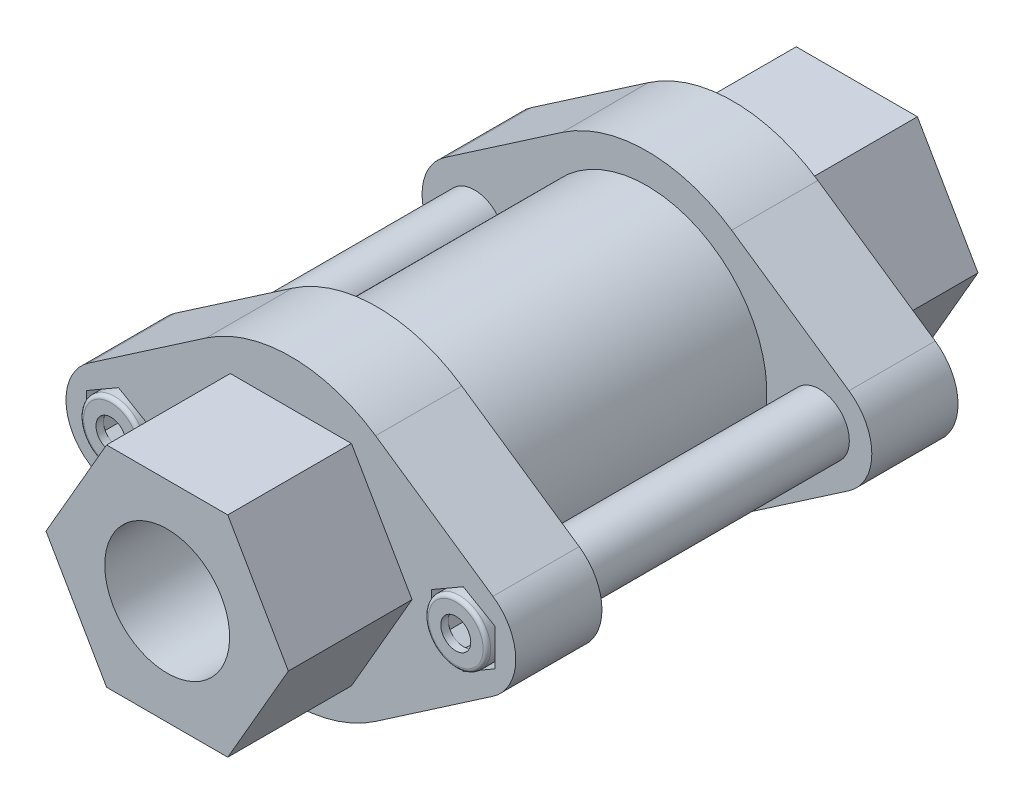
ISO-10303-21;
HEADER;
FILE_DESCRIPTION(('STEP AP214'),'2;1');
FILE_NAME('part.step','',(''),(''),'','','');
FILE_SCHEMA(('AUTOMOTIVE_DESIGN { 1 0 10303 214 1 1 1 1 }'));
ENDSEC;
DATA;
#1=APPLICATION_CONTEXT('core data for automotive mechanical design processes');
#2=APPLICATION_PROTOCOL_DEFINITION('international standard','automotive_design',2000,#1);
#3=PRODUCT_CONTEXT('',#1,'mechanical');
#4=PRODUCT('Part','Part','',(#3));
#5=PRODUCT_RELATED_PRODUCT_CATEGORY('part','',(#4));
#6=PRODUCT_DEFINITION_FORMATION('','',#4);
#7=PRODUCT_DEFINITION_CONTEXT('part definition',#1,'design');
#8=PRODUCT_DEFINITION('design','',#6,#7);
#9=PRODUCT_DEFINITION_SHAPE('','',#8);
#10=(LENGTH_UNIT() NAMED_UNIT(*) SI_UNIT(.MILLI.,.METRE.));
#11=(NAMED_UNIT(*) PLANE_ANGLE_UNIT() SI_UNIT($,.RADIAN.));
#12=(NAMED_UNIT(*) SI_UNIT($,.STERADIAN.) SOLID_ANGLE_UNIT());
#13=UNCERTAINTY_MEASURE_WITH_UNIT(LENGTH_MEASURE(1.E-05),#10,'distance_accuracy_value','');
#14=(GEOMETRIC_REPRESENTATION_CONTEXT(3) GLOBAL_UNCERTAINTY_ASSIGNED_CONTEXT((#13)) GLOBAL_UNIT_ASSIGNED_CONTEXT((#10,
#11,#12)) REPRESENTATION_CONTEXT('',''));
#15=CARTESIAN_POINT('',(0.,0.,0.));
#16=DIRECTION('',(0.,0.,1.));
#17=DIRECTION('',(1.,0.,0.));
#18=AXIS2_PLACEMENT_3D('',#15,#16,#17);
#19=CARTESIAN_POINT('',(23.,0.,16.5));
#20=DIRECTION('',(0.,0.,1.));
#21=DIRECTION('',(0.,1.,0.));
#22=AXIS2_PLACEMENT_3D('',#19,#20,#21);
#23=PLANE('',#22);
#24=DIRECTION('',(0.,1.,0.));
#25=VECTOR('',#24,1.);
#26=CARTESIAN_POINT('',(-18.75,-2.45373864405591,16.5));
#27=LINE('',#26,#25);
#28=CARTESIAN_POINT('',(-18.75,-2.45373864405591,16.5));
#29=VERTEX_POINT('',#28);
#30=CARTESIAN_POINT('',(-18.75,2.45373864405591,16.5));
#31=VERTEX_POINT('',#30);
#32=EDGE_CURVE('E726',#29,#31,#27,.T.);
#33=ORIENTED_EDGE('',*,*,#32,.T.);
#34=DIRECTION('',(-0.866025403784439,0.5,0.));
#35=VECTOR('',#34,1.);
#36=CARTESIAN_POINT('',(-18.75,2.45373864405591,16.5));
#37=LINE('',#36,#35);
#38=CARTESIAN_POINT('',(-23.,4.90747728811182,16.5));
#39=VERTEX_POINT('',#38);
#40=EDGE_CURVE('E744',#31,#39,#37,.T.);
#41=ORIENTED_EDGE('',*,*,#40,.T.);
#42=DIRECTION('',(-0.866025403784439,-0.5,0.));
#43=VECTOR('',#42,1.);
#44=CARTESIAN_POINT('',(-23.,4.90747728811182,16.5));
#45=LINE('',#44,#43);
#46=CARTESIAN_POINT('',(-27.25,2.45373864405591,16.5));
#47=VERTEX_POINT('',#46);
#48=EDGE_CURVE('E747',#39,#47,#45,.T.);
#49=ORIENTED_EDGE('',*,*,#48,.T.);
#50=DIRECTION('',(0.,-1.,0.));
#51=VECTOR('',#50,1.);
#52=CARTESIAN_POINT('',(-27.25,2.45373864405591,16.5));
#53=LINE('',#52,#51);
#54=CARTESIAN_POINT('',(-27.25,-2.45373864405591,16.5));
#55=VERTEX_POINT('',#54);
#56=EDGE_CURVE('E750',#47,#55,#53,.T.);
#57=ORIENTED_EDGE('',*,*,#56,.T.);
#58=DIRECTION('',(0.866025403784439,-0.5,0.));
#59=VECTOR('',#58,1.);
#60=CARTESIAN_POINT('',(-27.25,-2.45373864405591,16.5));
#61=LINE('',#60,#59);
#62=CARTESIAN_POINT('',(-23.,-4.90747728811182,16.5));
#63=VERTEX_POINT('',#62);
#64=EDGE_CURVE('E753',#55,#63,#61,.T.);
#65=ORIENTED_EDGE('',*,*,#64,.T.);
#66=DIRECTION('',(0.866025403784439,0.5,0.));
#67=VECTOR('',#66,1.);
#68=CARTESIAN_POINT('',(-23.,-4.90747728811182,16.5));
#69=LINE('',#68,#67);
#70=EDGE_CURVE('E731',#63,#29,#69,.T.);
#71=ORIENTED_EDGE('',*,*,#70,.T.);
#72=EDGE_LOOP('',(#33,#41,#49,#57,#65,#71));
#73=FACE_BOUND('',#72,.T.);
#74=DIRECTION('',(0.824941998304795,0.565217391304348,0.));
#75=VECTOR('',#74,1.);
#76=CARTESIAN_POINT('',(11.304347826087,-16.4988399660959,16.5));
#77=LINE('',#76,#75);
#78=CARTESIAN_POINT('',(11.304347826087,-16.4988399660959,16.5));
#79=VERTEX_POINT('',#78);
#80=CARTESIAN_POINT('',(26.9565217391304,-5.77459398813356,16.5));
#81=VERTEX_POINT('',#80);
#82=EDGE_CURVE('E979',#79,#81,#77,.T.);
#83=ORIENTED_EDGE('',*,*,#82,.F.);
#84=CARTESIAN_POINT('',(0.,0.,16.5));
#85=DIRECTION('',(0.,0.,1.));
#86=DIRECTION('',(-1.,0.,0.));
#87=AXIS2_PLACEMENT_3D('',#84,#85,#86);
#88=CIRCLE('',#87,20.);
#89=CARTESIAN_POINT('',(-11.304347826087,-16.4988399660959,16.5));
#90=VERTEX_POINT('',#89);
#91=EDGE_CURVE('E984',#90,#79,#88,.T.);
#92=ORIENTED_EDGE('',*,*,#91,.F.);
#93=DIRECTION('',(0.824941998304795,-0.565217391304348,0.));
#94=VECTOR('',#93,1.);
#95=CARTESIAN_POINT('',(-26.9565217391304,-5.77459398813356,16.5));
#96=LINE('',#95,#94);
#97=CARTESIAN_POINT('',(-26.9565217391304,-5.77459398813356,16.5));
#98=VERTEX_POINT('',#97);
#99=EDGE_CURVE('E1016',#98,#90,#96,.T.);
#100=ORIENTED_EDGE('',*,*,#99,.F.);
#101=CARTESIAN_POINT('',(-23.,0.,16.5));
#102=DIRECTION('',(0.,0.,1.));
#103=DIRECTION('',(-1.,0.,0.));
#104=AXIS2_PLACEMENT_3D('',#101,#102,#103);
#105=CIRCLE('',#104,7.);
#106=CARTESIAN_POINT('',(-26.9565217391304,5.77459398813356,16.5));
#107=VERTEX_POINT('',#106);
#108=EDGE_CURVE('E1013',#107,#98,#105,.T.);
#109=ORIENTED_EDGE('',*,*,#108,.F.);
#110=DIRECTION('',(-0.824941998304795,-0.565217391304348,0.));
#111=VECTOR('',#110,1.);
#112=CARTESIAN_POINT('',(-11.304347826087,16.4988399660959,16.5));
#113=LINE('',#112,#111);
#114=CARTESIAN_POINT('',(-11.304347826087,16.4988399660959,16.5));
#115=VERTEX_POINT('',#114);
#116=EDGE_CURVE('E1010',#115,#107,#113,.T.);
#117=ORIENTED_EDGE('',*,*,#116,.F.);
#118=CARTESIAN_POINT('',(0.,0.,16.5));
#119=DIRECTION('',(0.,0.,1.));
#120=DIRECTION('',(-1.,0.,0.));
#121=AXIS2_PLACEMENT_3D('',#118,#119,#120);
#122=CIRCLE('',#121,20.);
#123=CARTESIAN_POINT('',(11.304347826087,16.4988399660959,16.5));
#124=VERTEX_POINT('',#123);
#125=EDGE_CURVE('E1007',#124,#115,#122,.T.);
#126=ORIENTED_EDGE('',*,*,#125,.F.);
#127=DIRECTION('',(-0.824941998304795,0.565217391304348,0.));
#128=VECTOR('',#127,1.);
#129=CARTESIAN_POINT('',(26.9565217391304,5.77459398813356,16.5));
#130=LINE('',#129,#128);
#131=CARTESIAN_POINT('',(26.9565217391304,5.77459398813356,16.5));
#132=VERTEX_POINT('',#131);
#133=EDGE_CURVE('E1004',#132,#124,#130,.T.);
#134=ORIENTED_EDGE('',*,*,#133,.F.);
#135=CARTESIAN_POINT('',(23.,0.,16.5));
#136=DIRECTION('',(0.,0.,1.));
#137=DIRECTION('',(-1.,0.,0.));
#138=AXIS2_PLACEMENT_3D('',#135,#136,#137);
#139=CIRCLE('',#138,7.);
#140=EDGE_CURVE('E1001',#81,#132,#139,.T.);
#141=ORIENTED_EDGE('',*,*,#140,.F.);
#142=EDGE_LOOP('',(#83,#92,#100,#109,#117,#126,#134,#141));
#143=FACE_BOUND('',#142,.T.);
#144=DIRECTION('',(-0.5,-0.866025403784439,0.));
#145=VECTOR('',#144,1.);
#146=CARTESIAN_POINT('',(17.8743556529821,2.95929214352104,16.5));
#147=LINE('',#146,#145);
#148=CARTESIAN_POINT('',(16.1658075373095,0.,16.5));
#149=VERTEX_POINT('',#148);
#150=CARTESIAN_POINT('',(8.08290376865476,-14.,16.5));
#151=VERTEX_POINT('',#150);
#152=EDGE_CURVE('E1067',#149,#151,#147,.T.);
#153=ORIENTED_EDGE('',*,*,#152,.F.);
#154=DIRECTION('',(0.5,-0.866025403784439,0.));
#155=VECTOR('',#154,1.);
#156=CARTESIAN_POINT('',(17.8743556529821,-2.95929214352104,16.5));
#157=LINE('',#156,#155);
#158=CARTESIAN_POINT('',(8.08290376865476,14.,16.5));
#159=VERTEX_POINT('',#158);
#160=EDGE_CURVE('E1064',#159,#149,#157,.T.);
#161=ORIENTED_EDGE('',*,*,#160,.F.);
#162=DIRECTION('',(1.,0.,0.));
#163=VECTOR('',#162,1.);
#164=CARTESIAN_POINT('',(23.,14.,16.5));
#165=LINE('',#164,#163);
#166=CARTESIAN_POINT('',(-8.08290376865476,14.,16.5));
#167=VERTEX_POINT('',#166);
#168=EDGE_CURVE('E1061',#167,#159,#165,.T.);
#169=ORIENTED_EDGE('',*,*,#168,.F.);
#170=DIRECTION('',(0.5,0.866025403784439,0.));
#171=VECTOR('',#170,1.);
#172=CARTESIAN_POINT('',(-6.37435565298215,16.9592921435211,16.5));
#173=LINE('',#172,#171);
#174=CARTESIAN_POINT('',(-16.1658075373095,0.,16.5));
#175=VERTEX_POINT('',#174);
#176=EDGE_CURVE('E1058',#175,#167,#173,.T.);
#177=ORIENTED_EDGE('',*,*,#176,.F.);
#178=DIRECTION('',(-0.5,0.866025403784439,0.));
#179=VECTOR('',#178,1.);
#180=CARTESIAN_POINT('',(-6.37435565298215,-16.9592921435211,16.5));
#181=LINE('',#180,#179);
#182=CARTESIAN_POINT('',(-8.08290376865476,-14.,16.5));
#183=VERTEX_POINT('',#182);
#184=EDGE_CURVE('E1055',#183,#175,#181,.T.);
#185=ORIENTED_EDGE('',*,*,#184,.F.);
#186=DIRECTION('',(-1.,0.,0.));
#187=VECTOR('',#186,1.);
#188=CARTESIAN_POINT('',(23.,-14.,16.5));
#189=LINE('',#188,#187);
#190=EDGE_CURVE('E1052',#151,#183,#189,.T.);
#191=ORIENTED_EDGE('',*,*,#190,.F.);
#192=EDGE_LOOP('',(#153,#161,#169,#177,#185,#191));
#193=FACE_BOUND('',#192,.T.);
#194=DIRECTION('',(0.,1.,0.));
#195=VECTOR('',#194,1.);
#196=CARTESIAN_POINT('',(27.25,-2.45373864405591,16.5));
#197=LINE('',#196,#195);
#198=CARTESIAN_POINT('',(27.25,-2.45373864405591,16.5));
#199=VERTEX_POINT('',#198);
#200=CARTESIAN_POINT('',(27.25,2.45373864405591,16.5));
#201=VERTEX_POINT('',#200);
#202=EDGE_CURVE('E677',#199,#201,#197,.T.);
#203=ORIENTED_EDGE('',*,*,#202,.T.);
#204=DIRECTION('',(-0.866025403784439,0.5,0.));
#205=VECTOR('',#204,1.);
#206=CARTESIAN_POINT('',(27.25,2.45373864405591,16.5));
#207=LINE('',#206,#205);
#208=CARTESIAN_POINT('',(23.,4.90747728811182,16.5));
#209=VERTEX_POINT('',#208);
#210=EDGE_CURVE('E699',#201,#209,#207,.T.);
#211=ORIENTED_EDGE('',*,*,#210,.T.);
#212=DIRECTION('',(-0.866025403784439,-0.5,0.));
#213=VECTOR('',#212,1.);
#214=CARTESIAN_POINT('',(23.,4.90747728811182,16.5));
#215=LINE('',#214,#213);
#216=CARTESIAN_POINT('',(18.75,2.45373864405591,16.5));
#217=VERTEX_POINT('',#216);
#218=EDGE_CURVE('E702',#209,#217,#215,.T.);
#219=ORIENTED_EDGE('',*,*,#218,.T.);
#220=DIRECTION('',(0.,-1.,0.));
#221=VECTOR('',#220,1.);
#222=CARTESIAN_POINT('',(18.75,2.45373864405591,16.5));
#223=LINE('',#222,#221);
#224=CARTESIAN_POINT('',(18.75,-2.45373864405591,16.5));
#225=VERTEX_POINT('',#224);
#226=EDGE_CURVE('E705',#217,#225,#223,.T.);
#227=ORIENTED_EDGE('',*,*,#226,.T.);
#228=DIRECTION('',(0.866025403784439,-0.5,0.));
#229=VECTOR('',#228,1.);
#230=CARTESIAN_POINT('',(18.75,-2.45373864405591,16.5));
#231=LINE('',#230,#229);
#232=CARTESIAN_POINT('',(23.,-4.90747728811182,16.5));
#233=VERTEX_POINT('',#232);
#234=EDGE_CURVE('E708',#225,#233,#231,.T.);
#235=ORIENTED_EDGE('',*,*,#234,.T.);
#236=DIRECTION('',(0.866025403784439,0.5,0.));
#237=VECTOR('',#236,1.);
#238=CARTESIAN_POINT('',(23.,-4.90747728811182,16.5));
#239=LINE('',#238,#237);
#240=EDGE_CURVE('E686',#233,#199,#239,.T.);
#241=ORIENTED_EDGE('',*,*,#240,.T.);
#242=EDGE_LOOP('',(#203,#211,#219,#227,#235,#241));
#243=FACE_BOUND('',#242,.T.);
#244=ADVANCED_FACE('F14',(#73,#143,#193,#243),#23,.F.);
#245=CARTESIAN_POINT('',(23.,0.,75.5));
#246=DIRECTION('',(0.,0.,1.));
#247=DIRECTION('',(0.,1.,0.));
#248=AXIS2_PLACEMENT_3D('',#245,#246,#247);
#249=PLANE('',#248);
#250=DIRECTION('',(0.,1.,0.));
#251=VECTOR('',#250,1.);
#252=CARTESIAN_POINT('',(27.25,-2.45373864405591,75.5));
#253=LINE('',#252,#251);
#254=CARTESIAN_POINT('',(27.25,-2.45373864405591,75.5));
#255=VERTEX_POINT('',#254);
#256=CARTESIAN_POINT('',(27.25,2.45373864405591,75.5));
#257=VERTEX_POINT('',#256);
#258=EDGE_CURVE('E771',#255,#257,#253,.T.);
#259=ORIENTED_EDGE('',*,*,#258,.F.);
#260=DIRECTION('',(0.866025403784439,0.5,0.));
#261=VECTOR('',#260,1.);
#262=CARTESIAN_POINT('',(23.,-4.90747728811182,75.5));
#263=LINE('',#262,#261);
#264=CARTESIAN_POINT('',(23.,-4.90747728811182,75.5));
#265=VERTEX_POINT('',#264);
#266=EDGE_CURVE('E776',#265,#255,#263,.T.);
#267=ORIENTED_EDGE('',*,*,#266,.F.);
#268=DIRECTION('',(0.866025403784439,-0.5,0.));
#269=VECTOR('',#268,1.);
#270=CARTESIAN_POINT('',(18.75,-2.45373864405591,75.5));
#271=LINE('',#270,#269);
#272=CARTESIAN_POINT('',(18.75,-2.45373864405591,75.5));
#273=VERTEX_POINT('',#272);
#274=EDGE_CURVE('E803',#273,#265,#271,.T.);
#275=ORIENTED_EDGE('',*,*,#274,.F.);
#276=DIRECTION('',(0.,-1.,0.));
#277=VECTOR('',#276,1.);
#278=CARTESIAN_POINT('',(18.75,2.45373864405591,75.5));
#279=LINE('',#278,#277);
#280=CARTESIAN_POINT('',(18.75,2.45373864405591,75.5));
#281=VERTEX_POINT('',#280);
#282=EDGE_CURVE('E800',#281,#273,#279,.T.);
#283=ORIENTED_EDGE('',*,*,#282,.F.);
#284=DIRECTION('',(-0.866025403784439,-0.5,0.));
#285=VECTOR('',#284,1.);
#286=CARTESIAN_POINT('',(23.,4.90747728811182,75.5));
#287=LINE('',#286,#285);
#288=CARTESIAN_POINT('',(23.,4.90747728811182,75.5));
#289=VERTEX_POINT('',#288);
#290=EDGE_CURVE('E797',#289,#281,#287,.T.);
#291=ORIENTED_EDGE('',*,*,#290,.F.);
#292=DIRECTION('',(-0.866025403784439,0.5,0.));
#293=VECTOR('',#292,1.);
#294=CARTESIAN_POINT('',(27.25,2.45373864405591,75.5));
#295=LINE('',#294,#293);
#296=EDGE_CURVE('E794',#257,#289,#295,.T.);
#297=ORIENTED_EDGE('',*,*,#296,.F.);
#298=EDGE_LOOP('',(#259,#267,#275,#283,#291,#297));
#299=FACE_BOUND('',#298,.T.);
#300=DIRECTION('',(0.,1.,0.));
#301=VECTOR('',#300,1.);
#302=CARTESIAN_POINT('',(-18.75,-2.45373864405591,75.5));
#303=LINE('',#302,#301);
#304=CARTESIAN_POINT('',(-18.75,-2.45373864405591,75.5));
#305=VERTEX_POINT('',#304);
#306=CARTESIAN_POINT('',(-18.75,2.45373864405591,75.5));
#307=VERTEX_POINT('',#306);
#308=EDGE_CURVE('E819',#305,#307,#303,.T.);
#309=ORIENTED_EDGE('',*,*,#308,.F.);
#310=DIRECTION('',(0.866025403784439,0.5,0.));
#311=VECTOR('',#310,1.);
#312=CARTESIAN_POINT('',(-23.,-4.90747728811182,75.5));
#313=LINE('',#312,#311);
#314=CARTESIAN_POINT('',(-23.,-4.90747728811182,75.5));
#315=VERTEX_POINT('',#314);
#316=EDGE_CURVE('E824',#315,#305,#313,.T.);
#317=ORIENTED_EDGE('',*,*,#316,.F.);
#318=DIRECTION('',(0.866025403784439,-0.5,0.));
#319=VECTOR('',#318,1.);
#320=CARTESIAN_POINT('',(-27.25,-2.45373864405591,75.5));
#321=LINE('',#320,#319);
#322=CARTESIAN_POINT('',(-27.25,-2.45373864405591,75.5));
#323=VERTEX_POINT('',#322);
#324=EDGE_CURVE('E851',#323,#315,#321,.T.);
#325=ORIENTED_EDGE('',*,*,#324,.F.);
#326=DIRECTION('',(0.,-1.,0.));
#327=VECTOR('',#326,1.);
#328=CARTESIAN_POINT('',(-27.25,2.45373864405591,75.5));
#329=LINE('',#328,#327);
#330=CARTESIAN_POINT('',(-27.25,2.45373864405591,75.5));
#331=VERTEX_POINT('',#330);
#332=EDGE_CURVE('E848',#331,#323,#329,.T.);
#333=ORIENTED_EDGE('',*,*,#332,.F.);
#334=DIRECTION('',(-0.866025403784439,-0.5,0.));
#335=VECTOR('',#334,1.);
#336=CARTESIAN_POINT('',(-23.,4.90747728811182,75.5));
#337=LINE('',#336,#335);
#338=CARTESIAN_POINT('',(-23.,4.90747728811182,75.5));
#339=VERTEX_POINT('',#338);
#340=EDGE_CURVE('E845',#339,#331,#337,.T.);
#341=ORIENTED_EDGE('',*,*,#340,.F.);
#342=DIRECTION('',(-0.866025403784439,0.5,0.));
#343=VECTOR('',#342,1.);
#344=CARTESIAN_POINT('',(-18.75,2.45373864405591,75.5));
#345=LINE('',#344,#343);
#346=EDGE_CURVE('E842',#307,#339,#345,.T.);
#347=ORIENTED_EDGE('',*,*,#346,.F.);
#348=EDGE_LOOP('',(#309,#317,#325,#333,#341,#347));
#349=FACE_BOUND('',#348,.T.);
#350=DIRECTION('',(0.824941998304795,0.565217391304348,0.));
#351=VECTOR('',#350,1.);
#352=CARTESIAN_POINT('',(11.304347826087,-16.4988399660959,75.5));
#353=LINE('',#352,#351);
#354=CARTESIAN_POINT('',(11.304347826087,-16.4988399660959,75.5));
#355=VERTEX_POINT('',#354);
#356=CARTESIAN_POINT('',(26.9565217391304,-5.77459398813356,75.5));
#357=VERTEX_POINT('',#356);
#358=EDGE_CURVE('E980',#355,#357,#353,.T.);
#359=ORIENTED_EDGE('',*,*,#358,.T.);
#360=CARTESIAN_POINT('',(23.,0.,75.5));
#361=DIRECTION('',(0.,0.,1.));
#362=DIRECTION('',(-1.,0.,0.));
#363=AXIS2_PLACEMENT_3D('',#360,#361,#362);
#364=CIRCLE('',#363,7.);
#365=CARTESIAN_POINT('',(26.9565217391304,5.77459398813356,75.5));
#366=VERTEX_POINT('',#365);
#367=EDGE_CURVE('E983',#357,#366,#364,.T.);
#368=ORIENTED_EDGE('',*,*,#367,.T.);
#369=DIRECTION('',(-0.824941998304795,0.565217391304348,0.));
#370=VECTOR('',#369,1.);
#371=CARTESIAN_POINT('',(26.9565217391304,5.77459398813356,75.5));
#372=LINE('',#371,#370);
#373=CARTESIAN_POINT('',(11.304347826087,16.4988399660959,75.5));
#374=VERTEX_POINT('',#373);
#375=EDGE_CURVE('E986',#366,#374,#372,.T.);
#376=ORIENTED_EDGE('',*,*,#375,.T.);
#377=CARTESIAN_POINT('',(0.,0.,75.5));
#378=DIRECTION('',(0.,0.,1.));
#379=DIRECTION('',(-1.,0.,0.));
#380=AXIS2_PLACEMENT_3D('',#377,#378,#379);
#381=CIRCLE('',#380,20.);
#382=CARTESIAN_POINT('',(-11.304347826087,16.4988399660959,75.5));
#383=VERTEX_POINT('',#382);
#384=EDGE_CURVE('E988',#374,#383,#381,.T.);
#385=ORIENTED_EDGE('',*,*,#384,.T.);
#386=DIRECTION('',(-0.824941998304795,-0.565217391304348,0.));
#387=VECTOR('',#386,1.);
#388=CARTESIAN_POINT('',(-11.304347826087,16.4988399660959,75.5));
#389=LINE('',#388,#387);
#390=CARTESIAN_POINT('',(-26.9565217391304,5.77459398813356,75.5));
#391=VERTEX_POINT('',#390);
#392=EDGE_CURVE('E990',#383,#391,#389,.T.);
#393=ORIENTED_EDGE('',*,*,#392,.T.);
#394=CARTESIAN_POINT('',(-23.,0.,75.5));
#395=DIRECTION('',(0.,0.,1.));
#396=DIRECTION('',(-1.,0.,0.));
#397=AXIS2_PLACEMENT_3D('',#394,#395,#396);
#398=CIRCLE('',#397,7.);
#399=CARTESIAN_POINT('',(-26.9565217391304,-5.77459398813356,75.5));
#400=VERTEX_POINT('',#399);
#401=EDGE_CURVE('E992',#391,#400,#398,.T.);
#402=ORIENTED_EDGE('',*,*,#401,.T.);
#403=DIRECTION('',(0.824941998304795,-0.565217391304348,0.));
#404=VECTOR('',#403,1.);
#405=CARTESIAN_POINT('',(-26.9565217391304,-5.77459398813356,75.5));
#406=LINE('',#405,#404);
#407=CARTESIAN_POINT('',(-11.304347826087,-16.4988399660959,75.5));
#408=VERTEX_POINT('',#407);
#409=EDGE_CURVE('E994',#400,#408,#406,.T.);
#410=ORIENTED_EDGE('',*,*,#409,.T.);
#411=CARTESIAN_POINT('',(0.,0.,75.5));
#412=DIRECTION('',(0.,0.,1.));
#413=DIRECTION('',(-1.,0.,0.));
#414=AXIS2_PLACEMENT_3D('',#411,#412,#413);
#415=CIRCLE('',#414,20.);
#416=EDGE_CURVE('E996',#408,#355,#415,.T.);
#417=ORIENTED_EDGE('',*,*,#416,.T.);
#418=EDGE_LOOP('',(#359,#368,#376,#385,#393,#402,#410,#417));
#419=FACE_BOUND('',#418,.T.);
#420=DIRECTION('',(0.5,-0.866025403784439,0.));
#421=VECTOR('',#420,1.);
#422=CARTESIAN_POINT('',(17.8743556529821,-2.95929214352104,75.5));
#423=LINE('',#422,#421);
#424=CARTESIAN_POINT('',(8.08290376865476,14.,75.5));
#425=VERTEX_POINT('',#424);
#426=CARTESIAN_POINT('',(16.1658075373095,0.,75.5));
#427=VERTEX_POINT('',#426);
#428=EDGE_CURVE('E973',#425,#427,#423,.T.);
#429=ORIENTED_EDGE('',*,*,#428,.T.);
#430=DIRECTION('',(-0.5,-0.866025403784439,0.));
#431=VECTOR('',#430,1.);
#432=CARTESIAN_POINT('',(17.8743556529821,2.95929214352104,75.5));
#433=LINE('',#432,#431);
#434=CARTESIAN_POINT('',(8.08290376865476,-14.,75.5));
#435=VERTEX_POINT('',#434);
#436=EDGE_CURVE('E976',#427,#435,#433,.T.);
#437=ORIENTED_EDGE('',*,*,#436,.T.);
#438=DIRECTION('',(-1.,0.,0.));
#439=VECTOR('',#438,1.);
#440=CARTESIAN_POINT('',(23.,-14.,75.5));
#441=LINE('',#440,#439);
#442=CARTESIAN_POINT('',(-8.08290376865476,-14.,75.5));
#443=VERTEX_POINT('',#442);
#444=EDGE_CURVE('E961',#435,#443,#441,.T.);
#445=ORIENTED_EDGE('',*,*,#444,.T.);
#446=DIRECTION('',(-0.5,0.866025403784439,0.));
#447=VECTOR('',#446,1.);
#448=CARTESIAN_POINT('',(-6.37435565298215,-16.9592921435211,75.5));
#449=LINE('',#448,#447);
#450=CARTESIAN_POINT('',(-16.1658075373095,0.,75.5));
#451=VERTEX_POINT('',#450);
#452=EDGE_CURVE('E964',#443,#451,#449,.T.);
#453=ORIENTED_EDGE('',*,*,#452,.T.);
#454=DIRECTION('',(0.5,0.866025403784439,0.));
#455=VECTOR('',#454,1.);
#456=CARTESIAN_POINT('',(-6.37435565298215,16.9592921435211,75.5));
#457=LINE('',#456,#455);
#458=CARTESIAN_POINT('',(-8.08290376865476,14.,75.5));
#459=VERTEX_POINT('',#458);
#460=EDGE_CURVE('E967',#451,#459,#457,.T.);
#461=ORIENTED_EDGE('',*,*,#460,.T.);
#462=DIRECTION('',(1.,0.,0.));
#463=VECTOR('',#462,1.);
#464=CARTESIAN_POINT('',(23.,14.,75.5));
#465=LINE('',#464,#463);
#466=EDGE_CURVE('E970',#459,#425,#465,.T.);
#467=ORIENTED_EDGE('',*,*,#466,.T.);
#468=EDGE_LOOP('',(#429,#437,#445,#453,#461,#467));
#469=FACE_BOUND('',#468,.T.);
#470=ADVANCED_FACE('F1153',(#299,#349,#419,#469),#249,.T.);
#471=CARTESIAN_POINT('',(11.304347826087,-16.4988399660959,75.5));
#472=DIRECTION('',(-0.565217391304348,0.824941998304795,0.));
#473=DIRECTION('',(-0.824941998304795,-0.565217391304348,0.));
#474=AXIS2_PLACEMENT_3D('',#471,#472,#473);
#475=PLANE('',#474);
#476=DIRECTION('',(0.,0.,-1.));
#477=VECTOR('',#476,1.);
#478=CARTESIAN_POINT('',(11.304347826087,-16.4988399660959,75.5));
#479=LINE('',#478,#477);
#480=CARTESIAN_POINT('',(11.304347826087,-16.4988399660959,64.));
#481=VERTEX_POINT('',#480);
#482=EDGE_CURVE('E1021',#355,#481,#479,.T.);
#483=ORIENTED_EDGE('',*,*,#482,.T.);
#484=DIRECTION('',(0.824941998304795,0.565217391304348,0.));
#485=VECTOR('',#484,1.);
#486=CARTESIAN_POINT('',(11.304347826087,-16.4988399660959,64.));
#487=LINE('',#486,#485);
#488=CARTESIAN_POINT('',(26.9565217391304,-5.77459398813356,64.));
#489=VERTEX_POINT('',#488);
#490=EDGE_CURVE('E892',#481,#489,#487,.T.);
#491=ORIENTED_EDGE('',*,*,#490,.T.);
#492=DIRECTION('',(0.,0.,-1.));
#493=VECTOR('',#492,1.);
#494=CARTESIAN_POINT('',(26.9565217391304,-5.77459398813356,75.5));
#495=LINE('',#494,#493);
#496=EDGE_CURVE('E1049',#357,#489,#495,.T.);
#497=ORIENTED_EDGE('',*,*,#496,.F.);
#498=ORIENTED_EDGE('',*,*,#358,.F.);
#499=EDGE_LOOP('',(#483,#491,#497,#498));
#500=FACE_BOUND('',#499,.T.);
#501=ADVANCED_FACE('F16',(#500),#475,.F.);
#502=CARTESIAN_POINT('',(23.,0.,75.5));
#503=DIRECTION('',(0.,0.,-1.));
#504=DIRECTION('',(0.,-1.,0.));
#505=AXIS2_PLACEMENT_3D('',#502,#503,#504);
#506=CYLINDRICAL_SURFACE('',#505,7.);
#507=ORIENTED_EDGE('',*,*,#496,.T.);
#508=CARTESIAN_POINT('',(23.,0.,64.));
#509=DIRECTION('',(0.,0.,1.));
#510=DIRECTION('',(0.,1.,0.));
#511=AXIS2_PLACEMENT_3D('',#508,#509,#510);
#512=CIRCLE('',#511,7.);
#513=CARTESIAN_POINT('',(26.9565217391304,5.77459398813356,64.));
#514=VERTEX_POINT('',#513);
#515=EDGE_CURVE('E900',#489,#514,#512,.T.);
#516=ORIENTED_EDGE('',*,*,#515,.T.);
#517=DIRECTION('',(0.,0.,-1.));
#518=VECTOR('',#517,1.);
#519=CARTESIAN_POINT('',(26.9565217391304,5.77459398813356,75.5));
#520=LINE('',#519,#518);
#521=EDGE_CURVE('E1045',#366,#514,#520,.T.);
#522=ORIENTED_EDGE('',*,*,#521,.F.);
#523=ORIENTED_EDGE('',*,*,#367,.F.);
#524=EDGE_LOOP('',(#507,#516,#522,#523));
#525=FACE_BOUND('',#524,.T.);
#526=ADVANCED_FACE('F1192',(#525),#506,.T.);
#527=CARTESIAN_POINT('',(26.9565217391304,5.77459398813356,75.5));
#528=DIRECTION('',(-0.565217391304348,-0.824941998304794,0.));
#529=DIRECTION('',(0.824941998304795,-0.565217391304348,0.));
#530=AXIS2_PLACEMENT_3D('',#527,#528,#529);
#531=PLANE('',#530);
#532=ORIENTED_EDGE('',*,*,#521,.T.);
#533=DIRECTION('',(-0.824941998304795,0.565217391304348,0.));
#534=VECTOR('',#533,1.);
#535=CARTESIAN_POINT('',(26.9565217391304,5.77459398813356,64.));
#536=LINE('',#535,#534);
#537=CARTESIAN_POINT('',(11.304347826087,16.4988399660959,64.));
#538=VERTEX_POINT('',#537);
#539=EDGE_CURVE('E903',#514,#538,#536,.T.);
#540=ORIENTED_EDGE('',*,*,#539,.T.);
#541=DIRECTION('',(0.,0.,-1.));
#542=VECTOR('',#541,1.);
#543=CARTESIAN_POINT('',(11.304347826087,16.4988399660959,75.5));
#544=LINE('',#543,#542);
#545=EDGE_CURVE('E1041',#374,#538,#544,.T.);
#546=ORIENTED_EDGE('',*,*,#545,.F.);
#547=ORIENTED_EDGE('',*,*,#375,.F.);
#548=EDGE_LOOP('',(#532,#540,#546,#547));
#549=FACE_BOUND('',#548,.T.);
#550=ADVANCED_FACE('F1188',(#549),#531,.F.);
#551=CARTESIAN_POINT('',(0.,0.,75.5));
#552=DIRECTION('',(0.,0.,-1.));
#553=DIRECTION('',(0.,-1.,0.));
#554=AXIS2_PLACEMENT_3D('',#551,#552,#553);
#555=CYLINDRICAL_SURFACE('',#554,20.);
#556=CARTESIAN_POINT('',(0.,0.,64.));
#557=DIRECTION('',(0.,0.,1.));
#558=DIRECTION('',(0.,1.,0.));
#559=AXIS2_PLACEMENT_3D('',#556,#557,#558);
#560=CIRCLE('',#559,20.);
#561=CARTESIAN_POINT('',(-11.304347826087,16.4988399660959,64.));
#562=VERTEX_POINT('',#561);
#563=EDGE_CURVE('E901',#538,#562,#560,.T.);
#564=ORIENTED_EDGE('',*,*,#563,.T.);
#565=DIRECTION('',(0.,0.,-1.));
#566=VECTOR('',#565,1.);
#567=CARTESIAN_POINT('',(-11.304347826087,16.4988399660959,75.5));
#568=LINE('',#567,#566);
#569=EDGE_CURVE('E1037',#383,#562,#568,.T.);
#570=ORIENTED_EDGE('',*,*,#569,.F.);
#571=ORIENTED_EDGE('',*,*,#384,.F.);
#572=ORIENTED_EDGE('',*,*,#545,.T.);
#573=EDGE_LOOP('',(#564,#570,#571,#572));
#574=FACE_BOUND('',#573,.T.);
#575=ADVANCED_FACE('F1183',(#574),#555,.T.);
#576=CARTESIAN_POINT('',(-11.304347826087,16.4988399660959,75.5));
#577=DIRECTION('',(0.565217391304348,-0.824941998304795,0.));
#578=DIRECTION('',(0.824941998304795,0.565217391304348,0.));
#579=AXIS2_PLACEMENT_3D('',#576,#577,#578);
#580=PLANE('',#579);
#581=ORIENTED_EDGE('',*,*,#569,.T.);
#582=DIRECTION('',(-0.824941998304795,-0.565217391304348,0.));
#583=VECTOR('',#582,1.);
#584=CARTESIAN_POINT('',(-11.304347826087,16.4988399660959,64.));
#585=LINE('',#584,#583);
#586=CARTESIAN_POINT('',(-26.9565217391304,5.77459398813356,64.));
#587=VERTEX_POINT('',#586);
#588=EDGE_CURVE('E895',#562,#587,#585,.T.);
#589=ORIENTED_EDGE('',*,*,#588,.T.);
#590=DIRECTION('',(0.,0.,-1.));
#591=VECTOR('',#590,1.);
#592=CARTESIAN_POINT('',(-26.9565217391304,5.77459398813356,75.5));
#593=LINE('',#592,#591);
#594=EDGE_CURVE('E1033',#391,#587,#593,.T.);
#595=ORIENTED_EDGE('',*,*,#594,.F.);
#596=ORIENTED_EDGE('',*,*,#392,.F.);
#597=EDGE_LOOP('',(#581,#589,#595,#596));
#598=FACE_BOUND('',#597,.T.);
#599=ADVANCED_FACE('F1178',(#598),#580,.F.);
#600=CARTESIAN_POINT('',(-23.,0.,75.5));
#601=DIRECTION('',(0.,0.,-1.));
#602=DIRECTION('',(0.,-1.,0.));
#603=AXIS2_PLACEMENT_3D('',#600,#601,#602);
#604=CYLINDRICAL_SURFACE('',#603,7.);
#605=CARTESIAN_POINT('',(-23.,0.,64.));
#606=DIRECTION('',(0.,0.,1.));
#607=DIRECTION('',(0.,1.,0.));
#608=AXIS2_PLACEMENT_3D('',#605,#606,#607);
#609=CIRCLE('',#608,7.);
#610=CARTESIAN_POINT('',(-26.9565217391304,-5.77459398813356,64.));
#611=VERTEX_POINT('',#610);
#612=EDGE_CURVE('E893',#587,#611,#609,.T.);
#613=ORIENTED_EDGE('',*,*,#612,.T.);
#614=DIRECTION('',(0.,0.,-1.));
#615=VECTOR('',#614,1.);
#616=CARTESIAN_POINT('',(-26.9565217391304,-5.77459398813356,75.5));
#617=LINE('',#616,#615);
#618=EDGE_CURVE('E1029',#400,#611,#617,.T.);
#619=ORIENTED_EDGE('',*,*,#618,.F.);
#620=ORIENTED_EDGE('',*,*,#401,.F.);
#621=ORIENTED_EDGE('',*,*,#594,.T.);
#622=EDGE_LOOP('',(#613,#619,#620,#621));
#623=FACE_BOUND('',#622,.T.);
#624=ADVANCED_FACE('F1173',(#623),#604,.T.);
#625=CARTESIAN_POINT('',(-26.9565217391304,-5.77459398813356,75.5));
#626=DIRECTION('',(0.565217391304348,0.824941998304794,0.));
#627=DIRECTION('',(-0.824941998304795,0.565217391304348,0.));
#628=AXIS2_PLACEMENT_3D('',#625,#626,#627);
#629=PLANE('',#628);
#630=ORIENTED_EDGE('',*,*,#618,.T.);
#631=DIRECTION('',(0.824941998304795,-0.565217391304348,0.));
#632=VECTOR('',#631,1.);
#633=CARTESIAN_POINT('',(-26.9565217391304,-5.77459398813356,64.));
#634=LINE('',#633,#632);
#635=CARTESIAN_POINT('',(-11.304347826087,-16.4988399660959,64.));
#636=VERTEX_POINT('',#635);
#637=EDGE_CURVE('E888',#611,#636,#634,.T.);
#638=ORIENTED_EDGE('',*,*,#637,.T.);
#639=DIRECTION('',(0.,0.,-1.));
#640=VECTOR('',#639,1.);
#641=CARTESIAN_POINT('',(-11.304347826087,-16.4988399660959,75.5));
#642=LINE('',#641,#640);
#643=EDGE_CURVE('E1025',#408,#636,#642,.T.);
#644=ORIENTED_EDGE('',*,*,#643,.F.);
#645=ORIENTED_EDGE('',*,*,#409,.F.);
#646=EDGE_LOOP('',(#630,#638,#644,#645));
#647=FACE_BOUND('',#646,.T.);
#648=ADVANCED_FACE('F1168',(#647),#629,.F.);
#649=CARTESIAN_POINT('',(0.,0.,75.5));
#650=DIRECTION('',(0.,0.,-1.));
#651=DIRECTION('',(0.,-1.,0.));
#652=AXIS2_PLACEMENT_3D('',#649,#650,#651);
#653=CYLINDRICAL_SURFACE('',#652,20.);
#654=ORIENTED_EDGE('',*,*,#643,.T.);
#655=CARTESIAN_POINT('',(0.,0.,64.));
#656=DIRECTION('',(0.,0.,1.));
#657=DIRECTION('',(0.,1.,0.));
#658=AXIS2_PLACEMENT_3D('',#655,#656,#657);
#659=CIRCLE('',#658,20.);
#660=EDGE_CURVE('E1072',#636,#481,#659,.T.);
#661=ORIENTED_EDGE('',*,*,#660,.T.);
#662=ORIENTED_EDGE('',*,*,#482,.F.);
#663=ORIENTED_EDGE('',*,*,#416,.F.);
#664=EDGE_LOOP('',(#654,#661,#662,#663));
#665=FACE_BOUND('',#664,.T.);
#666=ADVANCED_FACE('F1164',(#665),#653,.T.);
#667=CARTESIAN_POINT('',(8.08290376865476,-14.,92.));
#668=DIRECTION('',(-0.866025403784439,0.5,0.));
#669=DIRECTION('',(-0.5,-0.866025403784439,0.));
#670=AXIS2_PLACEMENT_3D('',#667,#668,#669);
#671=PLANE('',#670);
#672=ORIENTED_EDGE('',*,*,#436,.F.);
#673=DIRECTION('',(0.,0.,-1.));
#674=VECTOR('',#673,1.);
#675=CARTESIAN_POINT('',(16.1658075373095,0.,92.));
#676=LINE('',#675,#674);
#677=CARTESIAN_POINT('',(16.1658075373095,0.,92.));
#678=VERTEX_POINT('',#677);
#679=EDGE_CURVE('E958',#678,#427,#676,.T.);
#680=ORIENTED_EDGE('',*,*,#679,.F.);
#681=DIRECTION('',(0.5,0.866025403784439,0.));
#682=VECTOR('',#681,1.);
#683=CARTESIAN_POINT('',(8.08290376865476,-14.,92.));
#684=LINE('',#683,#682);
#685=CARTESIAN_POINT('',(8.08290376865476,-14.,92.));
#686=VERTEX_POINT('',#685);
#687=EDGE_CURVE('E908',#686,#678,#684,.T.);
#688=ORIENTED_EDGE('',*,*,#687,.F.);
#689=DIRECTION('',(0.,0.,-1.));
#690=VECTOR('',#689,1.);
#691=CARTESIAN_POINT('',(8.08290376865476,-14.,92.));
#692=LINE('',#691,#690);
#693=EDGE_CURVE('E939',#686,#435,#692,.T.);
#694=ORIENTED_EDGE('',*,*,#693,.T.);
#695=EDGE_LOOP('',(#672,#680,#688,#694));
#696=FACE_BOUND('',#695,.T.);
#697=ADVANCED_FACE('F1167',(#696),#671,.F.);
#698=CARTESIAN_POINT('',(16.1658075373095,0.,92.));
#699=DIRECTION('',(-0.866025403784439,-0.5,0.));
#700=DIRECTION('',(0.5,-0.866025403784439,0.));
#701=AXIS2_PLACEMENT_3D('',#698,#699,#700);
#702=PLANE('',#701);
#703=ORIENTED_EDGE('',*,*,#428,.F.);
#704=DIRECTION('',(0.,0.,-1.));
#705=VECTOR('',#704,1.);
#706=CARTESIAN_POINT('',(8.08290376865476,14.,92.));
#707=LINE('',#706,#705);
#708=CARTESIAN_POINT('',(8.08290376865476,14.,92.));
#709=VERTEX_POINT('',#708);
#710=EDGE_CURVE('E954',#709,#425,#707,.T.);
#711=ORIENTED_EDGE('',*,*,#710,.F.);
#712=DIRECTION('',(-0.5,0.866025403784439,0.));
#713=VECTOR('',#712,1.);
#714=CARTESIAN_POINT('',(16.1658075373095,0.,92.));
#715=LINE('',#714,#713);
#716=EDGE_CURVE('E911',#678,#709,#715,.T.);
#717=ORIENTED_EDGE('',*,*,#716,.F.);
#718=ORIENTED_EDGE('',*,*,#679,.T.);
#719=EDGE_LOOP('',(#703,#711,#717,#718));
#720=FACE_BOUND('',#719,.T.);
#721=ADVANCED_FACE('F1256',(#720),#702,.F.);
#722=CARTESIAN_POINT('',(8.08290376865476,14.,92.));
#723=DIRECTION('',(0.,-1.,0.));
#724=DIRECTION('',(1.,0.,0.));
#725=AXIS2_PLACEMENT_3D('',#722,#723,#724);
#726=PLANE('',#725);
#727=ORIENTED_EDGE('',*,*,#466,.F.);
#728=DIRECTION('',(0.,0.,-1.));
#729=VECTOR('',#728,1.);
#730=CARTESIAN_POINT('',(-8.08290376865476,14.,92.));
#731=LINE('',#730,#729);
#732=CARTESIAN_POINT('',(-8.08290376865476,14.,92.));
#733=VERTEX_POINT('',#732);
#734=EDGE_CURVE('E950',#733,#459,#731,.T.);
#735=ORIENTED_EDGE('',*,*,#734,.F.);
#736=DIRECTION('',(-1.,0.,0.));
#737=VECTOR('',#736,1.);
#738=CARTESIAN_POINT('',(8.08290376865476,14.,92.));
#739=LINE('',#738,#737);
#740=EDGE_CURVE('E914',#709,#733,#739,.T.);
#741=ORIENTED_EDGE('',*,*,#740,.F.);
#742=ORIENTED_EDGE('',*,*,#710,.T.);
#743=EDGE_LOOP('',(#727,#735,#741,#742));
#744=FACE_BOUND('',#743,.T.);
#745=ADVANCED_FACE('F1263',(#744),#726,.F.);
#746=CARTESIAN_POINT('',(-8.08290376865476,14.,92.));
#747=DIRECTION('',(0.866025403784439,-0.5,0.));
#748=DIRECTION('',(0.5,0.866025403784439,0.));
#749=AXIS2_PLACEMENT_3D('',#746,#747,#748);
#750=PLANE('',#749);
#751=ORIENTED_EDGE('',*,*,#460,.F.);
#752=DIRECTION('',(0.,0.,-1.));
#753=VECTOR('',#752,1.);
#754=CARTESIAN_POINT('',(-16.1658075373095,0.,92.));
#755=LINE('',#754,#753);
#756=CARTESIAN_POINT('',(-16.1658075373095,0.,92.));
#757=VERTEX_POINT('',#756);
#758=EDGE_CURVE('E946',#757,#451,#755,.T.);
#759=ORIENTED_EDGE('',*,*,#758,.F.);
#760=DIRECTION('',(-0.5,-0.866025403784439,0.));
#761=VECTOR('',#760,1.);
#762=CARTESIAN_POINT('',(-8.08290376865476,14.,92.));
#763=LINE('',#762,#761);
#764=EDGE_CURVE('E916',#733,#757,#763,.T.);
#765=ORIENTED_EDGE('',*,*,#764,.F.);
#766=ORIENTED_EDGE('',*,*,#734,.T.);
#767=EDGE_LOOP('',(#751,#759,#765,#766));
#768=FACE_BOUND('',#767,.T.);
#769=ADVANCED_FACE('F1275',(#768),#750,.F.);
#770=CARTESIAN_POINT('',(-16.1658075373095,0.,92.));
#771=DIRECTION('',(0.866025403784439,0.5,0.));
#772=DIRECTION('',(-0.5,0.866025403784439,0.));
#773=AXIS2_PLACEMENT_3D('',#770,#771,#772);
#774=PLANE('',#773);
#775=ORIENTED_EDGE('',*,*,#452,.F.);
#776=DIRECTION('',(0.,0.,-1.));
#777=VECTOR('',#776,1.);
#778=CARTESIAN_POINT('',(-8.08290376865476,-14.,92.));
#779=LINE('',#778,#777);
#780=CARTESIAN_POINT('',(-8.08290376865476,-14.,92.));
#781=VERTEX_POINT('',#780);
#782=EDGE_CURVE('E943',#781,#443,#779,.T.);
#783=ORIENTED_EDGE('',*,*,#782,.F.);
#784=DIRECTION('',(0.5,-0.866025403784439,0.));
#785=VECTOR('',#784,1.);
#786=CARTESIAN_POINT('',(-16.1658075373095,0.,92.));
#787=LINE('',#786,#785);
#788=EDGE_CURVE('E918',#757,#781,#787,.T.);
#789=ORIENTED_EDGE('',*,*,#788,.F.);
#790=ORIENTED_EDGE('',*,*,#758,.T.);
#791=EDGE_LOOP('',(#775,#783,#789,#790));
#792=FACE_BOUND('',#791,.T.);
#793=ADVANCED_FACE('F1286',(#792),#774,.F.);
#794=CARTESIAN_POINT('',(-8.08290376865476,-14.,92.));
#795=DIRECTION('',(0.,1.,0.));
#796=DIRECTION('',(-1.,0.,0.));
#797=AXIS2_PLACEMENT_3D('',#794,#795,#796);
#798=PLANE('',#797);
#799=ORIENTED_EDGE('',*,*,#444,.F.);
#800=ORIENTED_EDGE('',*,*,#693,.F.);
#801=DIRECTION('',(1.,0.,0.));
#802=VECTOR('',#801,1.);
#803=CARTESIAN_POINT('',(-8.08290376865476,-14.,92.));
#804=LINE('',#803,#802);
#805=EDGE_CURVE('E920',#781,#686,#804,.T.);
#806=ORIENTED_EDGE('',*,*,#805,.F.);
#807=ORIENTED_EDGE('',*,*,#782,.T.);
#808=EDGE_LOOP('',(#799,#800,#806,#807));
#809=FACE_BOUND('',#808,.T.);
#810=ADVANCED_FACE('F1283',(#809),#798,.F.);
#811=CARTESIAN_POINT('',(0.,0.,92.));
#812=DIRECTION('',(0.,0.,1.));
#813=DIRECTION('',(0.,1.,0.));
#814=AXIS2_PLACEMENT_3D('',#811,#812,#813);
#815=PLANE('',#814);
#816=CARTESIAN_POINT('',(0.,0.,92.));
#817=DIRECTION('',(0.,0.,1.));
#818=DIRECTION('',(0.,1.,0.));
#819=AXIS2_PLACEMENT_3D('',#816,#817,#818);
#820=CIRCLE('',#819,8.331);
#821=CARTESIAN_POINT('',(0.,8.331,92.));
#822=VERTEX_POINT('',#821);
#823=EDGE_CURVE('E2325',#822,#822,#820,.T.);
#824=ORIENTED_EDGE('',*,*,#823,.F.);
#825=EDGE_LOOP('',(#824));
#826=FACE_BOUND('',#825,.T.);
#827=ORIENTED_EDGE('',*,*,#687,.T.);
#828=ORIENTED_EDGE('',*,*,#716,.T.);
#829=ORIENTED_EDGE('',*,*,#740,.T.);
#830=ORIENTED_EDGE('',*,*,#764,.T.);
#831=ORIENTED_EDGE('',*,*,#788,.T.);
#832=ORIENTED_EDGE('',*,*,#805,.T.);
#833=EDGE_LOOP('',(#827,#828,#829,#830,#831,#832));
#834=FACE_BOUND('',#833,.T.);
#835=ADVANCED_FACE('F1279',(#826,#834),#815,.T.);
#836=CARTESIAN_POINT('',(0.,0.,64.));
#837=DIRECTION('',(0.,0.,1.));
#838=DIRECTION('',(0.,1.,0.));
#839=AXIS2_PLACEMENT_3D('',#836,#837,#838);
#840=PLANE('',#839);
#841=CARTESIAN_POINT('',(23.,0.,64.));
#842=DIRECTION('',(0.,0.,1.));
#843=DIRECTION('',(0.,1.,0.));
#844=AXIS2_PLACEMENT_3D('',#841,#842,#843);
#845=CIRCLE('',#844,4.);
#846=CARTESIAN_POINT('',(23.,4.,64.));
#847=VERTEX_POINT('',#846);
#848=EDGE_CURVE('E631',#847,#847,#845,.F.);
#849=ORIENTED_EDGE('',*,*,#848,.F.);
#850=EDGE_LOOP('',(#849));
#851=FACE_BOUND('',#850,.T.);
#852=CARTESIAN_POINT('',(-23.,0.,64.));
#853=DIRECTION('',(0.,0.,1.));
#854=DIRECTION('',(0.,1.,0.));
#855=AXIS2_PLACEMENT_3D('',#852,#853,#854);
#856=CIRCLE('',#855,4.);
#857=CARTESIAN_POINT('',(-23.,4.,64.));
#858=VERTEX_POINT('',#857);
#859=EDGE_CURVE('E678',#858,#858,#856,.F.);
#860=ORIENTED_EDGE('',*,*,#859,.F.);
#861=EDGE_LOOP('',(#860));
#862=FACE_BOUND('',#861,.T.);
#863=CARTESIAN_POINT('',(0.,0.,64.));
#864=DIRECTION('',(0.,0.,1.));
#865=DIRECTION('',(-1.,0.,0.));
#866=AXIS2_PLACEMENT_3D('',#863,#864,#865);
#867=CIRCLE('',#866,16.);
#868=CARTESIAN_POINT('',(-16.,0.,64.));
#869=VERTEX_POINT('',#868);
#870=EDGE_CURVE('E868',#869,#869,#867,.T.);
#871=ORIENTED_EDGE('',*,*,#870,.T.);
#872=EDGE_LOOP('',(#871));
#873=FACE_BOUND('',#872,.T.);
#874=ORIENTED_EDGE('',*,*,#515,.F.);
#875=ORIENTED_EDGE('',*,*,#490,.F.);
#876=ORIENTED_EDGE('',*,*,#660,.F.);
#877=ORIENTED_EDGE('',*,*,#637,.F.);
#878=ORIENTED_EDGE('',*,*,#612,.F.);
#879=ORIENTED_EDGE('',*,*,#588,.F.);
#880=ORIENTED_EDGE('',*,*,#563,.F.);
#881=ORIENTED_EDGE('',*,*,#539,.F.);
#882=EDGE_LOOP('',(#874,#875,#876,#877,#878,#879,#880,#881));
#883=FACE_BOUND('',#882,.T.);
#884=ADVANCED_FACE('F1358',(#851,#862,#873,#883),#840,.F.);
#885=CARTESIAN_POINT('',(0.,0.,28.));
#886=DIRECTION('',(0.,0.,1.));
#887=DIRECTION('',(0.,1.,0.));
#888=AXIS2_PLACEMENT_3D('',#885,#886,#887);
#889=PLANE('',#888);
#890=CARTESIAN_POINT('',(23.,0.,28.));
#891=DIRECTION('',(0.,0.,1.));
#892=DIRECTION('',(0.,1.,0.));
#893=AXIS2_PLACEMENT_3D('',#890,#891,#892);
#894=CIRCLE('',#893,4.);
#895=CARTESIAN_POINT('',(23.,4.,28.));
#896=VERTEX_POINT('',#895);
#897=EDGE_CURVE('E627',#896,#896,#894,.F.);
#898=ORIENTED_EDGE('',*,*,#897,.T.);
#899=EDGE_LOOP('',(#898));
#900=FACE_BOUND('',#899,.T.);
#901=CARTESIAN_POINT('',(-23.,0.,28.));
#902=DIRECTION('',(0.,0.,1.));
#903=DIRECTION('',(0.,1.,0.));
#904=AXIS2_PLACEMENT_3D('',#901,#902,#903);
#905=CIRCLE('',#904,4.);
#906=CARTESIAN_POINT('',(-23.,4.,28.));
#907=VERTEX_POINT('',#906);
#908=EDGE_CURVE('E674',#907,#907,#905,.F.);
#909=ORIENTED_EDGE('',*,*,#908,.T.);
#910=EDGE_LOOP('',(#909));
#911=FACE_BOUND('',#910,.T.);
#912=CARTESIAN_POINT('',(0.,0.,28.));
#913=DIRECTION('',(0.,0.,1.));
#914=DIRECTION('',(-1.,0.,0.));
#915=AXIS2_PLACEMENT_3D('',#912,#913,#914);
#916=CIRCLE('',#915,16.);
#917=CARTESIAN_POINT('',(-16.,0.,28.));
#918=VERTEX_POINT('',#917);
#919=EDGE_CURVE('E867',#918,#918,#916,.T.);
#920=ORIENTED_EDGE('',*,*,#919,.F.);
#921=EDGE_LOOP('',(#920));
#922=FACE_BOUND('',#921,.T.);
#923=CARTESIAN_POINT('',(23.,0.,28.));
#924=DIRECTION('',(0.,0.,1.));
#925=DIRECTION('',(0.,1.,0.));
#926=AXIS2_PLACEMENT_3D('',#923,#924,#925);
#927=CIRCLE('',#926,7.);
#928=CARTESIAN_POINT('',(26.9565217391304,-5.77459398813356,28.));
#929=VERTEX_POINT('',#928);
#930=CARTESIAN_POINT('',(26.9565217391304,5.77459398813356,28.));
#931=VERTEX_POINT('',#930);
#932=EDGE_CURVE('E886',#929,#931,#927,.T.);
#933=ORIENTED_EDGE('',*,*,#932,.T.);
#934=DIRECTION('',(-0.824941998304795,0.565217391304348,0.));
#935=VECTOR('',#934,1.);
#936=CARTESIAN_POINT('',(26.9565217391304,5.77459398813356,28.));
#937=LINE('',#936,#935);
#938=CARTESIAN_POINT('',(11.304347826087,16.4988399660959,28.));
#939=VERTEX_POINT('',#938);
#940=EDGE_CURVE('E885',#931,#939,#937,.T.);
#941=ORIENTED_EDGE('',*,*,#940,.T.);
#942=CARTESIAN_POINT('',(0.,0.,28.));
#943=DIRECTION('',(0.,0.,1.));
#944=DIRECTION('',(0.,1.,0.));
#945=AXIS2_PLACEMENT_3D('',#942,#943,#944);
#946=CIRCLE('',#945,20.);
#947=CARTESIAN_POINT('',(-11.304347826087,16.4988399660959,28.));
#948=VERTEX_POINT('',#947);
#949=EDGE_CURVE('E883',#939,#948,#946,.T.);
#950=ORIENTED_EDGE('',*,*,#949,.T.);
#951=DIRECTION('',(-0.824941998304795,-0.565217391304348,0.));
#952=VECTOR('',#951,1.);
#953=CARTESIAN_POINT('',(-11.304347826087,16.4988399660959,28.));
#954=LINE('',#953,#952);
#955=CARTESIAN_POINT('',(-26.9565217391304,5.77459398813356,28.));
#956=VERTEX_POINT('',#955);
#957=EDGE_CURVE('E879',#948,#956,#954,.T.);
#958=ORIENTED_EDGE('',*,*,#957,.T.);
#959=CARTESIAN_POINT('',(-23.,0.,28.));
#960=DIRECTION('',(0.,0.,1.));
#961=DIRECTION('',(0.,1.,0.));
#962=AXIS2_PLACEMENT_3D('',#959,#960,#961);
#963=CIRCLE('',#962,7.);
#964=CARTESIAN_POINT('',(-26.9565217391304,-5.77459398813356,28.));
#965=VERTEX_POINT('',#964);
#966=EDGE_CURVE('E877',#956,#965,#963,.T.);
#967=ORIENTED_EDGE('',*,*,#966,.T.);
#968=DIRECTION('',(0.824941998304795,-0.565217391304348,0.));
#969=VECTOR('',#968,1.);
#970=CARTESIAN_POINT('',(-26.9565217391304,-5.77459398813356,28.));
#971=LINE('',#970,#969);
#972=CARTESIAN_POINT('',(-11.304347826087,-16.4988399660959,28.));
#973=VERTEX_POINT('',#972);
#974=EDGE_CURVE('E871',#965,#973,#971,.T.);
#975=ORIENTED_EDGE('',*,*,#974,.T.);
#976=CARTESIAN_POINT('',(0.,0.,28.));
#977=DIRECTION('',(0.,0.,1.));
#978=DIRECTION('',(0.,1.,0.));
#979=AXIS2_PLACEMENT_3D('',#976,#977,#978);
#980=CIRCLE('',#979,20.);
#981=CARTESIAN_POINT('',(11.304347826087,-16.4988399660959,28.));
#982=VERTEX_POINT('',#981);
#983=EDGE_CURVE('E1070',#973,#982,#980,.T.);
#984=ORIENTED_EDGE('',*,*,#983,.T.);
#985=DIRECTION('',(0.824941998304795,0.565217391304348,0.));
#986=VECTOR('',#985,1.);
#987=CARTESIAN_POINT('',(11.304347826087,-16.4988399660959,28.));
#988=LINE('',#987,#986);
#989=EDGE_CURVE('E876',#982,#929,#988,.T.);
#990=ORIENTED_EDGE('',*,*,#989,.T.);
#991=EDGE_LOOP('',(#933,#941,#950,#958,#967,#975,#984,#990));
#992=FACE_BOUND('',#991,.T.);
#993=ADVANCED_FACE('F1218',(#900,#911,#922,#992),#889,.T.);
#994=CARTESIAN_POINT('',(0.,0.,64.));
#995=DIRECTION('',(0.,0.,-1.));
#996=DIRECTION('',(0.,-1.,0.));
#997=AXIS2_PLACEMENT_3D('',#994,#995,#996);
#998=CYLINDRICAL_SURFACE('',#997,16.);
#999=ORIENTED_EDGE('',*,*,#870,.F.);
#1000=EDGE_LOOP('',(#999));
#1001=FACE_BOUND('',#1000,.T.);
#1002=ORIENTED_EDGE('',*,*,#919,.T.);
#1003=EDGE_LOOP('',(#1002));
#1004=FACE_BOUND('',#1003,.T.);
#1005=ADVANCED_FACE('F1377',(#1001,#1004),#998,.T.);
#1006=CARTESIAN_POINT('',(0.,0.,0.));
#1007=DIRECTION('',(0.,0.,1.));
#1008=DIRECTION('',(0.,1.,0.));
#1009=AXIS2_PLACEMENT_3D('',#1006,#1007,#1008);
#1010=PLANE('',#1009);
#1011=CARTESIAN_POINT('',(0.,0.,0.));
#1012=DIRECTION('',(0.,0.,-1.));
#1013=DIRECTION('',(0.,-1.,0.));
#1014=AXIS2_PLACEMENT_3D('',#1011,#1012,#1013);
#1015=CIRCLE('',#1014,8.331);
#1016=CARTESIAN_POINT('',(0.,-8.331,0.));
#1017=VERTEX_POINT('',#1016);
#1018=EDGE_CURVE('E2326',#1017,#1017,#1015,.T.);
#1019=ORIENTED_EDGE('',*,*,#1018,.F.);
#1020=EDGE_LOOP('',(#1019));
#1021=FACE_BOUND('',#1020,.T.);
#1022=DIRECTION('',(0.5,0.866025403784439,0.));
#1023=VECTOR('',#1022,1.);
#1024=CARTESIAN_POINT('',(8.08290376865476,-14.,0.));
#1025=LINE('',#1024,#1023);
#1026=CARTESIAN_POINT('',(8.08290376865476,-14.,0.));
#1027=VERTEX_POINT('',#1026);
#1028=CARTESIAN_POINT('',(16.1658075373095,0.,0.));
#1029=VERTEX_POINT('',#1028);
#1030=EDGE_CURVE('E907',#1027,#1029,#1025,.T.);
#1031=ORIENTED_EDGE('',*,*,#1030,.F.);
#1032=DIRECTION('',(1.,0.,0.));
#1033=VECTOR('',#1032,1.);
#1034=CARTESIAN_POINT('',(-8.08290376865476,-14.,0.));
#1035=LINE('',#1034,#1033);
#1036=CARTESIAN_POINT('',(-8.08290376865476,-14.,0.));
#1037=VERTEX_POINT('',#1036);
#1038=EDGE_CURVE('E912',#1037,#1027,#1035,.T.);
#1039=ORIENTED_EDGE('',*,*,#1038,.F.);
#1040=DIRECTION('',(0.5,-0.866025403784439,0.));
#1041=VECTOR('',#1040,1.);
#1042=CARTESIAN_POINT('',(-16.1658075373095,0.,0.));
#1043=LINE('',#1042,#1041);
#1044=CARTESIAN_POINT('',(-16.1658075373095,0.,0.));
#1045=VERTEX_POINT('',#1044);
#1046=EDGE_CURVE('E934',#1045,#1037,#1043,.T.);
#1047=ORIENTED_EDGE('',*,*,#1046,.F.);
#1048=DIRECTION('',(-0.5,-0.866025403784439,0.));
#1049=VECTOR('',#1048,1.);
#1050=CARTESIAN_POINT('',(-8.08290376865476,14.,0.));
#1051=LINE('',#1050,#1049);
#1052=CARTESIAN_POINT('',(-8.08290376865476,14.,0.));
#1053=VERTEX_POINT('',#1052);
#1054=EDGE_CURVE('E931',#1053,#1045,#1051,.T.);
#1055=ORIENTED_EDGE('',*,*,#1054,.F.);
#1056=DIRECTION('',(-1.,0.,0.));
#1057=VECTOR('',#1056,1.);
#1058=CARTESIAN_POINT('',(8.08290376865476,14.,0.));
#1059=LINE('',#1058,#1057);
#1060=CARTESIAN_POINT('',(8.08290376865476,14.,0.));
#1061=VERTEX_POINT('',#1060);
#1062=EDGE_CURVE('E928',#1061,#1053,#1059,.T.);
#1063=ORIENTED_EDGE('',*,*,#1062,.F.);
#1064=DIRECTION('',(-0.5,0.866025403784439,0.));
#1065=VECTOR('',#1064,1.);
#1066=CARTESIAN_POINT('',(16.1658075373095,0.,0.));
#1067=LINE('',#1066,#1065);
#1068=EDGE_CURVE('E925',#1029,#1061,#1067,.T.);
#1069=ORIENTED_EDGE('',*,*,#1068,.F.);
#1070=EDGE_LOOP('',(#1031,#1039,#1047,#1055,#1063,#1069));
#1071=FACE_BOUND('',#1070,.T.);
#1072=ADVANCED_FACE('F1305',(#1021,#1071),#1010,.F.);
#1073=EDGE_CURVE('E922',#151,#1027,#692,.T.);
#1074=ORIENTED_EDGE('',*,*,#1073,.F.);
#1075=ORIENTED_EDGE('',*,*,#190,.T.);
#1076=EDGE_CURVE('E942',#183,#1037,#779,.T.);
#1077=ORIENTED_EDGE('',*,*,#1076,.T.);
#1078=ORIENTED_EDGE('',*,*,#1038,.T.);
#1079=EDGE_LOOP('',(#1074,#1075,#1077,#1078));
#1080=FACE_BOUND('',#1079,.T.);
#1081=ADVANCED_FACE('F1295',(#1080),#798,.F.);
#1082=ORIENTED_EDGE('',*,*,#1076,.F.);
#1083=ORIENTED_EDGE('',*,*,#184,.T.);
#1084=EDGE_CURVE('E945',#175,#1045,#755,.T.);
#1085=ORIENTED_EDGE('',*,*,#1084,.T.);
#1086=ORIENTED_EDGE('',*,*,#1046,.T.);
#1087=EDGE_LOOP('',(#1082,#1083,#1085,#1086));
#1088=FACE_BOUND('',#1087,.T.);
#1089=ADVANCED_FACE('F1289',(#1088),#774,.F.);
#1090=ORIENTED_EDGE('',*,*,#1084,.F.);
#1091=ORIENTED_EDGE('',*,*,#176,.T.);
#1092=EDGE_CURVE('E949',#167,#1053,#731,.T.);
#1093=ORIENTED_EDGE('',*,*,#1092,.T.);
#1094=ORIENTED_EDGE('',*,*,#1054,.T.);
#1095=EDGE_LOOP('',(#1090,#1091,#1093,#1094));
#1096=FACE_BOUND('',#1095,.T.);
#1097=ADVANCED_FACE('F1297',(#1096),#750,.F.);
#1098=ORIENTED_EDGE('',*,*,#1092,.F.);
#1099=ORIENTED_EDGE('',*,*,#168,.T.);
#1100=EDGE_CURVE('E953',#159,#1061,#707,.T.);
#1101=ORIENTED_EDGE('',*,*,#1100,.T.);
#1102=ORIENTED_EDGE('',*,*,#1062,.T.);
#1103=EDGE_LOOP('',(#1098,#1099,#1101,#1102));
#1104=FACE_BOUND('',#1103,.T.);
#1105=ADVANCED_FACE('F1253',(#1104),#726,.F.);
#1106=ORIENTED_EDGE('',*,*,#1100,.F.);
#1107=ORIENTED_EDGE('',*,*,#160,.T.);
#1108=EDGE_CURVE('E957',#149,#1029,#676,.T.);
#1109=ORIENTED_EDGE('',*,*,#1108,.T.);
#1110=ORIENTED_EDGE('',*,*,#1068,.T.);
#1111=EDGE_LOOP('',(#1106,#1107,#1109,#1110));
#1112=FACE_BOUND('',#1111,.T.);
#1113=ADVANCED_FACE('F1248',(#1112),#702,.F.);
#1114=ORIENTED_EDGE('',*,*,#1108,.F.);
#1115=ORIENTED_EDGE('',*,*,#152,.T.);
#1116=ORIENTED_EDGE('',*,*,#1073,.T.);
#1117=ORIENTED_EDGE('',*,*,#1030,.T.);
#1118=EDGE_LOOP('',(#1114,#1115,#1116,#1117));
#1119=FACE_BOUND('',#1118,.T.);
#1120=ADVANCED_FACE('F1243',(#1119),#671,.F.);
#1121=ORIENTED_EDGE('',*,*,#983,.F.);
#1122=EDGE_CURVE('E1024',#973,#90,#642,.T.);
#1123=ORIENTED_EDGE('',*,*,#1122,.T.);
#1124=ORIENTED_EDGE('',*,*,#91,.T.);
#1125=EDGE_CURVE('E998',#982,#79,#479,.T.);
#1126=ORIENTED_EDGE('',*,*,#1125,.F.);
#1127=EDGE_LOOP('',(#1121,#1123,#1124,#1126));
#1128=FACE_BOUND('',#1127,.T.);
#1129=ADVANCED_FACE('F1170',(#1128),#653,.T.);
#1130=ORIENTED_EDGE('',*,*,#974,.F.);
#1131=EDGE_CURVE('E1028',#965,#98,#617,.T.);
#1132=ORIENTED_EDGE('',*,*,#1131,.T.);
#1133=ORIENTED_EDGE('',*,*,#99,.T.);
#1134=ORIENTED_EDGE('',*,*,#1122,.F.);
#1135=EDGE_LOOP('',(#1130,#1132,#1133,#1134));
#1136=FACE_BOUND('',#1135,.T.);
#1137=ADVANCED_FACE('F1175',(#1136),#629,.F.);
#1138=ORIENTED_EDGE('',*,*,#1131,.F.);
#1139=ORIENTED_EDGE('',*,*,#966,.F.);
#1140=EDGE_CURVE('E1032',#956,#107,#593,.T.);
#1141=ORIENTED_EDGE('',*,*,#1140,.T.);
#1142=ORIENTED_EDGE('',*,*,#108,.T.);
#1143=EDGE_LOOP('',(#1138,#1139,#1141,#1142));
#1144=FACE_BOUND('',#1143,.T.);
#1145=ADVANCED_FACE('F1180',(#1144),#604,.T.);
#1146=ORIENTED_EDGE('',*,*,#957,.F.);
#1147=EDGE_CURVE('E1036',#948,#115,#568,.T.);
#1148=ORIENTED_EDGE('',*,*,#1147,.T.);
#1149=ORIENTED_EDGE('',*,*,#116,.T.);
#1150=ORIENTED_EDGE('',*,*,#1140,.F.);
#1151=EDGE_LOOP('',(#1146,#1148,#1149,#1150));
#1152=FACE_BOUND('',#1151,.T.);
#1153=ADVANCED_FACE('F1185',(#1152),#580,.F.);
#1154=ORIENTED_EDGE('',*,*,#1147,.F.);
#1155=ORIENTED_EDGE('',*,*,#949,.F.);
#1156=EDGE_CURVE('E1040',#939,#124,#544,.T.);
#1157=ORIENTED_EDGE('',*,*,#1156,.T.);
#1158=ORIENTED_EDGE('',*,*,#125,.T.);
#1159=EDGE_LOOP('',(#1154,#1155,#1157,#1158));
#1160=FACE_BOUND('',#1159,.T.);
#1161=ADVANCED_FACE('F1190',(#1160),#555,.T.);
#1162=ORIENTED_EDGE('',*,*,#940,.F.);
#1163=EDGE_CURVE('E1044',#931,#132,#520,.T.);
#1164=ORIENTED_EDGE('',*,*,#1163,.T.);
#1165=ORIENTED_EDGE('',*,*,#133,.T.);
#1166=ORIENTED_EDGE('',*,*,#1156,.F.);
#1167=EDGE_LOOP('',(#1162,#1164,#1165,#1166));
#1168=FACE_BOUND('',#1167,.T.);
#1169=ADVANCED_FACE('F1194',(#1168),#531,.F.);
#1170=ORIENTED_EDGE('',*,*,#932,.F.);
#1171=EDGE_CURVE('E1048',#929,#81,#495,.T.);
#1172=ORIENTED_EDGE('',*,*,#1171,.T.);
#1173=ORIENTED_EDGE('',*,*,#140,.T.);
#1174=ORIENTED_EDGE('',*,*,#1163,.F.);
#1175=EDGE_LOOP('',(#1170,#1172,#1173,#1174));
#1176=FACE_BOUND('',#1175,.T.);
#1177=ADVANCED_FACE('F1197',(#1176),#506,.T.);
#1178=ORIENTED_EDGE('',*,*,#989,.F.);
#1179=ORIENTED_EDGE('',*,*,#1125,.T.);
#1180=ORIENTED_EDGE('',*,*,#82,.T.);
#1181=ORIENTED_EDGE('',*,*,#1171,.F.);
#1182=EDGE_LOOP('',(#1178,#1179,#1180,#1181));
#1183=FACE_BOUND('',#1182,.T.);
#1184=ADVANCED_FACE('F1202',(#1183),#475,.F.);
#1185=CARTESIAN_POINT('',(-18.75,-2.45373864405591,71.5));
#1186=DIRECTION('',(1.,0.,0.));
#1187=DIRECTION('',(0.,1.,0.));
#1188=AXIS2_PLACEMENT_3D('',#1185,#1186,#1187);
#1189=PLANE('',#1188);
#1190=ORIENTED_EDGE('',*,*,#308,.T.);
#1191=DIRECTION('',(0.,0.,1.));
#1192=VECTOR('',#1191,1.);
#1193=CARTESIAN_POINT('',(-18.75,2.45373864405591,71.5));
#1194=LINE('',#1193,#1192);
#1195=CARTESIAN_POINT('',(-18.75,2.45373864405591,71.5));
#1196=VERTEX_POINT('',#1195);
#1197=EDGE_CURVE('E865',#1196,#307,#1194,.T.);
#1198=ORIENTED_EDGE('',*,*,#1197,.F.);
#1199=DIRECTION('',(0.,1.,0.));
#1200=VECTOR('',#1199,1.);
#1201=CARTESIAN_POINT('',(-18.75,-2.45373864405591,71.5));
#1202=LINE('',#1201,#1200);
#1203=CARTESIAN_POINT('',(-18.75,-2.45373864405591,71.5));
#1204=VERTEX_POINT('',#1203);
#1205=EDGE_CURVE('E820',#1204,#1196,#1202,.T.);
#1206=ORIENTED_EDGE('',*,*,#1205,.F.);
#1207=DIRECTION('',(0.,0.,1.));
#1208=VECTOR('',#1207,1.);
#1209=CARTESIAN_POINT('',(-18.75,-2.45373864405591,71.5));
#1210=LINE('',#1209,#1208);
#1211=EDGE_CURVE('E839',#1204,#305,#1210,.T.);
#1212=ORIENTED_EDGE('',*,*,#1211,.T.);
#1213=EDGE_LOOP('',(#1190,#1198,#1206,#1212));
#1214=FACE_BOUND('',#1213,.T.);
#1215=ADVANCED_FACE('F1209',(#1214),#1189,.F.);
#1216=CARTESIAN_POINT('',(-18.75,2.45373864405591,71.5));
#1217=DIRECTION('',(0.5,0.866025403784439,0.));
#1218=DIRECTION('',(-0.866025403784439,0.5,0.));
#1219=AXIS2_PLACEMENT_3D('',#1216,#1217,#1218);
#1220=PLANE('',#1219);
#1221=ORIENTED_EDGE('',*,*,#346,.T.);
#1222=DIRECTION('',(0.,0.,1.));
#1223=VECTOR('',#1222,1.);
#1224=CARTESIAN_POINT('',(-23.,4.90747728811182,71.5));
#1225=LINE('',#1224,#1223);
#1226=CARTESIAN_POINT('',(-23.,4.90747728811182,71.5));
#1227=VERTEX_POINT('',#1226);
#1228=EDGE_CURVE('E863',#1227,#339,#1225,.T.);
#1229=ORIENTED_EDGE('',*,*,#1228,.F.);
#1230=DIRECTION('',(-0.866025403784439,0.5,0.));
#1231=VECTOR('',#1230,1.);
#1232=CARTESIAN_POINT('',(-18.75,2.45373864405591,71.5));
#1233=LINE('',#1232,#1231);
#1234=EDGE_CURVE('E823',#1196,#1227,#1233,.T.);
#1235=ORIENTED_EDGE('',*,*,#1234,.F.);
#1236=ORIENTED_EDGE('',*,*,#1197,.T.);
#1237=EDGE_LOOP('',(#1221,#1229,#1235,#1236));
#1238=FACE_BOUND('',#1237,.T.);
#1239=ADVANCED_FACE('F1482',(#1238),#1220,.F.);
#1240=CARTESIAN_POINT('',(-23.,4.90747728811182,71.5));
#1241=DIRECTION('',(-0.5,0.866025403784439,0.));
#1242=DIRECTION('',(-0.866025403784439,-0.5,0.));
#1243=AXIS2_PLACEMENT_3D('',#1240,#1241,#1242);
#1244=PLANE('',#1243);
#1245=ORIENTED_EDGE('',*,*,#340,.T.);
#1246=DIRECTION('',(0.,0.,1.));
#1247=VECTOR('',#1246,1.);
#1248=CARTESIAN_POINT('',(-27.25,2.45373864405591,71.5));
#1249=LINE('',#1248,#1247);
#1250=CARTESIAN_POINT('',(-27.25,2.45373864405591,71.5));
#1251=VERTEX_POINT('',#1250);
#1252=EDGE_CURVE('E861',#1251,#331,#1249,.T.);
#1253=ORIENTED_EDGE('',*,*,#1252,.F.);
#1254=DIRECTION('',(-0.866025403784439,-0.5,0.));
#1255=VECTOR('',#1254,1.);
#1256=CARTESIAN_POINT('',(-23.,4.90747728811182,71.5));
#1257=LINE('',#1256,#1255);
#1258=EDGE_CURVE('E827',#1227,#1251,#1257,.T.);
#1259=ORIENTED_EDGE('',*,*,#1258,.F.);
#1260=ORIENTED_EDGE('',*,*,#1228,.T.);
#1261=EDGE_LOOP('',(#1245,#1253,#1259,#1260));
#1262=FACE_BOUND('',#1261,.T.);
#1263=ADVANCED_FACE('F1492',(#1262),#1244,.F.);
#1264=CARTESIAN_POINT('',(-27.25,2.45373864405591,71.5));
#1265=DIRECTION('',(-1.,0.,0.));
#1266=DIRECTION('',(0.,-1.,0.));
#1267=AXIS2_PLACEMENT_3D('',#1264,#1265,#1266);
#1268=PLANE('',#1267);
#1269=ORIENTED_EDGE('',*,*,#332,.T.);
#1270=DIRECTION('',(0.,0.,1.));
#1271=VECTOR('',#1270,1.);
#1272=CARTESIAN_POINT('',(-27.25,-2.45373864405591,71.5));
#1273=LINE('',#1272,#1271);
#1274=CARTESIAN_POINT('',(-27.25,-2.45373864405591,71.5));
#1275=VERTEX_POINT('',#1274);
#1276=EDGE_CURVE('E859',#1275,#323,#1273,.T.);
#1277=ORIENTED_EDGE('',*,*,#1276,.F.);
#1278=DIRECTION('',(0.,-1.,0.));
#1279=VECTOR('',#1278,1.);
#1280=CARTESIAN_POINT('',(-27.25,2.45373864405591,71.5));
#1281=LINE('',#1280,#1279);
#1282=EDGE_CURVE('E830',#1251,#1275,#1281,.T.);
#1283=ORIENTED_EDGE('',*,*,#1282,.F.);
#1284=ORIENTED_EDGE('',*,*,#1252,.T.);
#1285=EDGE_LOOP('',(#1269,#1277,#1283,#1284));
#1286=FACE_BOUND('',#1285,.T.);
#1287=ADVANCED_FACE('F1502',(#1286),#1268,.F.);
#1288=CARTESIAN_POINT('',(-27.25,-2.45373864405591,71.5));
#1289=DIRECTION('',(-0.5,-0.866025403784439,0.));
#1290=DIRECTION('',(0.866025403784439,-0.5,0.));
#1291=AXIS2_PLACEMENT_3D('',#1288,#1289,#1290);
#1292=PLANE('',#1291);
#1293=ORIENTED_EDGE('',*,*,#324,.T.);
#1294=DIRECTION('',(0.,0.,1.));
#1295=VECTOR('',#1294,1.);
#1296=CARTESIAN_POINT('',(-23.,-4.90747728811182,71.5));
#1297=LINE('',#1296,#1295);
#1298=CARTESIAN_POINT('',(-23.,-4.90747728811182,71.5));
#1299=VERTEX_POINT('',#1298);
#1300=EDGE_CURVE('E856',#1299,#315,#1297,.T.);
#1301=ORIENTED_EDGE('',*,*,#1300,.F.);
#1302=DIRECTION('',(0.866025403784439,-0.5,0.));
#1303=VECTOR('',#1302,1.);
#1304=CARTESIAN_POINT('',(-27.25,-2.45373864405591,71.5));
#1305=LINE('',#1304,#1303);
#1306=EDGE_CURVE('E833',#1275,#1299,#1305,.T.);
#1307=ORIENTED_EDGE('',*,*,#1306,.F.);
#1308=ORIENTED_EDGE('',*,*,#1276,.T.);
#1309=EDGE_LOOP('',(#1293,#1301,#1307,#1308));
#1310=FACE_BOUND('',#1309,.T.);
#1311=ADVANCED_FACE('F1512',(#1310),#1292,.F.);
#1312=CARTESIAN_POINT('',(-23.,-4.90747728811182,71.5));
#1313=DIRECTION('',(0.5,-0.866025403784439,0.));
#1314=DIRECTION('',(0.866025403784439,0.5,0.));
#1315=AXIS2_PLACEMENT_3D('',#1312,#1313,#1314);
#1316=PLANE('',#1315);
#1317=ORIENTED_EDGE('',*,*,#316,.T.);
#1318=ORIENTED_EDGE('',*,*,#1211,.F.);
#1319=DIRECTION('',(0.866025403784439,0.5,0.));
#1320=VECTOR('',#1319,1.);
#1321=CARTESIAN_POINT('',(-23.,-4.90747728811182,71.5));
#1322=LINE('',#1321,#1320);
#1323=EDGE_CURVE('E836',#1299,#1204,#1322,.T.);
#1324=ORIENTED_EDGE('',*,*,#1323,.F.);
#1325=ORIENTED_EDGE('',*,*,#1300,.T.);
#1326=EDGE_LOOP('',(#1317,#1318,#1324,#1325));
#1327=FACE_BOUND('',#1326,.T.);
#1328=ADVANCED_FACE('F1522',(#1327),#1316,.F.);
#1329=CARTESIAN_POINT('',(0.,0.,71.5));
#1330=DIRECTION('',(0.,0.,1.));
#1331=DIRECTION('',(0.,1.,0.));
#1332=AXIS2_PLACEMENT_3D('',#1329,#1330,#1331);
#1333=PLANE('',#1332);
#1334=CARTESIAN_POINT('',(-23.,0.,71.5));
#1335=DIRECTION('',(0.,0.,1.));
#1336=DIRECTION('',(0.,1.,0.));
#1337=AXIS2_PLACEMENT_3D('',#1334,#1335,#1336);
#1338=CIRCLE('',#1337,4.);
#1339=CARTESIAN_POINT('',(-23.,4.,71.5));
#1340=VERTEX_POINT('',#1339);
#1341=EDGE_CURVE('E671',#1340,#1340,#1338,.F.);
#1342=ORIENTED_EDGE('',*,*,#1341,.T.);
#1343=EDGE_LOOP('',(#1342));
#1344=FACE_BOUND('',#1343,.T.);
#1345=ORIENTED_EDGE('',*,*,#1205,.T.);
#1346=ORIENTED_EDGE('',*,*,#1234,.T.);
#1347=ORIENTED_EDGE('',*,*,#1258,.T.);
#1348=ORIENTED_EDGE('',*,*,#1282,.T.);
#1349=ORIENTED_EDGE('',*,*,#1306,.T.);
#1350=ORIENTED_EDGE('',*,*,#1323,.T.);
#1351=EDGE_LOOP('',(#1345,#1346,#1347,#1348,#1349,#1350));
#1352=FACE_BOUND('',#1351,.T.);
#1353=ADVANCED_FACE('F1532',(#1344,#1352),#1333,.T.);
#1354=CARTESIAN_POINT('',(27.25,-2.45373864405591,71.5));
#1355=DIRECTION('',(1.,0.,0.));
#1356=DIRECTION('',(0.,1.,0.));
#1357=AXIS2_PLACEMENT_3D('',#1354,#1355,#1356);
#1358=PLANE('',#1357);
#1359=ORIENTED_EDGE('',*,*,#258,.T.);
#1360=DIRECTION('',(0.,0.,1.));
#1361=VECTOR('',#1360,1.);
#1362=CARTESIAN_POINT('',(27.25,2.45373864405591,71.5));
#1363=LINE('',#1362,#1361);
#1364=CARTESIAN_POINT('',(27.25,2.45373864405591,71.5));
#1365=VERTEX_POINT('',#1364);
#1366=EDGE_CURVE('E817',#1365,#257,#1363,.T.);
#1367=ORIENTED_EDGE('',*,*,#1366,.F.);
#1368=DIRECTION('',(0.,1.,0.));
#1369=VECTOR('',#1368,1.);
#1370=CARTESIAN_POINT('',(27.25,-2.45373864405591,71.5));
#1371=LINE('',#1370,#1369);
#1372=CARTESIAN_POINT('',(27.25,-2.45373864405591,71.5));
#1373=VERTEX_POINT('',#1372);
#1374=EDGE_CURVE('E772',#1373,#1365,#1371,.T.);
#1375=ORIENTED_EDGE('',*,*,#1374,.F.);
#1376=DIRECTION('',(0.,0.,1.));
#1377=VECTOR('',#1376,1.);
#1378=CARTESIAN_POINT('',(27.25,-2.45373864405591,71.5));
#1379=LINE('',#1378,#1377);
#1380=EDGE_CURVE('E791',#1373,#255,#1379,.T.);
#1381=ORIENTED_EDGE('',*,*,#1380,.T.);
#1382=EDGE_LOOP('',(#1359,#1367,#1375,#1381));
#1383=FACE_BOUND('',#1382,.T.);
#1384=ADVANCED_FACE('F1542',(#1383),#1358,.F.);
#1385=CARTESIAN_POINT('',(27.25,2.45373864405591,71.5));
#1386=DIRECTION('',(0.5,0.866025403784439,0.));
#1387=DIRECTION('',(-0.866025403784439,0.5,0.));
#1388=AXIS2_PLACEMENT_3D('',#1385,#1386,#1387);
#1389=PLANE('',#1388);
#1390=ORIENTED_EDGE('',*,*,#296,.T.);
#1391=DIRECTION('',(0.,0.,1.));
#1392=VECTOR('',#1391,1.);
#1393=CARTESIAN_POINT('',(23.,4.90747728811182,71.5));
#1394=LINE('',#1393,#1392);
#1395=CARTESIAN_POINT('',(23.,4.90747728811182,71.5));
#1396=VERTEX_POINT('',#1395);
#1397=EDGE_CURVE('E815',#1396,#289,#1394,.T.);
#1398=ORIENTED_EDGE('',*,*,#1397,.F.);
#1399=DIRECTION('',(-0.866025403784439,0.5,0.));
#1400=VECTOR('',#1399,1.);
#1401=CARTESIAN_POINT('',(27.25,2.45373864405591,71.5));
#1402=LINE('',#1401,#1400);
#1403=EDGE_CURVE('E775',#1365,#1396,#1402,.T.);
#1404=ORIENTED_EDGE('',*,*,#1403,.F.);
#1405=ORIENTED_EDGE('',*,*,#1366,.T.);
#1406=EDGE_LOOP('',(#1390,#1398,#1404,#1405));
#1407=FACE_BOUND('',#1406,.T.);
#1408=ADVANCED_FACE('F1552',(#1407),#1389,.F.);
#1409=CARTESIAN_POINT('',(23.,4.90747728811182,71.5));
#1410=DIRECTION('',(-0.5,0.866025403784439,0.));
#1411=DIRECTION('',(-0.866025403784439,-0.5,0.));
#1412=AXIS2_PLACEMENT_3D('',#1409,#1410,#1411);
#1413=PLANE('',#1412);
#1414=ORIENTED_EDGE('',*,*,#290,.T.);
#1415=DIRECTION('',(0.,0.,1.));
#1416=VECTOR('',#1415,1.);
#1417=CARTESIAN_POINT('',(18.75,2.45373864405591,71.5));
#1418=LINE('',#1417,#1416);
#1419=CARTESIAN_POINT('',(18.75,2.45373864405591,71.5));
#1420=VERTEX_POINT('',#1419);
#1421=EDGE_CURVE('E813',#1420,#281,#1418,.T.);
#1422=ORIENTED_EDGE('',*,*,#1421,.F.);
#1423=DIRECTION('',(-0.866025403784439,-0.5,0.));
#1424=VECTOR('',#1423,1.);
#1425=CARTESIAN_POINT('',(23.,4.90747728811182,71.5));
#1426=LINE('',#1425,#1424);
#1427=EDGE_CURVE('E779',#1396,#1420,#1426,.T.);
#1428=ORIENTED_EDGE('',*,*,#1427,.F.);
#1429=ORIENTED_EDGE('',*,*,#1397,.T.);
#1430=EDGE_LOOP('',(#1414,#1422,#1428,#1429));
#1431=FACE_BOUND('',#1430,.T.);
#1432=ADVANCED_FACE('F1562',(#1431),#1413,.F.);
#1433=CARTESIAN_POINT('',(18.75,2.45373864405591,71.5));
#1434=DIRECTION('',(-1.,0.,0.));
#1435=DIRECTION('',(0.,-1.,0.));
#1436=AXIS2_PLACEMENT_3D('',#1433,#1434,#1435);
#1437=PLANE('',#1436);
#1438=ORIENTED_EDGE('',*,*,#282,.T.);
#1439=DIRECTION('',(0.,0.,1.));
#1440=VECTOR('',#1439,1.);
#1441=CARTESIAN_POINT('',(18.75,-2.45373864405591,71.5));
#1442=LINE('',#1441,#1440);
#1443=CARTESIAN_POINT('',(18.75,-2.45373864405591,71.5));
#1444=VERTEX_POINT('',#1443);
#1445=EDGE_CURVE('E811',#1444,#273,#1442,.T.);
#1446=ORIENTED_EDGE('',*,*,#1445,.F.);
#1447=DIRECTION('',(0.,-1.,0.));
#1448=VECTOR('',#1447,1.);
#1449=CARTESIAN_POINT('',(18.75,2.45373864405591,71.5));
#1450=LINE('',#1449,#1448);
#1451=EDGE_CURVE('E782',#1420,#1444,#1450,.T.);
#1452=ORIENTED_EDGE('',*,*,#1451,.F.);
#1453=ORIENTED_EDGE('',*,*,#1421,.T.);
#1454=EDGE_LOOP('',(#1438,#1446,#1452,#1453));
#1455=FACE_BOUND('',#1454,.T.);
#1456=ADVANCED_FACE('F1572',(#1455),#1437,.F.);
#1457=CARTESIAN_POINT('',(18.75,-2.45373864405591,71.5));
#1458=DIRECTION('',(-0.5,-0.866025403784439,0.));
#1459=DIRECTION('',(0.866025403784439,-0.5,0.));
#1460=AXIS2_PLACEMENT_3D('',#1457,#1458,#1459);
#1461=PLANE('',#1460);
#1462=ORIENTED_EDGE('',*,*,#274,.T.);
#1463=DIRECTION('',(0.,0.,1.));
#1464=VECTOR('',#1463,1.);
#1465=CARTESIAN_POINT('',(23.,-4.90747728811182,71.5));
#1466=LINE('',#1465,#1464);
#1467=CARTESIAN_POINT('',(23.,-4.90747728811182,71.5));
#1468=VERTEX_POINT('',#1467);
#1469=EDGE_CURVE('E808',#1468,#265,#1466,.T.);
#1470=ORIENTED_EDGE('',*,*,#1469,.F.);
#1471=DIRECTION('',(0.866025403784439,-0.5,0.));
#1472=VECTOR('',#1471,1.);
#1473=CARTESIAN_POINT('',(18.75,-2.45373864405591,71.5));
#1474=LINE('',#1473,#1472);
#1475=EDGE_CURVE('E785',#1444,#1468,#1474,.T.);
#1476=ORIENTED_EDGE('',*,*,#1475,.F.);
#1477=ORIENTED_EDGE('',*,*,#1445,.T.);
#1478=EDGE_LOOP('',(#1462,#1470,#1476,#1477));
#1479=FACE_BOUND('',#1478,.T.);
#1480=ADVANCED_FACE('F1582',(#1479),#1461,.F.);
#1481=CARTESIAN_POINT('',(23.,-4.90747728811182,71.5));
#1482=DIRECTION('',(0.5,-0.866025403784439,0.));
#1483=DIRECTION('',(0.866025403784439,0.5,0.));
#1484=AXIS2_PLACEMENT_3D('',#1481,#1482,#1483);
#1485=PLANE('',#1484);
#1486=ORIENTED_EDGE('',*,*,#266,.T.);
#1487=ORIENTED_EDGE('',*,*,#1380,.F.);
#1488=DIRECTION('',(0.866025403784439,0.5,0.));
#1489=VECTOR('',#1488,1.);
#1490=CARTESIAN_POINT('',(23.,-4.90747728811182,71.5));
#1491=LINE('',#1490,#1489);
#1492=EDGE_CURVE('E788',#1468,#1373,#1491,.T.);
#1493=ORIENTED_EDGE('',*,*,#1492,.F.);
#1494=ORIENTED_EDGE('',*,*,#1469,.T.);
#1495=EDGE_LOOP('',(#1486,#1487,#1493,#1494));
#1496=FACE_BOUND('',#1495,.T.);
#1497=ADVANCED_FACE('F1592',(#1496),#1485,.F.);
#1498=CARTESIAN_POINT('',(0.,0.,71.5));
#1499=DIRECTION('',(0.,0.,1.));
#1500=DIRECTION('',(0.,1.,0.));
#1501=AXIS2_PLACEMENT_3D('',#1498,#1499,#1500);
#1502=PLANE('',#1501);
#1503=CARTESIAN_POINT('',(23.,0.,71.5));
#1504=DIRECTION('',(0.,0.,1.));
#1505=DIRECTION('',(0.,1.,0.));
#1506=AXIS2_PLACEMENT_3D('',#1503,#1504,#1505);
#1507=CIRCLE('',#1506,4.);
#1508=CARTESIAN_POINT('',(23.,4.,71.5));
#1509=VERTEX_POINT('',#1508);
#1510=EDGE_CURVE('E624',#1509,#1509,#1507,.F.);
#1511=ORIENTED_EDGE('',*,*,#1510,.T.);
#1512=EDGE_LOOP('',(#1511));
#1513=FACE_BOUND('',#1512,.T.);
#1514=ORIENTED_EDGE('',*,*,#1374,.T.);
#1515=ORIENTED_EDGE('',*,*,#1403,.T.);
#1516=ORIENTED_EDGE('',*,*,#1427,.T.);
#1517=ORIENTED_EDGE('',*,*,#1451,.T.);
#1518=ORIENTED_EDGE('',*,*,#1475,.T.);
#1519=ORIENTED_EDGE('',*,*,#1492,.T.);
#1520=EDGE_LOOP('',(#1514,#1515,#1516,#1517,#1518,#1519));
#1521=FACE_BOUND('',#1520,.T.);
#1522=ADVANCED_FACE('F1602',(#1513,#1521),#1502,.T.);
#1523=CARTESIAN_POINT('',(-18.75,-2.45373864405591,20.5));
#1524=DIRECTION('',(-1.,0.,0.));
#1525=DIRECTION('',(0.,-1.,0.));
#1526=AXIS2_PLACEMENT_3D('',#1523,#1524,#1525);
#1527=PLANE('',#1526);
#1528=ORIENTED_EDGE('',*,*,#32,.F.);
#1529=DIRECTION('',(0.,0.,-1.));
#1530=VECTOR('',#1529,1.);
#1531=CARTESIAN_POINT('',(-18.75,-2.45373864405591,20.5));
#1532=LINE('',#1531,#1530);
#1533=CARTESIAN_POINT('',(-18.75,-2.45373864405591,20.5));
#1534=VERTEX_POINT('',#1533);
#1535=EDGE_CURVE('E741',#1534,#29,#1532,.T.);
#1536=ORIENTED_EDGE('',*,*,#1535,.F.);
#1537=DIRECTION('',(0.,1.,0.));
#1538=VECTOR('',#1537,1.);
#1539=CARTESIAN_POINT('',(-18.75,-2.45373864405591,20.5));
#1540=LINE('',#1539,#1538);
#1541=CARTESIAN_POINT('',(-18.75,2.45373864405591,20.5));
#1542=VERTEX_POINT('',#1541);
#1543=EDGE_CURVE('E727',#1534,#1542,#1540,.T.);
#1544=ORIENTED_EDGE('',*,*,#1543,.T.);
#1545=DIRECTION('',(0.,0.,-1.));
#1546=VECTOR('',#1545,1.);
#1547=CARTESIAN_POINT('',(-18.75,2.45373864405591,20.5));
#1548=LINE('',#1547,#1546);
#1549=EDGE_CURVE('E768',#1542,#31,#1548,.T.);
#1550=ORIENTED_EDGE('',*,*,#1549,.T.);
#1551=EDGE_LOOP('',(#1528,#1536,#1544,#1550));
#1552=FACE_BOUND('',#1551,.T.);
#1553=ADVANCED_FACE('F1612',(#1552),#1527,.T.);
#1554=CARTESIAN_POINT('',(-18.75,2.45373864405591,20.5));
#1555=DIRECTION('',(-0.5,-0.866025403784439,0.));
#1556=DIRECTION('',(0.866025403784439,-0.5,0.));
#1557=AXIS2_PLACEMENT_3D('',#1554,#1555,#1556);
#1558=PLANE('',#1557);
#1559=ORIENTED_EDGE('',*,*,#40,.F.);
#1560=ORIENTED_EDGE('',*,*,#1549,.F.);
#1561=DIRECTION('',(-0.866025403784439,0.5,0.));
#1562=VECTOR('',#1561,1.);
#1563=CARTESIAN_POINT('',(-18.75,2.45373864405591,20.5));
#1564=LINE('',#1563,#1562);
#1565=CARTESIAN_POINT('',(-23.,4.90747728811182,20.5));
#1566=VERTEX_POINT('',#1565);
#1567=EDGE_CURVE('E730',#1542,#1566,#1564,.T.);
#1568=ORIENTED_EDGE('',*,*,#1567,.T.);
#1569=DIRECTION('',(0.,0.,-1.));
#1570=VECTOR('',#1569,1.);
#1571=CARTESIAN_POINT('',(-23.,4.90747728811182,20.5));
#1572=LINE('',#1571,#1570);
#1573=EDGE_CURVE('E766',#1566,#39,#1572,.T.);
#1574=ORIENTED_EDGE('',*,*,#1573,.T.);
#1575=EDGE_LOOP('',(#1559,#1560,#1568,#1574));
#1576=FACE_BOUND('',#1575,.T.);
#1577=ADVANCED_FACE('F1622',(#1576),#1558,.T.);
#1578=CARTESIAN_POINT('',(-23.,4.90747728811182,20.5));
#1579=DIRECTION('',(0.5,-0.866025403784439,0.));
#1580=DIRECTION('',(0.866025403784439,0.5,0.));
#1581=AXIS2_PLACEMENT_3D('',#1578,#1579,#1580);
#1582=PLANE('',#1581);
#1583=ORIENTED_EDGE('',*,*,#48,.F.);
#1584=ORIENTED_EDGE('',*,*,#1573,.F.);
#1585=DIRECTION('',(-0.866025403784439,-0.5,0.));
#1586=VECTOR('',#1585,1.);
#1587=CARTESIAN_POINT('',(-23.,4.90747728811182,20.5));
#1588=LINE('',#1587,#1586);
#1589=CARTESIAN_POINT('',(-27.25,2.45373864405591,20.5));
#1590=VERTEX_POINT('',#1589);
#1591=EDGE_CURVE('E733',#1566,#1590,#1588,.T.);
#1592=ORIENTED_EDGE('',*,*,#1591,.T.);
#1593=DIRECTION('',(0.,0.,-1.));
#1594=VECTOR('',#1593,1.);
#1595=CARTESIAN_POINT('',(-27.25,2.45373864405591,20.5));
#1596=LINE('',#1595,#1594);
#1597=EDGE_CURVE('E764',#1590,#47,#1596,.T.);
#1598=ORIENTED_EDGE('',*,*,#1597,.T.);
#1599=EDGE_LOOP('',(#1583,#1584,#1592,#1598));
#1600=FACE_BOUND('',#1599,.T.);
#1601=ADVANCED_FACE('F1632',(#1600),#1582,.T.);
#1602=CARTESIAN_POINT('',(-27.25,2.45373864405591,20.5));
#1603=DIRECTION('',(1.,0.,0.));
#1604=DIRECTION('',(0.,1.,0.));
#1605=AXIS2_PLACEMENT_3D('',#1602,#1603,#1604);
#1606=PLANE('',#1605);
#1607=ORIENTED_EDGE('',*,*,#56,.F.);
#1608=ORIENTED_EDGE('',*,*,#1597,.F.);
#1609=DIRECTION('',(0.,-1.,0.));
#1610=VECTOR('',#1609,1.);
#1611=CARTESIAN_POINT('',(-27.25,2.45373864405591,20.5));
#1612=LINE('',#1611,#1610);
#1613=CARTESIAN_POINT('',(-27.25,-2.45373864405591,20.5));
#1614=VERTEX_POINT('',#1613);
#1615=EDGE_CURVE('E735',#1590,#1614,#1612,.T.);
#1616=ORIENTED_EDGE('',*,*,#1615,.T.);
#1617=DIRECTION('',(0.,0.,-1.));
#1618=VECTOR('',#1617,1.);
#1619=CARTESIAN_POINT('',(-27.25,-2.45373864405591,20.5));
#1620=LINE('',#1619,#1618);
#1621=EDGE_CURVE('E762',#1614,#55,#1620,.T.);
#1622=ORIENTED_EDGE('',*,*,#1621,.T.);
#1623=EDGE_LOOP('',(#1607,#1608,#1616,#1622));
#1624=FACE_BOUND('',#1623,.T.);
#1625=ADVANCED_FACE('F1642',(#1624),#1606,.T.);
#1626=CARTESIAN_POINT('',(-27.25,-2.45373864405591,20.5));
#1627=DIRECTION('',(0.5,0.866025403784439,0.));
#1628=DIRECTION('',(-0.866025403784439,0.5,0.));
#1629=AXIS2_PLACEMENT_3D('',#1626,#1627,#1628);
#1630=PLANE('',#1629);
#1631=ORIENTED_EDGE('',*,*,#64,.F.);
#1632=ORIENTED_EDGE('',*,*,#1621,.F.);
#1633=DIRECTION('',(0.866025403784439,-0.5,0.));
#1634=VECTOR('',#1633,1.);
#1635=CARTESIAN_POINT('',(-27.25,-2.45373864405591,20.5));
#1636=LINE('',#1635,#1634);
#1637=CARTESIAN_POINT('',(-23.,-4.90747728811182,20.5));
#1638=VERTEX_POINT('',#1637);
#1639=EDGE_CURVE('E737',#1614,#1638,#1636,.T.);
#1640=ORIENTED_EDGE('',*,*,#1639,.T.);
#1641=DIRECTION('',(0.,0.,-1.));
#1642=VECTOR('',#1641,1.);
#1643=CARTESIAN_POINT('',(-23.,-4.90747728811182,20.5));
#1644=LINE('',#1643,#1642);
#1645=EDGE_CURVE('E760',#1638,#63,#1644,.T.);
#1646=ORIENTED_EDGE('',*,*,#1645,.T.);
#1647=EDGE_LOOP('',(#1631,#1632,#1640,#1646));
#1648=FACE_BOUND('',#1647,.T.);
#1649=ADVANCED_FACE('F1652',(#1648),#1630,.T.);
#1650=CARTESIAN_POINT('',(-23.,-4.90747728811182,20.5));
#1651=DIRECTION('',(-0.5,0.866025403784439,0.));
#1652=DIRECTION('',(-0.866025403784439,-0.5,0.));
#1653=AXIS2_PLACEMENT_3D('',#1650,#1651,#1652);
#1654=PLANE('',#1653);
#1655=ORIENTED_EDGE('',*,*,#70,.F.);
#1656=ORIENTED_EDGE('',*,*,#1645,.F.);
#1657=DIRECTION('',(0.866025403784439,0.5,0.));
#1658=VECTOR('',#1657,1.);
#1659=CARTESIAN_POINT('',(-23.,-4.90747728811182,20.5));
#1660=LINE('',#1659,#1658);
#1661=EDGE_CURVE('E739',#1638,#1534,#1660,.T.);
#1662=ORIENTED_EDGE('',*,*,#1661,.T.);
#1663=ORIENTED_EDGE('',*,*,#1535,.T.);
#1664=EDGE_LOOP('',(#1655,#1656,#1662,#1663));
#1665=FACE_BOUND('',#1664,.T.);
#1666=ADVANCED_FACE('F1662',(#1665),#1654,.T.);
#1667=CARTESIAN_POINT('',(0.,0.,20.5));
#1668=DIRECTION('',(0.,0.,1.));
#1669=DIRECTION('',(0.,1.,0.));
#1670=AXIS2_PLACEMENT_3D('',#1667,#1668,#1669);
#1671=PLANE('',#1670);
#1672=CARTESIAN_POINT('',(-23.,0.,20.5));
#1673=DIRECTION('',(0.,0.,1.));
#1674=DIRECTION('',(0.,1.,0.));
#1675=AXIS2_PLACEMENT_3D('',#1672,#1673,#1674);
#1676=CIRCLE('',#1675,4.);
#1677=CARTESIAN_POINT('',(-23.,4.,20.5));
#1678=VERTEX_POINT('',#1677);
#1679=EDGE_CURVE('E681',#1678,#1678,#1676,.F.);
#1680=ORIENTED_EDGE('',*,*,#1679,.F.);
#1681=EDGE_LOOP('',(#1680));
#1682=FACE_BOUND('',#1681,.T.);
#1683=ORIENTED_EDGE('',*,*,#1543,.F.);
#1684=ORIENTED_EDGE('',*,*,#1661,.F.);
#1685=ORIENTED_EDGE('',*,*,#1639,.F.);
#1686=ORIENTED_EDGE('',*,*,#1615,.F.);
#1687=ORIENTED_EDGE('',*,*,#1591,.F.);
#1688=ORIENTED_EDGE('',*,*,#1567,.F.);
#1689=EDGE_LOOP('',(#1683,#1684,#1685,#1686,#1687,#1688));
#1690=FACE_BOUND('',#1689,.T.);
#1691=ADVANCED_FACE('F1672',(#1682,#1690),#1671,.F.);
#1692=CARTESIAN_POINT('',(27.25,-2.45373864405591,20.5));
#1693=DIRECTION('',(-1.,0.,0.));
#1694=DIRECTION('',(0.,-1.,0.));
#1695=AXIS2_PLACEMENT_3D('',#1692,#1693,#1694);
#1696=PLANE('',#1695);
#1697=ORIENTED_EDGE('',*,*,#202,.F.);
#1698=DIRECTION('',(0.,0.,-1.));
#1699=VECTOR('',#1698,1.);
#1700=CARTESIAN_POINT('',(27.25,-2.45373864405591,20.5));
#1701=LINE('',#1700,#1699);
#1702=CARTESIAN_POINT('',(27.25,-2.45373864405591,20.5));
#1703=VERTEX_POINT('',#1702);
#1704=EDGE_CURVE('E696',#1703,#199,#1701,.T.);
#1705=ORIENTED_EDGE('',*,*,#1704,.F.);
#1706=DIRECTION('',(0.,1.,0.));
#1707=VECTOR('',#1706,1.);
#1708=CARTESIAN_POINT('',(27.25,-2.45373864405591,20.5));
#1709=LINE('',#1708,#1707);
#1710=CARTESIAN_POINT('',(27.25,2.45373864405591,20.5));
#1711=VERTEX_POINT('',#1710);
#1712=EDGE_CURVE('E682',#1703,#1711,#1709,.T.);
#1713=ORIENTED_EDGE('',*,*,#1712,.T.);
#1714=DIRECTION('',(0.,0.,-1.));
#1715=VECTOR('',#1714,1.);
#1716=CARTESIAN_POINT('',(27.25,2.45373864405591,20.5));
#1717=LINE('',#1716,#1715);
#1718=EDGE_CURVE('E723',#1711,#201,#1717,.T.);
#1719=ORIENTED_EDGE('',*,*,#1718,.T.);
#1720=EDGE_LOOP('',(#1697,#1705,#1713,#1719));
#1721=FACE_BOUND('',#1720,.T.);
#1722=ADVANCED_FACE('F1682',(#1721),#1696,.T.);
#1723=CARTESIAN_POINT('',(27.25,2.45373864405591,20.5));
#1724=DIRECTION('',(-0.5,-0.866025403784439,0.));
#1725=DIRECTION('',(0.866025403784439,-0.5,0.));
#1726=AXIS2_PLACEMENT_3D('',#1723,#1724,#1725);
#1727=PLANE('',#1726);
#1728=ORIENTED_EDGE('',*,*,#210,.F.);
#1729=ORIENTED_EDGE('',*,*,#1718,.F.);
#1730=DIRECTION('',(-0.866025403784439,0.5,0.));
#1731=VECTOR('',#1730,1.);
#1732=CARTESIAN_POINT('',(27.25,2.45373864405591,20.5));
#1733=LINE('',#1732,#1731);
#1734=CARTESIAN_POINT('',(23.,4.90747728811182,20.5));
#1735=VERTEX_POINT('',#1734);
#1736=EDGE_CURVE('E685',#1711,#1735,#1733,.T.);
#1737=ORIENTED_EDGE('',*,*,#1736,.T.);
#1738=DIRECTION('',(0.,0.,-1.));
#1739=VECTOR('',#1738,1.);
#1740=CARTESIAN_POINT('',(23.,4.90747728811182,20.5));
#1741=LINE('',#1740,#1739);
#1742=EDGE_CURVE('E721',#1735,#209,#1741,.T.);
#1743=ORIENTED_EDGE('',*,*,#1742,.T.);
#1744=EDGE_LOOP('',(#1728,#1729,#1737,#1743));
#1745=FACE_BOUND('',#1744,.T.);
#1746=ADVANCED_FACE('F1692',(#1745),#1727,.T.);
#1747=CARTESIAN_POINT('',(23.,4.90747728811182,20.5));
#1748=DIRECTION('',(0.5,-0.866025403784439,0.));
#1749=DIRECTION('',(0.866025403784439,0.5,0.));
#1750=AXIS2_PLACEMENT_3D('',#1747,#1748,#1749);
#1751=PLANE('',#1750);
#1752=ORIENTED_EDGE('',*,*,#218,.F.);
#1753=ORIENTED_EDGE('',*,*,#1742,.F.);
#1754=DIRECTION('',(-0.866025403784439,-0.5,0.));
#1755=VECTOR('',#1754,1.);
#1756=CARTESIAN_POINT('',(23.,4.90747728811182,20.5));
#1757=LINE('',#1756,#1755);
#1758=CARTESIAN_POINT('',(18.75,2.45373864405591,20.5));
#1759=VERTEX_POINT('',#1758);
#1760=EDGE_CURVE('E688',#1735,#1759,#1757,.T.);
#1761=ORIENTED_EDGE('',*,*,#1760,.T.);
#1762=DIRECTION('',(0.,0.,-1.));
#1763=VECTOR('',#1762,1.);
#1764=CARTESIAN_POINT('',(18.75,2.45373864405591,20.5));
#1765=LINE('',#1764,#1763);
#1766=EDGE_CURVE('E719',#1759,#217,#1765,.T.);
#1767=ORIENTED_EDGE('',*,*,#1766,.T.);
#1768=EDGE_LOOP('',(#1752,#1753,#1761,#1767));
#1769=FACE_BOUND('',#1768,.T.);
#1770=ADVANCED_FACE('F1702',(#1769),#1751,.T.);
#1771=CARTESIAN_POINT('',(18.75,2.45373864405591,20.5));
#1772=DIRECTION('',(1.,0.,0.));
#1773=DIRECTION('',(0.,1.,0.));
#1774=AXIS2_PLACEMENT_3D('',#1771,#1772,#1773);
#1775=PLANE('',#1774);
#1776=ORIENTED_EDGE('',*,*,#226,.F.);
#1777=ORIENTED_EDGE('',*,*,#1766,.F.);
#1778=DIRECTION('',(0.,-1.,0.));
#1779=VECTOR('',#1778,1.);
#1780=CARTESIAN_POINT('',(18.75,2.45373864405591,20.5));
#1781=LINE('',#1780,#1779);
#1782=CARTESIAN_POINT('',(18.75,-2.45373864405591,20.5));
#1783=VERTEX_POINT('',#1782);
#1784=EDGE_CURVE('E690',#1759,#1783,#1781,.T.);
#1785=ORIENTED_EDGE('',*,*,#1784,.T.);
#1786=DIRECTION('',(0.,0.,-1.));
#1787=VECTOR('',#1786,1.);
#1788=CARTESIAN_POINT('',(18.75,-2.45373864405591,20.5));
#1789=LINE('',#1788,#1787);
#1790=EDGE_CURVE('E717',#1783,#225,#1789,.T.);
#1791=ORIENTED_EDGE('',*,*,#1790,.T.);
#1792=EDGE_LOOP('',(#1776,#1777,#1785,#1791));
#1793=FACE_BOUND('',#1792,.T.);
#1794=ADVANCED_FACE('F1712',(#1793),#1775,.T.);
#1795=CARTESIAN_POINT('',(18.75,-2.45373864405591,20.5));
#1796=DIRECTION('',(0.5,0.866025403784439,0.));
#1797=DIRECTION('',(-0.866025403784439,0.5,0.));
#1798=AXIS2_PLACEMENT_3D('',#1795,#1796,#1797);
#1799=PLANE('',#1798);
#1800=ORIENTED_EDGE('',*,*,#234,.F.);
#1801=ORIENTED_EDGE('',*,*,#1790,.F.);
#1802=DIRECTION('',(0.866025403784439,-0.5,0.));
#1803=VECTOR('',#1802,1.);
#1804=CARTESIAN_POINT('',(18.75,-2.45373864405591,20.5));
#1805=LINE('',#1804,#1803);
#1806=CARTESIAN_POINT('',(23.,-4.90747728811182,20.5));
#1807=VERTEX_POINT('',#1806);
#1808=EDGE_CURVE('E692',#1783,#1807,#1805,.T.);
#1809=ORIENTED_EDGE('',*,*,#1808,.T.);
#1810=DIRECTION('',(0.,0.,-1.));
#1811=VECTOR('',#1810,1.);
#1812=CARTESIAN_POINT('',(23.,-4.90747728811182,20.5));
#1813=LINE('',#1812,#1811);
#1814=EDGE_CURVE('E715',#1807,#233,#1813,.T.);
#1815=ORIENTED_EDGE('',*,*,#1814,.T.);
#1816=EDGE_LOOP('',(#1800,#1801,#1809,#1815));
#1817=FACE_BOUND('',#1816,.T.);
#1818=ADVANCED_FACE('F1722',(#1817),#1799,.T.);
#1819=CARTESIAN_POINT('',(23.,-4.90747728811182,20.5));
#1820=DIRECTION('',(-0.5,0.866025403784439,0.));
#1821=DIRECTION('',(-0.866025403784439,-0.5,0.));
#1822=AXIS2_PLACEMENT_3D('',#1819,#1820,#1821);
#1823=PLANE('',#1822);
#1824=ORIENTED_EDGE('',*,*,#240,.F.);
#1825=ORIENTED_EDGE('',*,*,#1814,.F.);
#1826=DIRECTION('',(0.866025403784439,0.5,0.));
#1827=VECTOR('',#1826,1.);
#1828=CARTESIAN_POINT('',(23.,-4.90747728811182,20.5));
#1829=LINE('',#1828,#1827);
#1830=EDGE_CURVE('E694',#1807,#1703,#1829,.T.);
#1831=ORIENTED_EDGE('',*,*,#1830,.T.);
#1832=ORIENTED_EDGE('',*,*,#1704,.T.);
#1833=EDGE_LOOP('',(#1824,#1825,#1831,#1832));
#1834=FACE_BOUND('',#1833,.T.);
#1835=ADVANCED_FACE('F1732',(#1834),#1823,.T.);
#1836=CARTESIAN_POINT('',(0.,0.,20.5));
#1837=DIRECTION('',(0.,0.,1.));
#1838=DIRECTION('',(0.,1.,0.));
#1839=AXIS2_PLACEMENT_3D('',#1836,#1837,#1838);
#1840=PLANE('',#1839);
#1841=CARTESIAN_POINT('',(23.,0.,20.5));
#1842=DIRECTION('',(0.,0.,1.));
#1843=DIRECTION('',(0.,1.,0.));
#1844=AXIS2_PLACEMENT_3D('',#1841,#1842,#1843);
#1845=CIRCLE('',#1844,4.);
#1846=CARTESIAN_POINT('',(23.,4.,20.5));
#1847=VERTEX_POINT('',#1846);
#1848=EDGE_CURVE('E635',#1847,#1847,#1845,.F.);
#1849=ORIENTED_EDGE('',*,*,#1848,.F.);
#1850=EDGE_LOOP('',(#1849));
#1851=FACE_BOUND('',#1850,.T.);
#1852=ORIENTED_EDGE('',*,*,#1712,.F.);
#1853=ORIENTED_EDGE('',*,*,#1830,.F.);
#1854=ORIENTED_EDGE('',*,*,#1808,.F.);
#1855=ORIENTED_EDGE('',*,*,#1784,.F.);
#1856=ORIENTED_EDGE('',*,*,#1760,.F.);
#1857=ORIENTED_EDGE('',*,*,#1736,.F.);
#1858=EDGE_LOOP('',(#1852,#1853,#1854,#1855,#1856,#1857));
#1859=FACE_BOUND('',#1858,.T.);
#1860=ADVANCED_FACE('F1742',(#1851,#1859),#1840,.F.);
#1861=CARTESIAN_POINT('',(-25.5,0.,15.9));
#1862=DIRECTION('',(0.,0.,1.));
#1863=DIRECTION('',(0.,1.,0.));
#1864=AXIS2_PLACEMENT_3D('',#1861,#1862,#1863);
#1865=PLANE('',#1864);
#1866=CARTESIAN_POINT('',(-23.,0.,15.9));
#1867=DIRECTION('',(0.,0.,-1.));
#1868=DIRECTION('',(0.,-1.,0.));
#1869=AXIS2_PLACEMENT_3D('',#1866,#1867,#1868);
#1870=CIRCLE('',#1869,2.5);
#1871=CARTESIAN_POINT('',(-23.,-2.5,15.9));
#1872=VERTEX_POINT('',#1871);
#1873=EDGE_CURVE('E630',#1872,#1872,#1870,.T.);
#1874=ORIENTED_EDGE('',*,*,#1873,.T.);
#1875=EDGE_LOOP('',(#1874));
#1876=FACE_BOUND('',#1875,.T.);
#1877=ADVANCED_FACE('F1752',(#1876),#1865,.F.);
#1878=CARTESIAN_POINT('',(-23.,0.,15.5));
#1879=DIRECTION('',(0.,0.,-1.));
#1880=DIRECTION('',(0.,-1.,0.));
#1881=AXIS2_PLACEMENT_3D('',#1878,#1879,#1880);
#1882=CYLINDRICAL_SURFACE('',#1881,2.5);
#1883=ORIENTED_EDGE('',*,*,#1873,.F.);
#1884=EDGE_LOOP('',(#1883));
#1885=FACE_BOUND('',#1884,.T.);
#1886=CARTESIAN_POINT('',(-23.,0.,15.5));
#1887=DIRECTION('',(0.,0.,-1.));
#1888=DIRECTION('',(0.,-1.,0.));
#1889=AXIS2_PLACEMENT_3D('',#1886,#1887,#1888);
#1890=CIRCLE('',#1889,2.5);
#1891=CARTESIAN_POINT('',(-23.,-2.5,15.5));
#1892=VERTEX_POINT('',#1891);
#1893=EDGE_CURVE('E638',#1892,#1892,#1890,.T.);
#1894=ORIENTED_EDGE('',*,*,#1893,.T.);
#1895=EDGE_LOOP('',(#1894));
#1896=FACE_BOUND('',#1895,.T.);
#1897=ADVANCED_FACE('F1762',(#1885,#1896),#1882,.F.);
#1898=CARTESIAN_POINT('',(-26.4,0.,15.5));
#1899=DIRECTION('',(0.,0.,1.));
#1900=DIRECTION('',(0.,1.,0.));
#1901=AXIS2_PLACEMENT_3D('',#1898,#1899,#1900);
#1902=PLANE('',#1901);
#1903=ORIENTED_EDGE('',*,*,#1893,.F.);
#1904=EDGE_LOOP('',(#1903));
#1905=FACE_BOUND('',#1904,.T.);
#1906=CARTESIAN_POINT('',(-23.,0.,15.5));
#1907=DIRECTION('',(0.,0.,-1.));
#1908=DIRECTION('',(0.,-1.,0.));
#1909=AXIS2_PLACEMENT_3D('',#1906,#1907,#1908);
#1910=CIRCLE('',#1909,3.4);
#1911=CARTESIAN_POINT('',(-23.,-3.4,15.5));
#1912=VERTEX_POINT('',#1911);
#1913=EDGE_CURVE('E641',#1912,#1912,#1910,.T.);
#1914=ORIENTED_EDGE('',*,*,#1913,.T.);
#1915=EDGE_LOOP('',(#1914));
#1916=FACE_BOUND('',#1915,.T.);
#1917=ADVANCED_FACE('F1772',(#1905,#1916),#1902,.F.);
#1918=CARTESIAN_POINT('',(-23.,0.,15.5));
#1919=DIRECTION('',(0.,0.,-1.));
#1920=DIRECTION('',(0.,-1.,0.));
#1921=AXIS2_PLACEMENT_3D('',#1918,#1919,#1920);
#1922=CYLINDRICAL_SURFACE('',#1921,3.4);
#1923=ORIENTED_EDGE('',*,*,#1913,.F.);
#1924=EDGE_LOOP('',(#1923));
#1925=FACE_BOUND('',#1924,.T.);
#1926=CARTESIAN_POINT('',(-23.,0.,15.69));
#1927=DIRECTION('',(0.,0.,-1.));
#1928=DIRECTION('',(0.,-1.,0.));
#1929=AXIS2_PLACEMENT_3D('',#1926,#1927,#1928);
#1930=CIRCLE('',#1929,3.4);
#1931=CARTESIAN_POINT('',(-23.,-3.4,15.69));
#1932=VERTEX_POINT('',#1931);
#1933=EDGE_CURVE('E644',#1932,#1932,#1930,.T.);
#1934=ORIENTED_EDGE('',*,*,#1933,.T.);
#1935=EDGE_LOOP('',(#1934));
#1936=FACE_BOUND('',#1935,.T.);
#1937=ADVANCED_FACE('F1782',(#1925,#1936),#1922,.T.);
#1938=CARTESIAN_POINT('',(-23.,0.,16.9890381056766));
#1939=DIRECTION('',(0.,0.,1.));
#1940=DIRECTION('',(0.,1.,0.));
#1941=AXIS2_PLACEMENT_3D('',#1938,#1939,#1940);
#1942=CONICAL_SURFACE('',#1941,4.15,0.523598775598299);
#1943=ORIENTED_EDGE('',*,*,#1933,.F.);
#1944=EDGE_LOOP('',(#1943));
#1945=FACE_BOUND('',#1944,.T.);
#1946=CARTESIAN_POINT('',(-23.,0.,16.9890381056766));
#1947=DIRECTION('',(0.,0.,-1.));
#1948=DIRECTION('',(0.,-1.,0.));
#1949=AXIS2_PLACEMENT_3D('',#1946,#1947,#1948);
#1950=CIRCLE('',#1949,4.15);
#1951=CARTESIAN_POINT('',(-23.,-4.15,16.9890381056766));
#1952=VERTEX_POINT('',#1951);
#1953=EDGE_CURVE('E647',#1952,#1952,#1950,.T.);
#1954=ORIENTED_EDGE('',*,*,#1953,.T.);
#1955=EDGE_LOOP('',(#1954));
#1956=FACE_BOUND('',#1955,.T.);
#1957=ADVANCED_FACE('F1792',(#1945,#1956),#1942,.T.);
#1958=CARTESIAN_POINT('',(-23.,0.,15.5));
#1959=DIRECTION('',(0.,0.,-1.));
#1960=DIRECTION('',(0.,-1.,0.));
#1961=AXIS2_PLACEMENT_3D('',#1958,#1959,#1960);
#1962=CYLINDRICAL_SURFACE('',#1961,4.15);
#1963=ORIENTED_EDGE('',*,*,#1953,.F.);
#1964=EDGE_LOOP('',(#1963));
#1965=FACE_BOUND('',#1964,.T.);
#1966=CARTESIAN_POINT('',(-23.,0.,19.5));
#1967=DIRECTION('',(0.,0.,-1.));
#1968=DIRECTION('',(0.,-1.,0.));
#1969=AXIS2_PLACEMENT_3D('',#1966,#1967,#1968);
#1970=CIRCLE('',#1969,4.15);
#1971=CARTESIAN_POINT('',(-23.,-4.15,19.5));
#1972=VERTEX_POINT('',#1971);
#1973=EDGE_CURVE('E650',#1972,#1972,#1970,.T.);
#1974=ORIENTED_EDGE('',*,*,#1973,.T.);
#1975=EDGE_LOOP('',(#1974));
#1976=FACE_BOUND('',#1975,.T.);
#1977=ADVANCED_FACE('F1802',(#1965,#1976),#1962,.T.);
#1978=CARTESIAN_POINT('',(-27.,0.,19.5));
#1979=DIRECTION('',(0.,0.,-1.));
#1980=DIRECTION('',(0.,-1.,0.));
#1981=AXIS2_PLACEMENT_3D('',#1978,#1979,#1980);
#1982=PLANE('',#1981);
#1983=ORIENTED_EDGE('',*,*,#1973,.F.);
#1984=EDGE_LOOP('',(#1983));
#1985=FACE_BOUND('',#1984,.T.);
#1986=CARTESIAN_POINT('',(-23.,0.,19.5));
#1987=DIRECTION('',(0.,0.,-1.));
#1988=DIRECTION('',(0.,-1.,0.));
#1989=AXIS2_PLACEMENT_3D('',#1986,#1987,#1988);
#1990=CIRCLE('',#1989,4.);
#1991=CARTESIAN_POINT('',(-23.,-4.,19.5));
#1992=VERTEX_POINT('',#1991);
#1993=EDGE_CURVE('E653',#1992,#1992,#1990,.T.);
#1994=ORIENTED_EDGE('',*,*,#1993,.T.);
#1995=EDGE_LOOP('',(#1994));
#1996=FACE_BOUND('',#1995,.T.);
#1997=ADVANCED_FACE('F1812',(#1985,#1996),#1982,.F.);
#1998=CARTESIAN_POINT('',(-23.,0.,15.5));
#1999=DIRECTION('',(0.,0.,-1.));
#2000=DIRECTION('',(0.,-1.,0.));
#2001=AXIS2_PLACEMENT_3D('',#1998,#1999,#2000);
#2002=CYLINDRICAL_SURFACE('',#2001,4.);
#2003=ORIENTED_EDGE('',*,*,#1993,.F.);
#2004=EDGE_LOOP('',(#2003));
#2005=FACE_BOUND('',#2004,.T.);
#2006=ORIENTED_EDGE('',*,*,#1679,.T.);
#2007=EDGE_LOOP('',(#2006));
#2008=FACE_BOUND('',#2007,.T.);
#2009=ADVANCED_FACE('F1822',(#2005,#2008),#2002,.T.);
#2010=CARTESIAN_POINT('',(-23.,0.,15.5));
#2011=DIRECTION('',(0.,0.,-1.));
#2012=DIRECTION('',(0.,-1.,0.));
#2013=AXIS2_PLACEMENT_3D('',#2010,#2011,#2012);
#2014=CYLINDRICAL_SURFACE('',#2013,2.);
#2015=CARTESIAN_POINT('',(-23.,0.,76.5));
#2016=DIRECTION('',(0.,0.,-1.));
#2017=DIRECTION('',(0.,-1.,0.));
#2018=AXIS2_PLACEMENT_3D('',#2015,#2016,#2017);
#2019=CIRCLE('',#2018,2.);
#2020=CARTESIAN_POINT('',(-23.,-2.,76.5));
#2021=VERTEX_POINT('',#2020);
#2022=EDGE_CURVE('E668',#2021,#2021,#2019,.T.);
#2023=ORIENTED_EDGE('',*,*,#2022,.F.);
#2024=EDGE_LOOP('',(#2023));
#2025=FACE_BOUND('',#2024,.T.);
#2026=CARTESIAN_POINT('',(-23.,0.,75.5));
#2027=DIRECTION('',(0.,0.,1.));
#2028=DIRECTION('',(0.,1.,0.));
#2029=AXIS2_PLACEMENT_3D('',#2026,#2027,#2028);
#2030=CIRCLE('',#2029,2.);
#2031=CARTESIAN_POINT('',(-24.,1.73205080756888,75.5));
#2032=VERTEX_POINT('',#2031);
#2033=CARTESIAN_POINT('',(-22.,1.73205080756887,75.5));
#2034=VERTEX_POINT('',#2033);
#2035=EDGE_CURVE('E24',#2032,#2034,#2030,.F.);
#2036=ORIENTED_EDGE('',*,*,#2035,.T.);
#2037=CARTESIAN_POINT('',(-21.,0.,75.5));
#2038=VERTEX_POINT('',#2037);
#2039=EDGE_CURVE('E9',#2034,#2038,#2030,.F.);
#2040=ORIENTED_EDGE('',*,*,#2039,.T.);
#2041=CARTESIAN_POINT('',(-22.,-1.73205080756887,75.5));
#2042=VERTEX_POINT('',#2041);
#2043=EDGE_CURVE('E23',#2038,#2042,#2030,.F.);
#2044=ORIENTED_EDGE('',*,*,#2043,.T.);
#2045=CARTESIAN_POINT('',(-24.,-1.73205080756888,75.5));
#2046=VERTEX_POINT('',#2045);
#2047=EDGE_CURVE('E2346',#2042,#2046,#2030,.F.);
#2048=ORIENTED_EDGE('',*,*,#2047,.T.);
#2049=CARTESIAN_POINT('',(-25.,0.,75.5));
#2050=VERTEX_POINT('',#2049);
#2051=EDGE_CURVE('E1088',#2046,#2050,#2030,.F.);
#2052=ORIENTED_EDGE('',*,*,#2051,.T.);
#2053=EDGE_CURVE('E1085',#2050,#2032,#2030,.F.);
#2054=ORIENTED_EDGE('',*,*,#2053,.T.);
#2055=EDGE_LOOP('',(#2036,#2040,#2044,#2048,#2052,#2054));
#2056=FACE_BOUND('',#2055,.T.);
#2057=ADVANCED_FACE('F1832',(#2025,#2056),#2014,.F.);
#2058=CARTESIAN_POINT('',(-25.,0.,76.5));
#2059=DIRECTION('',(0.,0.,-1.));
#2060=DIRECTION('',(0.,-1.,0.));
#2061=AXIS2_PLACEMENT_3D('',#2058,#2059,#2060);
#2062=PLANE('',#2061);
#2063=CARTESIAN_POINT('',(-23.,0.,76.5));
#2064=DIRECTION('',(0.,0.,-1.));
#2065=DIRECTION('',(0.,-1.,0.));
#2066=AXIS2_PLACEMENT_3D('',#2063,#2064,#2065);
#2067=CIRCLE('',#2066,3.65);
#2068=CARTESIAN_POINT('',(-23.,-3.65,76.5));
#2069=VERTEX_POINT('',#2068);
#2070=EDGE_CURVE('E665',#2069,#2069,#2067,.T.);
#2071=ORIENTED_EDGE('',*,*,#2070,.F.);
#2072=EDGE_LOOP('',(#2071));
#2073=FACE_BOUND('',#2072,.T.);
#2074=ORIENTED_EDGE('',*,*,#2022,.T.);
#2075=EDGE_LOOP('',(#2074));
#2076=FACE_BOUND('',#2075,.T.);
#2077=ADVANCED_FACE('F1844',(#2073,#2076),#2062,.F.);
#2078=CARTESIAN_POINT('',(-23.,0.,76.));
#2079=DIRECTION('',(0.,0.,-1.));
#2080=DIRECTION('',(0.,-1.,0.));
#2081=AXIS2_PLACEMENT_3D('',#2078,#2079,#2080);
#2082=TOROIDAL_SURFACE('',#2081,3.65,0.5);
#2083=ORIENTED_EDGE('',*,*,#2070,.T.);
#2084=EDGE_LOOP('',(#2083));
#2085=FACE_BOUND('',#2084,.T.);
#2086=CARTESIAN_POINT('',(-23.,0.,76.));
#2087=DIRECTION('',(0.,0.,-1.));
#2088=DIRECTION('',(0.,-1.,0.));
#2089=AXIS2_PLACEMENT_3D('',#2086,#2087,#2088);
#2090=CIRCLE('',#2089,4.15);
#2091=CARTESIAN_POINT('',(-23.,-4.15,76.));
#2092=VERTEX_POINT('',#2091);
#2093=EDGE_CURVE('E662',#2092,#2092,#2090,.T.);
#2094=ORIENTED_EDGE('',*,*,#2093,.F.);
#2095=EDGE_LOOP('',(#2094));
#2096=FACE_BOUND('',#2095,.T.);
#2097=ADVANCED_FACE('F1854',(#2085,#2096),#2082,.T.);
#2098=CARTESIAN_POINT('',(-23.,0.,15.5));
#2099=DIRECTION('',(0.,0.,-1.));
#2100=DIRECTION('',(0.,-1.,0.));
#2101=AXIS2_PLACEMENT_3D('',#2098,#2099,#2100);
#2102=CYLINDRICAL_SURFACE('',#2101,4.15);
#2103=CARTESIAN_POINT('',(-23.,0.,72.5));
#2104=DIRECTION('',(0.,0.,-1.));
#2105=DIRECTION('',(0.,-1.,0.));
#2106=AXIS2_PLACEMENT_3D('',#2103,#2104,#2105);
#2107=CIRCLE('',#2106,4.15);
#2108=CARTESIAN_POINT('',(-23.,-4.15,72.5));
#2109=VERTEX_POINT('',#2108);
#2110=EDGE_CURVE('E659',#2109,#2109,#2107,.T.);
#2111=ORIENTED_EDGE('',*,*,#2110,.F.);
#2112=EDGE_LOOP('',(#2111));
#2113=FACE_BOUND('',#2112,.T.);
#2114=ORIENTED_EDGE('',*,*,#2093,.T.);
#2115=EDGE_LOOP('',(#2114));
#2116=FACE_BOUND('',#2115,.T.);
#2117=ADVANCED_FACE('F1864',(#2113,#2116),#2102,.T.);
#2118=CARTESIAN_POINT('',(-27.15,0.,72.5));
#2119=DIRECTION('',(0.,0.,1.));
#2120=DIRECTION('',(0.,1.,0.));
#2121=AXIS2_PLACEMENT_3D('',#2118,#2119,#2120);
#2122=PLANE('',#2121);
#2123=CARTESIAN_POINT('',(-23.,0.,72.5));
#2124=DIRECTION('',(0.,0.,-1.));
#2125=DIRECTION('',(0.,-1.,0.));
#2126=AXIS2_PLACEMENT_3D('',#2123,#2124,#2125);
#2127=CIRCLE('',#2126,4.);
#2128=CARTESIAN_POINT('',(-23.,-4.,72.5));
#2129=VERTEX_POINT('',#2128);
#2130=EDGE_CURVE('E656',#2129,#2129,#2127,.T.);
#2131=ORIENTED_EDGE('',*,*,#2130,.F.);
#2132=EDGE_LOOP('',(#2131));
#2133=FACE_BOUND('',#2132,.T.);
#2134=ORIENTED_EDGE('',*,*,#2110,.T.);
#2135=EDGE_LOOP('',(#2134));
#2136=FACE_BOUND('',#2135,.T.);
#2137=ADVANCED_FACE('F1874',(#2133,#2136),#2122,.F.);
#2138=ORIENTED_EDGE('',*,*,#1341,.F.);
#2139=EDGE_LOOP('',(#2138));
#2140=FACE_BOUND('',#2139,.T.);
#2141=ORIENTED_EDGE('',*,*,#2130,.T.);
#2142=EDGE_LOOP('',(#2141));
#2143=FACE_BOUND('',#2142,.T.);
#2144=ADVANCED_FACE('F1835',(#2140,#2143),#2002,.T.);
#2145=ORIENTED_EDGE('',*,*,#908,.F.);
#2146=EDGE_LOOP('',(#2145));
#2147=FACE_BOUND('',#2146,.T.);
#2148=ORIENTED_EDGE('',*,*,#859,.T.);
#2149=EDGE_LOOP('',(#2148));
#2150=FACE_BOUND('',#2149,.T.);
#2151=ADVANCED_FACE('F1836',(#2147,#2150),#2002,.T.);
#2152=CARTESIAN_POINT('',(20.5,0.,15.9));
#2153=DIRECTION('',(0.,0.,1.));
#2154=DIRECTION('',(0.,1.,0.));
#2155=AXIS2_PLACEMENT_3D('',#2152,#2153,#2154);
#2156=PLANE('',#2155);
#2157=CARTESIAN_POINT('',(23.,0.,15.9));
#2158=DIRECTION('',(0.,0.,-1.));
#2159=DIRECTION('',(0.,-1.,0.));
#2160=AXIS2_PLACEMENT_3D('',#2157,#2158,#2159);
#2161=CIRCLE('',#2160,2.5);
#2162=CARTESIAN_POINT('',(23.,-2.5,15.9));
#2163=VERTEX_POINT('',#2162);
#2164=EDGE_CURVE('E588',#2163,#2163,#2161,.T.);
#2165=ORIENTED_EDGE('',*,*,#2164,.T.);
#2166=EDGE_LOOP('',(#2165));
#2167=FACE_BOUND('',#2166,.T.);
#2168=ADVANCED_FACE('F1901',(#2167),#2156,.F.);
#2169=CARTESIAN_POINT('',(23.,0.,15.5));
#2170=DIRECTION('',(0.,0.,-1.));
#2171=DIRECTION('',(0.,-1.,0.));
#2172=AXIS2_PLACEMENT_3D('',#2169,#2170,#2171);
#2173=CYLINDRICAL_SURFACE('',#2172,2.5);
#2174=ORIENTED_EDGE('',*,*,#2164,.F.);
#2175=EDGE_LOOP('',(#2174));
#2176=FACE_BOUND('',#2175,.T.);
#2177=CARTESIAN_POINT('',(23.,0.,15.5));
#2178=DIRECTION('',(0.,0.,-1.));
#2179=DIRECTION('',(0.,-1.,0.));
#2180=AXIS2_PLACEMENT_3D('',#2177,#2178,#2179);
#2181=CIRCLE('',#2180,2.5);
#2182=CARTESIAN_POINT('',(23.,-2.5,15.5));
#2183=VERTEX_POINT('',#2182);
#2184=EDGE_CURVE('E591',#2183,#2183,#2181,.T.);
#2185=ORIENTED_EDGE('',*,*,#2184,.T.);
#2186=EDGE_LOOP('',(#2185));
#2187=FACE_BOUND('',#2186,.T.);
#2188=ADVANCED_FACE('F1910',(#2176,#2187),#2173,.F.);
#2189=CARTESIAN_POINT('',(19.6,0.,15.5));
#2190=DIRECTION('',(0.,0.,1.));
#2191=DIRECTION('',(0.,1.,0.));
#2192=AXIS2_PLACEMENT_3D('',#2189,#2190,#2191);
#2193=PLANE('',#2192);
#2194=ORIENTED_EDGE('',*,*,#2184,.F.);
#2195=EDGE_LOOP('',(#2194));
#2196=FACE_BOUND('',#2195,.T.);
#2197=CARTESIAN_POINT('',(23.,0.,15.5));
#2198=DIRECTION('',(0.,0.,-1.));
#2199=DIRECTION('',(0.,-1.,0.));
#2200=AXIS2_PLACEMENT_3D('',#2197,#2198,#2199);
#2201=CIRCLE('',#2200,3.4);
#2202=CARTESIAN_POINT('',(23.,-3.4,15.5));
#2203=VERTEX_POINT('',#2202);
#2204=EDGE_CURVE('E594',#2203,#2203,#2201,.T.);
#2205=ORIENTED_EDGE('',*,*,#2204,.T.);
#2206=EDGE_LOOP('',(#2205));
#2207=FACE_BOUND('',#2206,.T.);
#2208=ADVANCED_FACE('F1920',(#2196,#2207),#2193,.F.);
#2209=CARTESIAN_POINT('',(23.,0.,15.5));
#2210=DIRECTION('',(0.,0.,-1.));
#2211=DIRECTION('',(0.,-1.,0.));
#2212=AXIS2_PLACEMENT_3D('',#2209,#2210,#2211);
#2213=CYLINDRICAL_SURFACE('',#2212,3.4);
#2214=ORIENTED_EDGE('',*,*,#2204,.F.);
#2215=EDGE_LOOP('',(#2214));
#2216=FACE_BOUND('',#2215,.T.);
#2217=CARTESIAN_POINT('',(23.,0.,15.69));
#2218=DIRECTION('',(0.,0.,-1.));
#2219=DIRECTION('',(0.,-1.,0.));
#2220=AXIS2_PLACEMENT_3D('',#2217,#2218,#2219);
#2221=CIRCLE('',#2220,3.4);
#2222=CARTESIAN_POINT('',(23.,-3.4,15.69));
#2223=VERTEX_POINT('',#2222);
#2224=EDGE_CURVE('E597',#2223,#2223,#2221,.T.);
#2225=ORIENTED_EDGE('',*,*,#2224,.T.);
#2226=EDGE_LOOP('',(#2225));
#2227=FACE_BOUND('',#2226,.T.);
#2228=ADVANCED_FACE('F1930',(#2216,#2227),#2213,.T.);
#2229=CARTESIAN_POINT('',(23.,0.,16.9890381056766));
#2230=DIRECTION('',(0.,0.,1.));
#2231=DIRECTION('',(0.,1.,0.));
#2232=AXIS2_PLACEMENT_3D('',#2229,#2230,#2231);
#2233=CONICAL_SURFACE('',#2232,4.15,0.523598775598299);
#2234=ORIENTED_EDGE('',*,*,#2224,.F.);
#2235=EDGE_LOOP('',(#2234));
#2236=FACE_BOUND('',#2235,.T.);
#2237=CARTESIAN_POINT('',(23.,0.,16.9890381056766));
#2238=DIRECTION('',(0.,0.,-1.));
#2239=DIRECTION('',(0.,-1.,0.));
#2240=AXIS2_PLACEMENT_3D('',#2237,#2238,#2239);
#2241=CIRCLE('',#2240,4.15);
#2242=CARTESIAN_POINT('',(23.,-4.15,16.9890381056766));
#2243=VERTEX_POINT('',#2242);
#2244=EDGE_CURVE('E600',#2243,#2243,#2241,.T.);
#2245=ORIENTED_EDGE('',*,*,#2244,.T.);
#2246=EDGE_LOOP('',(#2245));
#2247=FACE_BOUND('',#2246,.T.);
#2248=ADVANCED_FACE('F1940',(#2236,#2247),#2233,.T.);
#2249=CARTESIAN_POINT('',(23.,0.,15.5));
#2250=DIRECTION('',(0.,0.,-1.));
#2251=DIRECTION('',(0.,-1.,0.));
#2252=AXIS2_PLACEMENT_3D('',#2249,#2250,#2251);
#2253=CYLINDRICAL_SURFACE('',#2252,4.15);
#2254=ORIENTED_EDGE('',*,*,#2244,.F.);
#2255=EDGE_LOOP('',(#2254));
#2256=FACE_BOUND('',#2255,.T.);
#2257=CARTESIAN_POINT('',(23.,0.,19.5));
#2258=DIRECTION('',(0.,0.,-1.));
#2259=DIRECTION('',(0.,-1.,0.));
#2260=AXIS2_PLACEMENT_3D('',#2257,#2258,#2259);
#2261=CIRCLE('',#2260,4.15);
#2262=CARTESIAN_POINT('',(23.,-4.15,19.5));
#2263=VERTEX_POINT('',#2262);
#2264=EDGE_CURVE('E603',#2263,#2263,#2261,.T.);
#2265=ORIENTED_EDGE('',*,*,#2264,.T.);
#2266=EDGE_LOOP('',(#2265));
#2267=FACE_BOUND('',#2266,.T.);
#2268=ADVANCED_FACE('F1950',(#2256,#2267),#2253,.T.);
#2269=CARTESIAN_POINT('',(19.,0.,19.5));
#2270=DIRECTION('',(0.,0.,-1.));
#2271=DIRECTION('',(0.,-1.,0.));
#2272=AXIS2_PLACEMENT_3D('',#2269,#2270,#2271);
#2273=PLANE('',#2272);
#2274=ORIENTED_EDGE('',*,*,#2264,.F.);
#2275=EDGE_LOOP('',(#2274));
#2276=FACE_BOUND('',#2275,.T.);
#2277=CARTESIAN_POINT('',(23.,0.,19.5));
#2278=DIRECTION('',(0.,0.,-1.));
#2279=DIRECTION('',(0.,-1.,0.));
#2280=AXIS2_PLACEMENT_3D('',#2277,#2278,#2279);
#2281=CIRCLE('',#2280,4.);
#2282=CARTESIAN_POINT('',(23.,-4.,19.5));
#2283=VERTEX_POINT('',#2282);
#2284=EDGE_CURVE('E606',#2283,#2283,#2281,.T.);
#2285=ORIENTED_EDGE('',*,*,#2284,.T.);
#2286=EDGE_LOOP('',(#2285));
#2287=FACE_BOUND('',#2286,.T.);
#2288=ADVANCED_FACE('F1960',(#2276,#2287),#2273,.F.);
#2289=CARTESIAN_POINT('',(23.,0.,15.5));
#2290=DIRECTION('',(0.,0.,-1.));
#2291=DIRECTION('',(0.,-1.,0.));
#2292=AXIS2_PLACEMENT_3D('',#2289,#2290,#2291);
#2293=CYLINDRICAL_SURFACE('',#2292,4.);
#2294=ORIENTED_EDGE('',*,*,#2284,.F.);
#2295=EDGE_LOOP('',(#2294));
#2296=FACE_BOUND('',#2295,.T.);
#2297=ORIENTED_EDGE('',*,*,#1848,.T.);
#2298=EDGE_LOOP('',(#2297));
#2299=FACE_BOUND('',#2298,.T.);
#2300=ADVANCED_FACE('F1970',(#2296,#2299),#2293,.T.);
#2301=CARTESIAN_POINT('',(23.,0.,15.5));
#2302=DIRECTION('',(0.,0.,-1.));
#2303=DIRECTION('',(0.,-1.,0.));
#2304=AXIS2_PLACEMENT_3D('',#2301,#2302,#2303);
#2305=CYLINDRICAL_SURFACE('',#2304,2.);
#2306=CARTESIAN_POINT('',(23.,0.,76.5));
#2307=DIRECTION('',(0.,0.,-1.));
#2308=DIRECTION('',(0.,-1.,0.));
#2309=AXIS2_PLACEMENT_3D('',#2306,#2307,#2308);
#2310=CIRCLE('',#2309,2.);
#2311=CARTESIAN_POINT('',(23.,-2.,76.5));
#2312=VERTEX_POINT('',#2311);
#2313=EDGE_CURVE('E621',#2312,#2312,#2310,.T.);
#2314=ORIENTED_EDGE('',*,*,#2313,.F.);
#2315=EDGE_LOOP('',(#2314));
#2316=FACE_BOUND('',#2315,.T.);
#2317=CARTESIAN_POINT('',(23.,0.,75.5));
#2318=DIRECTION('',(0.,0.,1.));
#2319=DIRECTION('',(0.,1.,0.));
#2320=AXIS2_PLACEMENT_3D('',#2317,#2318,#2319);
#2321=CIRCLE('',#2320,2.);
#2322=CARTESIAN_POINT('',(22.,1.73205080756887,75.5));
#2323=VERTEX_POINT('',#2322);
#2324=CARTESIAN_POINT('',(24.,1.73205080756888,75.5));
#2325=VERTEX_POINT('',#2324);
#2326=EDGE_CURVE('E634',#2323,#2325,#2321,.F.);
#2327=ORIENTED_EDGE('',*,*,#2326,.T.);
#2328=CARTESIAN_POINT('',(25.,0.,75.5));
#2329=VERTEX_POINT('',#2328);
#2330=EDGE_CURVE('E1082',#2325,#2329,#2321,.F.);
#2331=ORIENTED_EDGE('',*,*,#2330,.T.);
#2332=CARTESIAN_POINT('',(24.,-1.73205080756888,75.5));
#2333=VERTEX_POINT('',#2332);
#2334=EDGE_CURVE('E1090',#2329,#2333,#2321,.F.);
#2335=ORIENTED_EDGE('',*,*,#2334,.T.);
#2336=CARTESIAN_POINT('',(22.,-1.73205080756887,75.5));
#2337=VERTEX_POINT('',#2336);
#2338=EDGE_CURVE('E1094',#2333,#2337,#2321,.F.);
#2339=ORIENTED_EDGE('',*,*,#2338,.T.);
#2340=CARTESIAN_POINT('',(21.,0.,75.5));
#2341=VERTEX_POINT('',#2340);
#2342=EDGE_CURVE('E1096',#2337,#2341,#2321,.F.);
#2343=ORIENTED_EDGE('',*,*,#2342,.T.);
#2344=EDGE_CURVE('E1081',#2341,#2323,#2321,.F.);
#2345=ORIENTED_EDGE('',*,*,#2344,.T.);
#2346=EDGE_LOOP('',(#2327,#2331,#2335,#2339,#2343,#2345));
#2347=FACE_BOUND('',#2346,.T.);
#2348=ADVANCED_FACE('F1099',(#2316,#2347),#2305,.F.);
#2349=CARTESIAN_POINT('',(21.,0.,76.5));
#2350=DIRECTION('',(0.,0.,-1.));
#2351=DIRECTION('',(0.,-1.,0.));
#2352=AXIS2_PLACEMENT_3D('',#2349,#2350,#2351);
#2353=PLANE('',#2352);
#2354=CARTESIAN_POINT('',(23.,0.,76.5));
#2355=DIRECTION('',(0.,0.,-1.));
#2356=DIRECTION('',(0.,-1.,0.));
#2357=AXIS2_PLACEMENT_3D('',#2354,#2355,#2356);
#2358=CIRCLE('',#2357,3.65);
#2359=CARTESIAN_POINT('',(23.,-3.65,76.5));
#2360=VERTEX_POINT('',#2359);
#2361=EDGE_CURVE('E618',#2360,#2360,#2358,.T.);
#2362=ORIENTED_EDGE('',*,*,#2361,.F.);
#2363=EDGE_LOOP('',(#2362));
#2364=FACE_BOUND('',#2363,.T.);
#2365=ORIENTED_EDGE('',*,*,#2313,.T.);
#2366=EDGE_LOOP('',(#2365));
#2367=FACE_BOUND('',#2366,.T.);
#2368=ADVANCED_FACE('F1991',(#2364,#2367),#2353,.F.);
#2369=CARTESIAN_POINT('',(23.,0.,76.));
#2370=DIRECTION('',(0.,0.,-1.));
#2371=DIRECTION('',(0.,-1.,0.));
#2372=AXIS2_PLACEMENT_3D('',#2369,#2370,#2371);
#2373=TOROIDAL_SURFACE('',#2372,3.65,0.5);
#2374=ORIENTED_EDGE('',*,*,#2361,.T.);
#2375=EDGE_LOOP('',(#2374));
#2376=FACE_BOUND('',#2375,.T.);
#2377=CARTESIAN_POINT('',(23.,0.,76.));
#2378=DIRECTION('',(0.,0.,-1.));
#2379=DIRECTION('',(0.,-1.,0.));
#2380=AXIS2_PLACEMENT_3D('',#2377,#2378,#2379);
#2381=CIRCLE('',#2380,4.15);
#2382=CARTESIAN_POINT('',(23.,-4.15,76.));
#2383=VERTEX_POINT('',#2382);
#2384=EDGE_CURVE('E615',#2383,#2383,#2381,.T.);
#2385=ORIENTED_EDGE('',*,*,#2384,.F.);
#2386=EDGE_LOOP('',(#2385));
#2387=FACE_BOUND('',#2386,.T.);
#2388=ADVANCED_FACE('F2001',(#2376,#2387),#2373,.T.);
#2389=CARTESIAN_POINT('',(23.,0.,15.5));
#2390=DIRECTION('',(0.,0.,-1.));
#2391=DIRECTION('',(0.,-1.,0.));
#2392=AXIS2_PLACEMENT_3D('',#2389,#2390,#2391);
#2393=CYLINDRICAL_SURFACE('',#2392,4.15);
#2394=CARTESIAN_POINT('',(23.,0.,72.5));
#2395=DIRECTION('',(0.,0.,-1.));
#2396=DIRECTION('',(0.,-1.,0.));
#2397=AXIS2_PLACEMENT_3D('',#2394,#2395,#2396);
#2398=CIRCLE('',#2397,4.15);
#2399=CARTESIAN_POINT('',(23.,-4.15,72.5));
#2400=VERTEX_POINT('',#2399);
#2401=EDGE_CURVE('E612',#2400,#2400,#2398,.T.);
#2402=ORIENTED_EDGE('',*,*,#2401,.F.);
#2403=EDGE_LOOP('',(#2402));
#2404=FACE_BOUND('',#2403,.T.);
#2405=ORIENTED_EDGE('',*,*,#2384,.T.);
#2406=EDGE_LOOP('',(#2405));
#2407=FACE_BOUND('',#2406,.T.);
#2408=ADVANCED_FACE('F2011',(#2404,#2407),#2393,.T.);
#2409=CARTESIAN_POINT('',(18.85,0.,72.5));
#2410=DIRECTION('',(0.,0.,1.));
#2411=DIRECTION('',(0.,1.,0.));
#2412=AXIS2_PLACEMENT_3D('',#2409,#2410,#2411);
#2413=PLANE('',#2412);
#2414=CARTESIAN_POINT('',(23.,0.,72.5));
#2415=DIRECTION('',(0.,0.,-1.));
#2416=DIRECTION('',(0.,-1.,0.));
#2417=AXIS2_PLACEMENT_3D('',#2414,#2415,#2416);
#2418=CIRCLE('',#2417,4.);
#2419=CARTESIAN_POINT('',(23.,-4.,72.5));
#2420=VERTEX_POINT('',#2419);
#2421=EDGE_CURVE('E609',#2420,#2420,#2418,.T.);
#2422=ORIENTED_EDGE('',*,*,#2421,.F.);
#2423=EDGE_LOOP('',(#2422));
#2424=FACE_BOUND('',#2423,.T.);
#2425=ORIENTED_EDGE('',*,*,#2401,.T.);
#2426=EDGE_LOOP('',(#2425));
#2427=FACE_BOUND('',#2426,.T.);
#2428=ADVANCED_FACE('F2021',(#2424,#2427),#2413,.F.);
#2429=ORIENTED_EDGE('',*,*,#1510,.F.);
#2430=EDGE_LOOP('',(#2429));
#2431=FACE_BOUND('',#2430,.T.);
#2432=ORIENTED_EDGE('',*,*,#2421,.T.);
#2433=EDGE_LOOP('',(#2432));
#2434=FACE_BOUND('',#2433,.T.);
#2435=ADVANCED_FACE('F1982',(#2431,#2434),#2293,.T.);
#2436=ORIENTED_EDGE('',*,*,#897,.F.);
#2437=EDGE_LOOP('',(#2436));
#2438=FACE_BOUND('',#2437,.T.);
#2439=ORIENTED_EDGE('',*,*,#848,.T.);
#2440=EDGE_LOOP('',(#2439));
#2441=FACE_BOUND('',#2440,.T.);
#2442=ADVANCED_FACE('F1983',(#2438,#2441),#2293,.T.);
#2443=CARTESIAN_POINT('',(0.,0.,73.));
#2444=DIRECTION('',(0.,0.,1.));
#2445=DIRECTION('',(0.,1.,0.));
#2446=AXIS2_PLACEMENT_3D('',#2443,#2444,#2445);
#2447=PLANE('',#2446);
#2448=DIRECTION('',(0.,1.,0.));
#2449=VECTOR('',#2448,1.);
#2450=CARTESIAN_POINT('',(25.,-1.15470053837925,73.));
#2451=LINE('',#2450,#2449);
#2452=CARTESIAN_POINT('',(25.,-1.15470053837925,73.));
#2453=VERTEX_POINT('',#2452);
#2454=CARTESIAN_POINT('',(25.,1.15470053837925,73.));
#2455=VERTEX_POINT('',#2454);
#2456=EDGE_CURVE('E530',#2453,#2455,#2451,.T.);
#2457=ORIENTED_EDGE('',*,*,#2456,.T.);
#2458=DIRECTION('',(-0.866025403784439,0.5,0.));
#2459=VECTOR('',#2458,1.);
#2460=CARTESIAN_POINT('',(25.,1.15470053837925,73.));
#2461=LINE('',#2460,#2459);
#2462=CARTESIAN_POINT('',(23.,2.30940107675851,73.));
#2463=VERTEX_POINT('',#2462);
#2464=EDGE_CURVE('E533',#2455,#2463,#2461,.T.);
#2465=ORIENTED_EDGE('',*,*,#2464,.T.);
#2466=DIRECTION('',(-0.866025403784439,-0.5,0.));
#2467=VECTOR('',#2466,1.);
#2468=CARTESIAN_POINT('',(23.,2.30940107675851,73.));
#2469=LINE('',#2468,#2467);
#2470=CARTESIAN_POINT('',(21.,1.15470053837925,73.));
#2471=VERTEX_POINT('',#2470);
#2472=EDGE_CURVE('E537',#2463,#2471,#2469,.T.);
#2473=ORIENTED_EDGE('',*,*,#2472,.T.);
#2474=DIRECTION('',(0.,-1.,0.));
#2475=VECTOR('',#2474,1.);
#2476=CARTESIAN_POINT('',(21.,1.15470053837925,73.));
#2477=LINE('',#2476,#2475);
#2478=CARTESIAN_POINT('',(21.,-1.15470053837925,73.));
#2479=VERTEX_POINT('',#2478);
#2480=EDGE_CURVE('E540',#2471,#2479,#2477,.T.);
#2481=ORIENTED_EDGE('',*,*,#2480,.T.);
#2482=DIRECTION('',(0.866025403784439,-0.5,0.));
#2483=VECTOR('',#2482,1.);
#2484=CARTESIAN_POINT('',(21.,-1.15470053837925,73.));
#2485=LINE('',#2484,#2483);
#2486=CARTESIAN_POINT('',(23.,-2.30940107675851,73.));
#2487=VERTEX_POINT('',#2486);
#2488=EDGE_CURVE('E543',#2479,#2487,#2485,.T.);
#2489=ORIENTED_EDGE('',*,*,#2488,.T.);
#2490=DIRECTION('',(0.866025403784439,0.5,0.));
#2491=VECTOR('',#2490,1.);
#2492=CARTESIAN_POINT('',(23.,-2.30940107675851,73.));
#2493=LINE('',#2492,#2491);
#2494=EDGE_CURVE('E546',#2487,#2453,#2493,.T.);
#2495=ORIENTED_EDGE('',*,*,#2494,.T.);
#2496=EDGE_LOOP('',(#2457,#2465,#2473,#2481,#2489,#2495));
#2497=FACE_BOUND('',#2496,.T.);
#2498=CARTESIAN_POINT('',(23.,0.,73.));
#2499=DIRECTION('',(0.,0.,1.));
#2500=DIRECTION('',(0.,1.,0.));
#2501=AXIS2_PLACEMENT_3D('',#2498,#2499,#2500);
#2502=CIRCLE('',#2501,0.267949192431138);
#2503=CARTESIAN_POINT('',(23.,0.267949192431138,73.));
#2504=VERTEX_POINT('',#2503);
#2505=EDGE_CURVE('E587',#2504,#2504,#2502,.F.);
#2506=ORIENTED_EDGE('',*,*,#2505,.T.);
#2507=EDGE_LOOP('',(#2506));
#2508=FACE_BOUND('',#2507,.T.);
#2509=ADVANCED_FACE('F1116',(#2497,#2508),#2447,.T.);
#2510=CARTESIAN_POINT('',(0.,0.,75.5));
#2511=DIRECTION('',(0.,0.,1.));
#2512=DIRECTION('',(0.,1.,0.));
#2513=AXIS2_PLACEMENT_3D('',#2510,#2511,#2512);
#2514=PLANE('',#2513);
#2515=DIRECTION('',(-0.866025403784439,0.5,0.));
#2516=VECTOR('',#2515,1.);
#2517=CARTESIAN_POINT('',(25.,1.15470053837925,75.5));
#2518=LINE('',#2517,#2516);
#2519=CARTESIAN_POINT('',(25.,1.15470053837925,75.5));
#2520=VERTEX_POINT('',#2519);
#2521=EDGE_CURVE('E39',#2520,#2325,#2518,.T.);
#2522=ORIENTED_EDGE('',*,*,#2521,.F.);
#2523=DIRECTION('',(0.,1.,0.));
#2524=VECTOR('',#2523,1.);
#2525=CARTESIAN_POINT('',(25.,-1.15470053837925,75.5));
#2526=LINE('',#2525,#2524);
#2527=EDGE_CURVE('E554',#2329,#2520,#2526,.T.);
#2528=ORIENTED_EDGE('',*,*,#2527,.F.);
#2529=ORIENTED_EDGE('',*,*,#2330,.F.);
#2530=EDGE_LOOP('',(#2522,#2528,#2529));
#2531=FACE_BOUND('',#2530,.T.);
#2532=ADVANCED_FACE('F1127',(#2531),#2514,.F.);
#2533=CARTESIAN_POINT('',(25.,-1.15470053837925,75.5));
#2534=VERTEX_POINT('',#2533);
#2535=EDGE_CURVE('E550',#2534,#2329,#2526,.T.);
#2536=ORIENTED_EDGE('',*,*,#2535,.F.);
#2537=DIRECTION('',(0.866025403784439,0.5,0.));
#2538=VECTOR('',#2537,1.);
#2539=CARTESIAN_POINT('',(23.,-2.30940107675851,75.5));
#2540=LINE('',#2539,#2538);
#2541=EDGE_CURVE('E568',#2333,#2534,#2540,.T.);
#2542=ORIENTED_EDGE('',*,*,#2541,.F.);
#2543=ORIENTED_EDGE('',*,*,#2334,.F.);
#2544=EDGE_LOOP('',(#2536,#2542,#2543));
#2545=FACE_BOUND('',#2544,.T.);
#2546=ADVANCED_FACE('F1133',(#2545),#2514,.F.);
#2547=CARTESIAN_POINT('',(23.,-2.30940107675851,75.5));
#2548=VERTEX_POINT('',#2547);
#2549=EDGE_CURVE('E534',#2548,#2333,#2540,.T.);
#2550=ORIENTED_EDGE('',*,*,#2549,.F.);
#2551=DIRECTION('',(0.866025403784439,-0.5,0.));
#2552=VECTOR('',#2551,1.);
#2553=CARTESIAN_POINT('',(21.,-1.15470053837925,75.5));
#2554=LINE('',#2553,#2552);
#2555=EDGE_CURVE('E564',#2337,#2548,#2554,.T.);
#2556=ORIENTED_EDGE('',*,*,#2555,.F.);
#2557=ORIENTED_EDGE('',*,*,#2338,.F.);
#2558=EDGE_LOOP('',(#2550,#2556,#2557));
#2559=FACE_BOUND('',#2558,.T.);
#2560=ADVANCED_FACE('F1139',(#2559),#2514,.F.);
#2561=CARTESIAN_POINT('',(21.,-1.15470053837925,75.5));
#2562=VERTEX_POINT('',#2561);
#2563=EDGE_CURVE('E565',#2562,#2337,#2554,.T.);
#2564=ORIENTED_EDGE('',*,*,#2563,.F.);
#2565=DIRECTION('',(0.,-1.,0.));
#2566=VECTOR('',#2565,1.);
#2567=CARTESIAN_POINT('',(21.,1.15470053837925,75.5));
#2568=LINE('',#2567,#2566);
#2569=EDGE_CURVE('E560',#2341,#2562,#2568,.T.);
#2570=ORIENTED_EDGE('',*,*,#2569,.F.);
#2571=ORIENTED_EDGE('',*,*,#2342,.F.);
#2572=EDGE_LOOP('',(#2564,#2570,#2571));
#2573=FACE_BOUND('',#2572,.T.);
#2574=ADVANCED_FACE('F1107',(#2573),#2514,.F.);
#2575=CARTESIAN_POINT('',(21.,1.15470053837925,75.5));
#2576=VERTEX_POINT('',#2575);
#2577=EDGE_CURVE('E561',#2576,#2341,#2568,.T.);
#2578=ORIENTED_EDGE('',*,*,#2577,.F.);
#2579=DIRECTION('',(-0.866025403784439,-0.5,0.));
#2580=VECTOR('',#2579,1.);
#2581=CARTESIAN_POINT('',(23.,2.30940107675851,75.5));
#2582=LINE('',#2581,#2580);
#2583=EDGE_CURVE('E556',#2323,#2576,#2582,.T.);
#2584=ORIENTED_EDGE('',*,*,#2583,.F.);
#2585=ORIENTED_EDGE('',*,*,#2344,.F.);
#2586=EDGE_LOOP('',(#2578,#2584,#2585));
#2587=FACE_BOUND('',#2586,.T.);
#2588=ADVANCED_FACE('F1104',(#2587),#2514,.F.);
#2589=CARTESIAN_POINT('',(23.,2.30940107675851,75.5));
#2590=VERTEX_POINT('',#2589);
#2591=EDGE_CURVE('E557',#2590,#2323,#2582,.T.);
#2592=ORIENTED_EDGE('',*,*,#2591,.F.);
#2593=EDGE_CURVE('E553',#2325,#2590,#2518,.T.);
#2594=ORIENTED_EDGE('',*,*,#2593,.F.);
#2595=ORIENTED_EDGE('',*,*,#2326,.F.);
#2596=EDGE_LOOP('',(#2592,#2594,#2595));
#2597=FACE_BOUND('',#2596,.T.);
#2598=ADVANCED_FACE('F1124',(#2597),#2514,.F.);
#2599=CARTESIAN_POINT('',(25.,-1.15470053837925,73.));
#2600=DIRECTION('',(1.,0.,0.));
#2601=DIRECTION('',(0.,1.,0.));
#2602=AXIS2_PLACEMENT_3D('',#2599,#2600,#2601);
#2603=PLANE('',#2602);
#2604=ORIENTED_EDGE('',*,*,#2535,.T.);
#2605=ORIENTED_EDGE('',*,*,#2527,.T.);
#2606=DIRECTION('',(0.,0.,1.));
#2607=VECTOR('',#2606,1.);
#2608=CARTESIAN_POINT('',(25.,1.15470053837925,73.));
#2609=LINE('',#2608,#2607);
#2610=EDGE_CURVE('E585',#2455,#2520,#2609,.T.);
#2611=ORIENTED_EDGE('',*,*,#2610,.F.);
#2612=ORIENTED_EDGE('',*,*,#2456,.F.);
#2613=DIRECTION('',(0.,0.,1.));
#2614=VECTOR('',#2613,1.);
#2615=CARTESIAN_POINT('',(25.,-1.15470053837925,73.));
#2616=LINE('',#2615,#2614);
#2617=EDGE_CURVE('E549',#2453,#2534,#2616,.T.);
#2618=ORIENTED_EDGE('',*,*,#2617,.T.);
#2619=EDGE_LOOP('',(#2604,#2605,#2611,#2612,#2618));
#2620=FACE_BOUND('',#2619,.T.);
#2621=ADVANCED_FACE('F1130',(#2620),#2603,.F.);
#2622=CARTESIAN_POINT('',(25.,1.15470053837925,73.));
#2623=DIRECTION('',(0.5,0.866025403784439,0.));
#2624=DIRECTION('',(-0.866025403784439,0.5,0.));
#2625=AXIS2_PLACEMENT_3D('',#2622,#2623,#2624);
#2626=PLANE('',#2625);
#2627=ORIENTED_EDGE('',*,*,#2521,.T.);
#2628=ORIENTED_EDGE('',*,*,#2593,.T.);
#2629=DIRECTION('',(0.,0.,1.));
#2630=VECTOR('',#2629,1.);
#2631=CARTESIAN_POINT('',(23.,2.30940107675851,73.));
#2632=LINE('',#2631,#2630);
#2633=EDGE_CURVE('E582',#2463,#2590,#2632,.T.);
#2634=ORIENTED_EDGE('',*,*,#2633,.F.);
#2635=ORIENTED_EDGE('',*,*,#2464,.F.);
#2636=ORIENTED_EDGE('',*,*,#2610,.T.);
#2637=EDGE_LOOP('',(#2627,#2628,#2634,#2635,#2636));
#2638=FACE_BOUND('',#2637,.T.);
#2639=ADVANCED_FACE('F1121',(#2638),#2626,.F.);
#2640=CARTESIAN_POINT('',(23.,2.30940107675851,73.));
#2641=DIRECTION('',(-0.5,0.866025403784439,0.));
#2642=DIRECTION('',(-0.866025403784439,-0.5,0.));
#2643=AXIS2_PLACEMENT_3D('',#2640,#2641,#2642);
#2644=PLANE('',#2643);
#2645=ORIENTED_EDGE('',*,*,#2591,.T.);
#2646=ORIENTED_EDGE('',*,*,#2583,.T.);
#2647=DIRECTION('',(0.,0.,1.));
#2648=VECTOR('',#2647,1.);
#2649=CARTESIAN_POINT('',(21.,1.15470053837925,73.));
#2650=LINE('',#2649,#2648);
#2651=EDGE_CURVE('E579',#2471,#2576,#2650,.T.);
#2652=ORIENTED_EDGE('',*,*,#2651,.F.);
#2653=ORIENTED_EDGE('',*,*,#2472,.F.);
#2654=ORIENTED_EDGE('',*,*,#2633,.T.);
#2655=EDGE_LOOP('',(#2645,#2646,#2652,#2653,#2654));
#2656=FACE_BOUND('',#2655,.T.);
#2657=ADVANCED_FACE('F1114',(#2656),#2644,.F.);
#2658=CARTESIAN_POINT('',(21.,1.15470053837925,73.));
#2659=DIRECTION('',(-1.,0.,0.));
#2660=DIRECTION('',(0.,-1.,0.));
#2661=AXIS2_PLACEMENT_3D('',#2658,#2659,#2660);
#2662=PLANE('',#2661);
#2663=ORIENTED_EDGE('',*,*,#2577,.T.);
#2664=ORIENTED_EDGE('',*,*,#2569,.T.);
#2665=DIRECTION('',(0.,0.,1.));
#2666=VECTOR('',#2665,1.);
#2667=CARTESIAN_POINT('',(21.,-1.15470053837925,73.));
#2668=LINE('',#2667,#2666);
#2669=EDGE_CURVE('E576',#2479,#2562,#2668,.T.);
#2670=ORIENTED_EDGE('',*,*,#2669,.F.);
#2671=ORIENTED_EDGE('',*,*,#2480,.F.);
#2672=ORIENTED_EDGE('',*,*,#2651,.T.);
#2673=EDGE_LOOP('',(#2663,#2664,#2670,#2671,#2672));
#2674=FACE_BOUND('',#2673,.T.);
#2675=ADVANCED_FACE('F1110',(#2674),#2662,.F.);
#2676=CARTESIAN_POINT('',(21.,-1.15470053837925,73.));
#2677=DIRECTION('',(-0.5,-0.866025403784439,0.));
#2678=DIRECTION('',(0.866025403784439,-0.5,0.));
#2679=AXIS2_PLACEMENT_3D('',#2676,#2677,#2678);
#2680=PLANE('',#2679);
#2681=ORIENTED_EDGE('',*,*,#2563,.T.);
#2682=ORIENTED_EDGE('',*,*,#2555,.T.);
#2683=DIRECTION('',(0.,0.,1.));
#2684=VECTOR('',#2683,1.);
#2685=CARTESIAN_POINT('',(23.,-2.30940107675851,73.));
#2686=LINE('',#2685,#2684);
#2687=EDGE_CURVE('E573',#2487,#2548,#2686,.T.);
#2688=ORIENTED_EDGE('',*,*,#2687,.F.);
#2689=ORIENTED_EDGE('',*,*,#2488,.F.);
#2690=ORIENTED_EDGE('',*,*,#2669,.T.);
#2691=EDGE_LOOP('',(#2681,#2682,#2688,#2689,#2690));
#2692=FACE_BOUND('',#2691,.T.);
#2693=ADVANCED_FACE('F1141',(#2692),#2680,.F.);
#2694=CARTESIAN_POINT('',(23.,-2.30940107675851,73.));
#2695=DIRECTION('',(0.5,-0.866025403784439,0.));
#2696=DIRECTION('',(0.866025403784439,0.5,0.));
#2697=AXIS2_PLACEMENT_3D('',#2694,#2695,#2696);
#2698=PLANE('',#2697);
#2699=ORIENTED_EDGE('',*,*,#2549,.T.);
#2700=ORIENTED_EDGE('',*,*,#2541,.T.);
#2701=ORIENTED_EDGE('',*,*,#2617,.F.);
#2702=ORIENTED_EDGE('',*,*,#2494,.F.);
#2703=ORIENTED_EDGE('',*,*,#2687,.T.);
#2704=EDGE_LOOP('',(#2699,#2700,#2701,#2702,#2703));
#2705=FACE_BOUND('',#2704,.T.);
#2706=ADVANCED_FACE('F1136',(#2705),#2698,.F.);
#2707=CARTESIAN_POINT('',(23.,0.,72.8452994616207));
#2708=DIRECTION('',(0.,0.,1.));
#2709=DIRECTION('',(0.,1.,0.));
#2710=AXIS2_PLACEMENT_3D('',#2707,#2708,#2709);
#2711=CONICAL_SURFACE('',#2710,0.,1.0471975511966);
#2712=ORIENTED_EDGE('',*,*,#2505,.F.);
#2713=EDGE_LOOP('',(#2712));
#2714=FACE_BOUND('',#2713,.T.);
#2715=CARTESIAN_POINT('',(23.,0.,72.8452994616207));
#2716=VERTEX_POINT('',#2715);
#2717=VERTEX_LOOP('',#2716);
#2718=FACE_BOUND('',#2717,.T.);
#2719=ADVANCED_FACE('F1149',(#2714,#2718),#2711,.F.);
#2720=CARTESIAN_POINT('',(0.,0.,73.));
#2721=DIRECTION('',(0.,0.,1.));
#2722=DIRECTION('',(0.,1.,0.));
#2723=AXIS2_PLACEMENT_3D('',#2720,#2721,#2722);
#2724=PLANE('',#2723);
#2725=DIRECTION('',(0.,1.,0.));
#2726=VECTOR('',#2725,1.);
#2727=CARTESIAN_POINT('',(-21.,-1.15470053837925,73.));
#2728=LINE('',#2727,#2726);
#2729=CARTESIAN_POINT('',(-21.,-1.15470053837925,73.));
#2730=VERTEX_POINT('',#2729);
#2731=CARTESIAN_POINT('',(-21.,1.15470053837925,73.));
#2732=VERTEX_POINT('',#2731);
#2733=EDGE_CURVE('E466',#2730,#2732,#2728,.T.);
#2734=ORIENTED_EDGE('',*,*,#2733,.T.);
#2735=DIRECTION('',(-0.866025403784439,0.5,0.));
#2736=VECTOR('',#2735,1.);
#2737=CARTESIAN_POINT('',(-21.,1.15470053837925,73.));
#2738=LINE('',#2737,#2736);
#2739=CARTESIAN_POINT('',(-23.,2.30940107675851,73.));
#2740=VERTEX_POINT('',#2739);
#2741=EDGE_CURVE('E472',#2732,#2740,#2738,.T.);
#2742=ORIENTED_EDGE('',*,*,#2741,.T.);
#2743=DIRECTION('',(-0.866025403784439,-0.5,0.));
#2744=VECTOR('',#2743,1.);
#2745=CARTESIAN_POINT('',(-23.,2.30940107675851,73.));
#2746=LINE('',#2745,#2744);
#2747=CARTESIAN_POINT('',(-25.,1.15470053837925,73.));
#2748=VERTEX_POINT('',#2747);
#2749=EDGE_CURVE('E478',#2740,#2748,#2746,.T.);
#2750=ORIENTED_EDGE('',*,*,#2749,.T.);
#2751=DIRECTION('',(0.,-1.,0.));
#2752=VECTOR('',#2751,1.);
#2753=CARTESIAN_POINT('',(-25.,1.15470053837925,73.));
#2754=LINE('',#2753,#2752);
#2755=CARTESIAN_POINT('',(-25.,-1.15470053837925,73.));
#2756=VERTEX_POINT('',#2755);
#2757=EDGE_CURVE('E496',#2748,#2756,#2754,.T.);
#2758=ORIENTED_EDGE('',*,*,#2757,.T.);
#2759=DIRECTION('',(0.866025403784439,-0.5,0.));
#2760=VECTOR('',#2759,1.);
#2761=CARTESIAN_POINT('',(-25.,-1.15470053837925,73.));
#2762=LINE('',#2761,#2760);
#2763=CARTESIAN_POINT('',(-23.,-2.30940107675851,73.));
#2764=VERTEX_POINT('',#2763);
#2765=EDGE_CURVE('E499',#2756,#2764,#2762,.T.);
#2766=ORIENTED_EDGE('',*,*,#2765,.T.);
#2767=DIRECTION('',(0.866025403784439,0.5,0.));
#2768=VECTOR('',#2767,1.);
#2769=CARTESIAN_POINT('',(-23.,-2.30940107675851,73.));
#2770=LINE('',#2769,#2768);
#2771=EDGE_CURVE('E485',#2764,#2730,#2770,.T.);
#2772=ORIENTED_EDGE('',*,*,#2771,.T.);
#2773=EDGE_LOOP('',(#2734,#2742,#2750,#2758,#2766,#2772));
#2774=FACE_BOUND('',#2773,.T.);
#2775=CARTESIAN_POINT('',(-23.,0.,73.));
#2776=DIRECTION('',(0.,0.,1.));
#2777=DIRECTION('',(0.,1.,0.));
#2778=AXIS2_PLACEMENT_3D('',#2775,#2776,#2777);
#2779=CIRCLE('',#2778,0.267949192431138);
#2780=CARTESIAN_POINT('',(-23.,0.267949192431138,73.));
#2781=VERTEX_POINT('',#2780);
#2782=EDGE_CURVE('E18',#2781,#2781,#2779,.F.);
#2783=ORIENTED_EDGE('',*,*,#2782,.T.);
#2784=EDGE_LOOP('',(#2783));
#2785=FACE_BOUND('',#2784,.T.);
#2786=ADVANCED_FACE('F481',(#2774,#2785),#2724,.T.);
#2787=CARTESIAN_POINT('',(0.,0.,75.5));
#2788=DIRECTION('',(0.,0.,1.));
#2789=DIRECTION('',(0.,1.,0.));
#2790=AXIS2_PLACEMENT_3D('',#2787,#2788,#2789);
#2791=PLANE('',#2790);
#2792=DIRECTION('',(-0.866025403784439,0.5,0.));
#2793=VECTOR('',#2792,1.);
#2794=CARTESIAN_POINT('',(-21.,1.15470053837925,75.5));
#2795=LINE('',#2794,#2793);
#2796=CARTESIAN_POINT('',(-21.,1.15470053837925,75.5));
#2797=VERTEX_POINT('',#2796);
#2798=EDGE_CURVE('E31',#2797,#2034,#2795,.T.);
#2799=ORIENTED_EDGE('',*,*,#2798,.F.);
#2800=DIRECTION('',(0.,1.,0.));
#2801=VECTOR('',#2800,1.);
#2802=CARTESIAN_POINT('',(-21.,-1.15470053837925,75.5));
#2803=LINE('',#2802,#2801);
#2804=EDGE_CURVE('E468',#2038,#2797,#2803,.T.);
#2805=ORIENTED_EDGE('',*,*,#2804,.F.);
#2806=ORIENTED_EDGE('',*,*,#2039,.F.);
#2807=EDGE_LOOP('',(#2799,#2805,#2806));
#2808=FACE_BOUND('',#2807,.T.);
#2809=ADVANCED_FACE('F2156',(#2808),#2791,.F.);
#2810=CARTESIAN_POINT('',(-21.,-1.15470053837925,75.5));
#2811=VERTEX_POINT('',#2810);
#2812=EDGE_CURVE('E503',#2811,#2038,#2803,.T.);
#2813=ORIENTED_EDGE('',*,*,#2812,.F.);
#2814=DIRECTION('',(0.866025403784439,0.5,0.));
#2815=VECTOR('',#2814,1.);
#2816=CARTESIAN_POINT('',(-23.,-2.30940107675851,75.5));
#2817=LINE('',#2816,#2815);
#2818=EDGE_CURVE('E489',#2042,#2811,#2817,.T.);
#2819=ORIENTED_EDGE('',*,*,#2818,.F.);
#2820=ORIENTED_EDGE('',*,*,#2043,.F.);
#2821=EDGE_LOOP('',(#2813,#2819,#2820));
#2822=FACE_BOUND('',#2821,.T.);
#2823=ADVANCED_FACE('F2165',(#2822),#2791,.F.);
#2824=CARTESIAN_POINT('',(-23.,-2.30940107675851,75.5));
#2825=VERTEX_POINT('',#2824);
#2826=EDGE_CURVE('E486',#2825,#2042,#2817,.T.);
#2827=ORIENTED_EDGE('',*,*,#2826,.F.);
#2828=DIRECTION('',(0.866025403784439,-0.5,0.));
#2829=VECTOR('',#2828,1.);
#2830=CARTESIAN_POINT('',(-25.,-1.15470053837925,75.5));
#2831=LINE('',#2830,#2829);
#2832=EDGE_CURVE('E515',#2046,#2825,#2831,.T.);
#2833=ORIENTED_EDGE('',*,*,#2832,.F.);
#2834=ORIENTED_EDGE('',*,*,#2047,.F.);
#2835=EDGE_LOOP('',(#2827,#2833,#2834));
#2836=FACE_BOUND('',#2835,.T.);
#2837=ADVANCED_FACE('F2176',(#2836),#2791,.F.);
#2838=CARTESIAN_POINT('',(-25.,-1.15470053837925,75.5));
#2839=VERTEX_POINT('',#2838);
#2840=EDGE_CURVE('E516',#2839,#2046,#2831,.T.);
#2841=ORIENTED_EDGE('',*,*,#2840,.F.);
#2842=DIRECTION('',(0.,-1.,0.));
#2843=VECTOR('',#2842,1.);
#2844=CARTESIAN_POINT('',(-25.,1.15470053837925,75.5));
#2845=LINE('',#2844,#2843);
#2846=EDGE_CURVE('E511',#2050,#2839,#2845,.T.);
#2847=ORIENTED_EDGE('',*,*,#2846,.F.);
#2848=ORIENTED_EDGE('',*,*,#2051,.F.);
#2849=EDGE_LOOP('',(#2841,#2847,#2848));
#2850=FACE_BOUND('',#2849,.T.);
#2851=ADVANCED_FACE('F2185',(#2850),#2791,.F.);
#2852=CARTESIAN_POINT('',(-25.,1.15470053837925,75.5));
#2853=VERTEX_POINT('',#2852);
#2854=EDGE_CURVE('E512',#2853,#2050,#2845,.T.);
#2855=ORIENTED_EDGE('',*,*,#2854,.F.);
#2856=DIRECTION('',(-0.866025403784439,-0.5,0.));
#2857=VECTOR('',#2856,1.);
#2858=CARTESIAN_POINT('',(-23.,2.30940107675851,75.5));
#2859=LINE('',#2858,#2857);
#2860=EDGE_CURVE('E507',#2032,#2853,#2859,.T.);
#2861=ORIENTED_EDGE('',*,*,#2860,.F.);
#2862=ORIENTED_EDGE('',*,*,#2053,.F.);
#2863=EDGE_LOOP('',(#2855,#2861,#2862));
#2864=FACE_BOUND('',#2863,.T.);
#2865=ADVANCED_FACE('F2194',(#2864),#2791,.F.);
#2866=CARTESIAN_POINT('',(-23.,2.30940107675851,75.5));
#2867=VERTEX_POINT('',#2866);
#2868=EDGE_CURVE('E508',#2867,#2032,#2859,.T.);
#2869=ORIENTED_EDGE('',*,*,#2868,.F.);
#2870=EDGE_CURVE('E505',#2034,#2867,#2795,.T.);
#2871=ORIENTED_EDGE('',*,*,#2870,.F.);
#2872=ORIENTED_EDGE('',*,*,#2035,.F.);
#2873=EDGE_LOOP('',(#2869,#2871,#2872));
#2874=FACE_BOUND('',#2873,.T.);
#2875=ADVANCED_FACE('F2168',(#2874),#2791,.F.);
#2876=CARTESIAN_POINT('',(-21.,-1.15470053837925,73.));
#2877=DIRECTION('',(1.,0.,0.));
#2878=DIRECTION('',(0.,1.,0.));
#2879=AXIS2_PLACEMENT_3D('',#2876,#2877,#2878);
#2880=PLANE('',#2879);
#2881=ORIENTED_EDGE('',*,*,#2812,.T.);
#2882=ORIENTED_EDGE('',*,*,#2804,.T.);
#2883=DIRECTION('',(0.,0.,1.));
#2884=VECTOR('',#2883,1.);
#2885=CARTESIAN_POINT('',(-21.,1.15470053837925,73.));
#2886=LINE('',#2885,#2884);
#2887=EDGE_CURVE('E460',#2732,#2797,#2886,.T.);
#2888=ORIENTED_EDGE('',*,*,#2887,.F.);
#2889=ORIENTED_EDGE('',*,*,#2733,.F.);
#2890=DIRECTION('',(0.,0.,1.));
#2891=VECTOR('',#2890,1.);
#2892=CARTESIAN_POINT('',(-21.,-1.15470053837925,73.));
#2893=LINE('',#2892,#2891);
#2894=EDGE_CURVE('E502',#2730,#2811,#2893,.T.);
#2895=ORIENTED_EDGE('',*,*,#2894,.T.);
#2896=EDGE_LOOP('',(#2881,#2882,#2888,#2889,#2895));
#2897=FACE_BOUND('',#2896,.T.);
#2898=ADVANCED_FACE('F463',(#2897),#2880,.F.);
#2899=CARTESIAN_POINT('',(-21.,1.15470053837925,73.));
#2900=DIRECTION('',(0.5,0.866025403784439,0.));
#2901=DIRECTION('',(-0.866025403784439,0.5,0.));
#2902=AXIS2_PLACEMENT_3D('',#2899,#2900,#2901);
#2903=PLANE('',#2902);
#2904=ORIENTED_EDGE('',*,*,#2798,.T.);
#2905=ORIENTED_EDGE('',*,*,#2870,.T.);
#2906=DIRECTION('',(0.,0.,1.));
#2907=VECTOR('',#2906,1.);
#2908=CARTESIAN_POINT('',(-23.,2.30940107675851,73.));
#2909=LINE('',#2908,#2907);
#2910=EDGE_CURVE('E469',#2740,#2867,#2909,.T.);
#2911=ORIENTED_EDGE('',*,*,#2910,.F.);
#2912=ORIENTED_EDGE('',*,*,#2741,.F.);
#2913=ORIENTED_EDGE('',*,*,#2887,.T.);
#2914=EDGE_LOOP('',(#2904,#2905,#2911,#2912,#2913));
#2915=FACE_BOUND('',#2914,.T.);
#2916=ADVANCED_FACE('F473',(#2915),#2903,.F.);
#2917=CARTESIAN_POINT('',(-23.,2.30940107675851,73.));
#2918=DIRECTION('',(-0.5,0.866025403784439,0.));
#2919=DIRECTION('',(-0.866025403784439,-0.5,0.));
#2920=AXIS2_PLACEMENT_3D('',#2917,#2918,#2919);
#2921=PLANE('',#2920);
#2922=ORIENTED_EDGE('',*,*,#2868,.T.);
#2923=ORIENTED_EDGE('',*,*,#2860,.T.);
#2924=DIRECTION('',(0.,0.,1.));
#2925=VECTOR('',#2924,1.);
#2926=CARTESIAN_POINT('',(-25.,1.15470053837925,73.));
#2927=LINE('',#2926,#2925);
#2928=EDGE_CURVE('E526',#2748,#2853,#2927,.T.);
#2929=ORIENTED_EDGE('',*,*,#2928,.F.);
#2930=ORIENTED_EDGE('',*,*,#2749,.F.);
#2931=ORIENTED_EDGE('',*,*,#2910,.T.);
#2932=EDGE_LOOP('',(#2922,#2923,#2929,#2930,#2931));
#2933=FACE_BOUND('',#2932,.T.);
#2934=ADVANCED_FACE('F2227',(#2933),#2921,.F.);
#2935=CARTESIAN_POINT('',(-25.,1.15470053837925,73.));
#2936=DIRECTION('',(-1.,0.,0.));
#2937=DIRECTION('',(0.,-1.,0.));
#2938=AXIS2_PLACEMENT_3D('',#2935,#2936,#2937);
#2939=PLANE('',#2938);
#2940=ORIENTED_EDGE('',*,*,#2854,.T.);
#2941=ORIENTED_EDGE('',*,*,#2846,.T.);
#2942=DIRECTION('',(0.,0.,1.));
#2943=VECTOR('',#2942,1.);
#2944=CARTESIAN_POINT('',(-25.,-1.15470053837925,73.));
#2945=LINE('',#2944,#2943);
#2946=EDGE_CURVE('E523',#2756,#2839,#2945,.T.);
#2947=ORIENTED_EDGE('',*,*,#2946,.F.);
#2948=ORIENTED_EDGE('',*,*,#2757,.F.);
#2949=ORIENTED_EDGE('',*,*,#2928,.T.);
#2950=EDGE_LOOP('',(#2940,#2941,#2947,#2948,#2949));
#2951=FACE_BOUND('',#2950,.T.);
#2952=ADVANCED_FACE('F2236',(#2951),#2939,.F.);
#2953=CARTESIAN_POINT('',(-25.,-1.15470053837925,73.));
#2954=DIRECTION('',(-0.5,-0.866025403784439,0.));
#2955=DIRECTION('',(0.866025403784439,-0.5,0.));
#2956=AXIS2_PLACEMENT_3D('',#2953,#2954,#2955);
#2957=PLANE('',#2956);
#2958=ORIENTED_EDGE('',*,*,#2840,.T.);
#2959=ORIENTED_EDGE('',*,*,#2832,.T.);
#2960=DIRECTION('',(0.,0.,1.));
#2961=VECTOR('',#2960,1.);
#2962=CARTESIAN_POINT('',(-23.,-2.30940107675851,73.));
#2963=LINE('',#2962,#2961);
#2964=EDGE_CURVE('E520',#2764,#2825,#2963,.T.);
#2965=ORIENTED_EDGE('',*,*,#2964,.F.);
#2966=ORIENTED_EDGE('',*,*,#2765,.F.);
#2967=ORIENTED_EDGE('',*,*,#2946,.T.);
#2968=EDGE_LOOP('',(#2958,#2959,#2965,#2966,#2967));
#2969=FACE_BOUND('',#2968,.T.);
#2970=ADVANCED_FACE('F2246',(#2969),#2957,.F.);
#2971=CARTESIAN_POINT('',(-23.,-2.30940107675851,73.));
#2972=DIRECTION('',(0.5,-0.866025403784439,0.));
#2973=DIRECTION('',(0.866025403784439,0.5,0.));
#2974=AXIS2_PLACEMENT_3D('',#2971,#2972,#2973);
#2975=PLANE('',#2974);
#2976=ORIENTED_EDGE('',*,*,#2826,.T.);
#2977=ORIENTED_EDGE('',*,*,#2818,.T.);
#2978=ORIENTED_EDGE('',*,*,#2894,.F.);
#2979=ORIENTED_EDGE('',*,*,#2771,.F.);
#2980=ORIENTED_EDGE('',*,*,#2964,.T.);
#2981=EDGE_LOOP('',(#2976,#2977,#2978,#2979,#2980));
#2982=FACE_BOUND('',#2981,.T.);
#2983=ADVANCED_FACE('F2256',(#2982),#2975,.F.);
#2984=CARTESIAN_POINT('',(-23.,0.,72.8452994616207));
#2985=DIRECTION('',(0.,0.,1.));
#2986=DIRECTION('',(0.,1.,0.));
#2987=AXIS2_PLACEMENT_3D('',#2984,#2985,#2986);
#2988=CONICAL_SURFACE('',#2987,0.,1.0471975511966);
#2989=ORIENTED_EDGE('',*,*,#2782,.F.);
#2990=EDGE_LOOP('',(#2989));
#2991=FACE_BOUND('',#2990,.T.);
#2992=CARTESIAN_POINT('',(-23.,0.,72.8452994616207));
#2993=VERTEX_POINT('',#2992);
#2994=VERTEX_LOOP('',#2993);
#2995=FACE_BOUND('',#2994,.T.);
#2996=ADVANCED_FACE('F2266',(#2991,#2995),#2988,.F.);
#2997=CARTESIAN_POINT('',(0.,0.,51.9363736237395));
#2998=DIRECTION('',(0.,0.,1.));
#2999=DIRECTION('',(0.,1.,0.));
#3000=AXIS2_PLACEMENT_3D('',#2997,#2998,#2999);
#3001=CYLINDRICAL_SURFACE('',#3000,8.331);
#3002=CARTESIAN_POINT('',(0.,0.,75.5));
#3003=DIRECTION('',(0.,0.,1.));
#3004=DIRECTION('',(0.,1.,0.));
#3005=AXIS2_PLACEMENT_3D('',#3002,#3003,#3004);
#3006=CIRCLE('',#3005,8.331);
#3007=CARTESIAN_POINT('',(0.,8.331,75.5));
#3008=VERTEX_POINT('',#3007);
#3009=EDGE_CURVE('E492',#3008,#3008,#3006,.F.);
#3010=ORIENTED_EDGE('',*,*,#3009,.T.);
#3011=EDGE_LOOP('',(#3010));
#3012=FACE_BOUND('',#3011,.T.);
#3013=ORIENTED_EDGE('',*,*,#823,.T.);
#3014=EDGE_LOOP('',(#3013));
#3015=FACE_BOUND('',#3014,.T.);
#3016=ADVANCED_FACE('F2276',(#3012,#3015),#3001,.F.);
#3017=CARTESIAN_POINT('',(-7.475,0.,75.5));
#3018=DIRECTION('',(0.,0.,1.));
#3019=DIRECTION('',(0.,1.,0.));
#3020=AXIS2_PLACEMENT_3D('',#3017,#3018,#3019);
#3021=PLANE('',#3020);
#3022=ORIENTED_EDGE('',*,*,#3009,.F.);
#3023=EDGE_LOOP('',(#3022));
#3024=FACE_BOUND('',#3023,.T.);
#3025=ADVANCED_FACE('F2286',(#3024),#3021,.T.);
#3026=CARTESIAN_POINT('',(0.,0.,40.0636263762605));
#3027=DIRECTION('',(0.,0.,-1.));
#3028=DIRECTION('',(0.,-1.,0.));
#3029=AXIS2_PLACEMENT_3D('',#3026,#3027,#3028);
#3030=CYLINDRICAL_SURFACE('',#3029,8.331);
#3031=CARTESIAN_POINT('',(0.,0.,16.5));
#3032=DIRECTION('',(0.,0.,-1.));
#3033=DIRECTION('',(0.,-1.,0.));
#3034=AXIS2_PLACEMENT_3D('',#3031,#3032,#3033);
#3035=CIRCLE('',#3034,8.331);
#3036=CARTESIAN_POINT('',(0.,-8.331,16.5));
#3037=VERTEX_POINT('',#3036);
#3038=EDGE_CURVE('E2324',#3037,#3037,#3035,.F.);
#3039=ORIENTED_EDGE('',*,*,#3038,.T.);
#3040=EDGE_LOOP('',(#3039));
#3041=FACE_BOUND('',#3040,.T.);
#3042=ORIENTED_EDGE('',*,*,#1018,.T.);
#3043=EDGE_LOOP('',(#3042));
#3044=FACE_BOUND('',#3043,.T.);
#3045=ADVANCED_FACE('F2296',(#3041,#3044),#3030,.F.);
#3046=CARTESIAN_POINT('',(0.,0.,16.5));
#3047=DIRECTION('',(0.,0.,-1.));
#3048=DIRECTION('',(0.,-1.,0.));
#3049=AXIS2_PLACEMENT_3D('',#3046,#3047,#3048);
#3050=PLANE('',#3049);
#3051=ORIENTED_EDGE('',*,*,#3038,.F.);
#3052=EDGE_LOOP('',(#3051));
#3053=FACE_BOUND('',#3052,.T.);
#3054=ADVANCED_FACE('F2306',(#3053),#3050,.T.);
#3055=CLOSED_SHELL('',(#244,#470,#501,#526,#550,#575,#599,#624,#648,#666,#697,#721,#745,#769,
#793,#810,#835,#884,#993,#1005,#1072,#1081,#1089,#1097,#1105,#1113,#1120,#1129,#1137,#1145,
#1153,#1161,#1169,#1177,#1184,#1215,#1239,#1263,#1287,#1311,#1328,#1353,#1384,#1408,#1432,#1456,
#1480,#1497,#1522,#1553,#1577,#1601,#1625,#1649,#1666,#1691,#1722,#1746,#1770,#1794,#1818,#1835,
#1860,#1877,#1897,#1917,#1937,#1957,#1977,#1997,#2009,#2057,#2077,#2097,#2117,#2137,#2144,#2151,
#2168,#2188,#2208,#2228,#2248,#2268,#2288,#2300,#2348,#2368,#2388,#2408,#2428,#2435,#2442,#2509,
#2532,#2546,#2560,#2574,#2588,#2598,#2621,#2639,#2657,#2675,#2693,#2706,#2719,#2786,#2809,#2823,
#2837,#2851,#2865,#2875,#2898,#2916,#2934,#2952,#2970,#2983,#2996,#3016,#3025,#3045,#3054));
#3056=MANIFOLD_SOLID_BREP('B1',#3055);
#3057=ADVANCED_BREP_SHAPE_REPRESENTATION('',(#18,#3056),#14);
#3058=SHAPE_DEFINITION_REPRESENTATION(#9,#3057);
ENDSEC;
END-ISO-10303-21;
